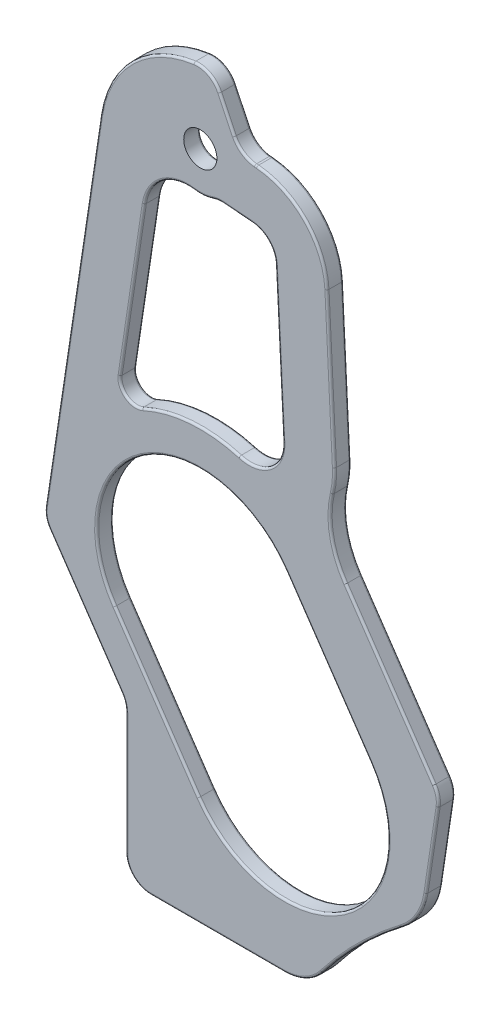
ISO-10303-21;
HEADER;
FILE_DESCRIPTION(('STEP AP214'),'2;1');
FILE_NAME('part.step','',(''),(''),'','','');
FILE_SCHEMA(('AUTOMOTIVE_DESIGN { 1 0 10303 214 1 1 1 1 }'));
ENDSEC;
DATA;
#1=APPLICATION_CONTEXT('core data for automotive mechanical design processes');
#2=APPLICATION_PROTOCOL_DEFINITION('international standard','automotive_design',2000,#1);
#3=PRODUCT_CONTEXT('',#1,'mechanical');
#4=PRODUCT('Part','Part','',(#3));
#5=PRODUCT_RELATED_PRODUCT_CATEGORY('part','',(#4));
#6=PRODUCT_DEFINITION_FORMATION('','',#4);
#7=PRODUCT_DEFINITION_CONTEXT('part definition',#1,'design');
#8=PRODUCT_DEFINITION('design','',#6,#7);
#9=PRODUCT_DEFINITION_SHAPE('','',#8);
#10=(LENGTH_UNIT() NAMED_UNIT(*) SI_UNIT(.MILLI.,.METRE.));
#11=(NAMED_UNIT(*) PLANE_ANGLE_UNIT() SI_UNIT($,.RADIAN.));
#12=(NAMED_UNIT(*) SI_UNIT($,.STERADIAN.) SOLID_ANGLE_UNIT());
#13=UNCERTAINTY_MEASURE_WITH_UNIT(LENGTH_MEASURE(1.E-05),#10,'distance_accuracy_value','');
#14=(GEOMETRIC_REPRESENTATION_CONTEXT(3) GLOBAL_UNCERTAINTY_ASSIGNED_CONTEXT((#13)) GLOBAL_UNIT_ASSIGNED_CONTEXT((#10,
#11,#12)) REPRESENTATION_CONTEXT('',''));
#15=CARTESIAN_POINT('',(0.,0.,0.));
#16=DIRECTION('',(0.,0.,1.));
#17=DIRECTION('',(1.,0.,0.));
#18=AXIS2_PLACEMENT_3D('',#15,#16,#17);
#19=CARTESIAN_POINT('',(14.8756388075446,55.1270465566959,2.));
#20=DIRECTION('',(0.,0.,-1.));
#21=DIRECTION('',(-1.,0.,0.));
#22=AXIS2_PLACEMENT_3D('',#19,#20,#21);
#23=PLANE('',#22);
#24=DIRECTION('',(-0.563248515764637,0.826287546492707,0.));
#25=VECTOR('',#24,1.);
#26=CARTESIAN_POINT('',(17.5581336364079,56.9556003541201,2.));
#27=LINE('',#26,#25);
#28=CARTESIAN_POINT('',(36.9862141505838,28.4545381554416,2.));
#29=VERTEX_POINT('',#28);
#30=CARTESIAN_POINT('',(26.316375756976,44.1072284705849,2.));
#31=VERTEX_POINT('',#30);
#32=EDGE_CURVE('E751',#29,#31,#27,.T.);
#33=ORIENTED_EDGE('',*,*,#32,.T.);
#34=CARTESIAN_POINT('',(35.4738293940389,50.3495132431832,2.));
#35=DIRECTION('',(0.,0.,-1.));
#36=DIRECTION('',(-1.,0.,0.));
#37=AXIS2_PLACEMENT_3D('',#34,#35,#36);
#38=CIRCLE('',#37,11.0826446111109);
#39=CARTESIAN_POINT('',(24.6777741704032,52.8535376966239,2.));
#40=VERTEX_POINT('',#39);
#41=EDGE_CURVE('E755',#31,#40,#38,.T.);
#42=ORIENTED_EDGE('',*,*,#41,.T.);
#43=CARTESIAN_POINT('',(14.8756388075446,55.1270465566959,2.));
#44=DIRECTION('',(0.,0.,-1.));
#45=DIRECTION('',(-1.,0.,0.));
#46=AXIS2_PLACEMENT_3D('',#43,#44,#45);
#47=CIRCLE('',#46,10.0623406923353);
#48=CARTESIAN_POINT('',(24.925539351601,55.6272457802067,2.));
#49=VERTEX_POINT('',#48);
#50=EDGE_CURVE('E753',#40,#49,#47,.F.);
#51=ORIENTED_EDGE('',*,*,#50,.T.);
#52=DIRECTION('',(-0.0497103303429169,0.998763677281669,0.));
#53=VECTOR('',#52,1.);
#54=CARTESIAN_POINT('',(24.9255391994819,55.6272488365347,2.));
#55=LINE('',#54,#53);
#56=CARTESIAN_POINT('',(24.0222189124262,73.7764642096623,1.99999999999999));
#57=VERTEX_POINT('',#56);
#58=EDGE_CURVE('E749',#49,#57,#55,.T.);
#59=ORIENTED_EDGE('',*,*,#58,.T.);
#60=CARTESIAN_POINT('',(15.0446026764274,73.3296343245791,2.));
#61=DIRECTION('',(0.,0.,-1.));
#62=DIRECTION('',(-1.,0.,0.));
#63=AXIS2_PLACEMENT_3D('',#60,#61,#62);
#64=CIRCLE('',#63,8.98872906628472);
#65=CARTESIAN_POINT('',(15.7841011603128,82.287892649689,2.));
#66=VERTEX_POINT('',#65);
#67=EDGE_CURVE('E745',#57,#66,#64,.F.);
#68=ORIENTED_EDGE('',*,*,#67,.T.);
#69=DIRECTION('',(-0.996610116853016,0.0822695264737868,0.));
#70=VECTOR('',#69,1.);
#71=CARTESIAN_POINT('',(17.1087227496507,82.1785459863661,2.));
#72=LINE('',#71,#70);
#73=CARTESIAN_POINT('',(15.5372944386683,82.308266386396,2.));
#74=VERTEX_POINT('',#73);
#75=EDGE_CURVE('E741',#66,#74,#72,.T.);
#76=ORIENTED_EDGE('',*,*,#75,.T.);
#77=CARTESIAN_POINT('',(15.8046703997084,85.5472492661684,2.));
#78=DIRECTION('',(0.,0.,-1.));
#79=DIRECTION('',(-1.,0.,0.));
#80=AXIS2_PLACEMENT_3D('',#77,#78,#79);
#81=CIRCLE('',#80,3.25000000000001);
#82=CARTESIAN_POINT('',(12.876230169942,84.1377323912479,2.));
#83=VERTEX_POINT('',#82);
#84=EDGE_CURVE('E737',#74,#83,#81,.T.);
#85=ORIENTED_EDGE('',*,*,#84,.T.);
#86=DIRECTION('',(-0.433697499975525,0.901058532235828,0.));
#87=VECTOR('',#86,1.);
#88=CARTESIAN_POINT('',(24.5893000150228,59.802426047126,2.));
#89=LINE('',#88,#87);
#90=CARTESIAN_POINT('',(11.1009864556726,87.8260139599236,2.));
#91=VERTEX_POINT('',#90);
#92=EDGE_CURVE('E733',#83,#91,#89,.T.);
#93=ORIENTED_EDGE('',*,*,#92,.T.);
#94=CARTESIAN_POINT('',(8.6230754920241,86.6333458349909,2.));
#95=DIRECTION('',(0.,0.,-1.));
#96=DIRECTION('',(-1.,0.,0.));
#97=AXIS2_PLACEMENT_3D('',#94,#95,#96);
#98=CIRCLE('',#97,2.75000000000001);
#99=CARTESIAN_POINT('',(8.25735540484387,89.3589189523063,2.));
#100=VERTEX_POINT('',#99);
#101=EDGE_CURVE('E729',#91,#100,#98,.F.);
#102=ORIENTED_EDGE('',*,*,#101,.T.);
#103=CARTESIAN_POINT('',(9.9740089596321,76.5653510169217,2.));
#104=DIRECTION('',(0.,0.,-1.));
#105=DIRECTION('',(-1.,0.,0.));
#106=AXIS2_PLACEMENT_3D('',#103,#104,#105);
#107=CIRCLE('',#106,12.9082252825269);
#108=CARTESIAN_POINT('',(-2.79054137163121,78.4859068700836,2.));
#109=VERTEX_POINT('',#108);
#110=EDGE_CURVE('E725',#100,#109,#107,.F.);
#111=ORIENTED_EDGE('',*,*,#110,.T.);
#112=DIRECTION('',(-0.148785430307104,-0.988869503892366,0.));
#113=VECTOR('',#112,1.);
#114=CARTESIAN_POINT('',(-5.83623780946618,58.2433581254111,2.00000000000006));
#115=LINE('',#114,#113);
#116=CARTESIAN_POINT('',(-9.45006341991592,34.2248643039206,2.));
#117=VERTEX_POINT('',#116);
#118=EDGE_CURVE('E721',#109,#117,#115,.T.);
#119=ORIENTED_EDGE('',*,*,#118,.T.);
#120=CARTESIAN_POINT('',(-6.73067228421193,33.815704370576,2.00000000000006));
#121=DIRECTION('',(0.,0.,-1.));
#122=DIRECTION('',(-1.,0.,0.));
#123=AXIS2_PLACEMENT_3D('',#120,#121,#122);
#124=CIRCLE('',#123,2.75);
#125=CARTESIAN_POINT('',(-9.00296303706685,32.2667709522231,2.));
#126=VERTEX_POINT('',#125);
#127=EDGE_CURVE('E717',#117,#126,#124,.F.);
#128=ORIENTED_EDGE('',*,*,#127,.T.);
#129=DIRECTION('',(0.563248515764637,-0.826287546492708,0.));
#130=VECTOR('',#129,1.);
#131=CARTESIAN_POINT('',(-12.0667950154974,36.761423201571,1.99999999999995));
#132=LINE('',#131,#130);
#133=CARTESIAN_POINT('',(-0.314565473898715,19.5208612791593,2.00000000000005));
#134=VERTEX_POINT('',#133);
#135=EDGE_CURVE('E713',#126,#134,#132,.T.);
#136=ORIENTED_EDGE('',*,*,#135,.T.);
#137=CARTESIAN_POINT('',(-3.,17.6903036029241,2.00000000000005));
#138=DIRECTION('',(0.,0.,-1.));
#139=DIRECTION('',(-1.,0.,0.));
#140=AXIS2_PLACEMENT_3D('',#137,#138,#139);
#141=CIRCLE('',#140,3.25);
#142=CARTESIAN_POINT('',(0.25,17.6903036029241,2.));
#143=VERTEX_POINT('',#142);
#144=EDGE_CURVE('E715',#134,#143,#141,.T.);
#145=ORIENTED_EDGE('',*,*,#144,.T.);
#146=DIRECTION('',(0.,-1.,0.));
#147=VECTOR('',#146,1.);
#148=CARTESIAN_POINT('',(0.249999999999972,55.1270465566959,2.00000000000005));
#149=LINE('',#148,#147);
#150=CARTESIAN_POINT('',(0.25,3.00000000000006,2.00000000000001));
#151=VERTEX_POINT('',#150);
#152=EDGE_CURVE('E719',#143,#151,#149,.T.);
#153=ORIENTED_EDGE('',*,*,#152,.T.);
#154=CARTESIAN_POINT('',(3.,3.,2.00000000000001));
#155=DIRECTION('',(0.,0.,-1.));
#156=DIRECTION('',(-1.,0.,0.));
#157=AXIS2_PLACEMENT_3D('',#154,#155,#156);
#158=CIRCLE('',#157,2.75);
#159=CARTESIAN_POINT('',(3.00000000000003,0.249999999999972,2.00000000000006));
#160=VERTEX_POINT('',#159);
#161=EDGE_CURVE('E723',#151,#160,#158,.F.);
#162=ORIENTED_EDGE('',*,*,#161,.T.);
#163=DIRECTION('',(1.,0.,0.));
#164=VECTOR('',#163,1.);
#165=CARTESIAN_POINT('',(14.8756388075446,0.25,2.00000000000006));
#166=LINE('',#165,#164);
#167=CARTESIAN_POINT('',(19.1506031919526,0.249999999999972,2.00000000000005));
#168=VERTEX_POINT('',#167);
#169=EDGE_CURVE('E727',#160,#168,#166,.T.);
#170=ORIENTED_EDGE('',*,*,#169,.T.);
#171=CARTESIAN_POINT('',(19.1506031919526,5.68451189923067,2.));
#172=DIRECTION('',(0.,0.,-1.));
#173=DIRECTION('',(-1.,0.,0.));
#174=AXIS2_PLACEMENT_3D('',#171,#172,#173);
#175=CIRCLE('',#174,5.43451189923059);
#176=CARTESIAN_POINT('',(23.452015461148,2.36310074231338,2.00000000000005));
#177=VERTEX_POINT('',#176);
#178=EDGE_CURVE('E731',#168,#177,#175,.F.);
#179=ORIENTED_EDGE('',*,*,#178,.T.);
#180=CARTESIAN_POINT('',(64.5127813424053,-29.3426920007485,2.));
#181=DIRECTION('',(0.,0.,-1.));
#182=DIRECTION('',(-1.,0.,0.));
#183=AXIS2_PLACEMENT_3D('',#180,#181,#182);
#184=CIRCLE('',#183,51.8771991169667);
#185=CARTESIAN_POINT('',(33.1328614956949,11.9676507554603,2.));
#186=VERTEX_POINT('',#185);
#187=EDGE_CURVE('E735',#177,#186,#184,.T.);
#188=ORIENTED_EDGE('',*,*,#187,.T.);
#189=CARTESIAN_POINT('',(28.6694651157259,17.8435240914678,2.));
#190=DIRECTION('',(0.,0.,-1.));
#191=DIRECTION('',(-1.,0.,0.));
#192=AXIS2_PLACEMENT_3D('',#189,#190,#191);
#193=CIRCLE('',#192,7.37887489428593);
#194=CARTESIAN_POINT('',(35.9662094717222,16.7456550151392,2.));
#195=VERTEX_POINT('',#194);
#196=EDGE_CURVE('E739',#186,#195,#193,.F.);
#197=ORIENTED_EDGE('',*,*,#196,.T.);
#198=DIRECTION('',(0.148785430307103,0.988869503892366,0.));
#199=VECTOR('',#198,1.);
#200=CARTESIAN_POINT('',(41.1463554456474,51.1743512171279,2.));
#201=LINE('',#200,#199);
#202=CARTESIAN_POINT('',(37.4333145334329,26.4964448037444,2.));
#203=VERTEX_POINT('',#202);
#204=EDGE_CURVE('E743',#195,#203,#201,.T.);
#205=ORIENTED_EDGE('',*,*,#204,.T.);
#206=CARTESIAN_POINT('',(34.7139233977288,26.9056047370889,2.));
#207=DIRECTION('',(0.,0.,-1.));
#208=DIRECTION('',(-1.,0.,0.));
#209=AXIS2_PLACEMENT_3D('',#206,#207,#208);
#210=CIRCLE('',#209,2.74999999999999);
#211=EDGE_CURVE('E747',#203,#29,#210,.F.);
#212=ORIENTED_EDGE('',*,*,#211,.T.);
#213=EDGE_LOOP('',(#33,#42,#51,#59,#68,#76,#85,#93,#102,#111,#119,#128,#136,#145,#153,#162,#170,
#179,#188,#197,#205,#212));
#214=FACE_BOUND('',#213,.T.);
#215=DIRECTION('',(-0.563248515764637,0.826287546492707,0.));
#216=VECTOR('',#215,1.);
#217=CARTESIAN_POINT('',(29.6736395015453,27.3082427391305,2.));
#218=LINE('',#217,#216);
#219=CARTESIAN_POINT('',(19.5351662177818,42.1814185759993,2.));
#220=VERTEX_POINT('',#219);
#221=CARTESIAN_POINT('',(29.6736395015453,27.3082427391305,2.));
#222=VERTEX_POINT('',#221);
#223=EDGE_CURVE('E708',#220,#222,#218,.F.);
#224=ORIENTED_EDGE('',*,*,#223,.T.);
#225=CARTESIAN_POINT('',(19.1384732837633,20.1268241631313,2.));
#226=DIRECTION('',(0.,0.,-1.));
#227=DIRECTION('',(-1.,0.,0.));
#228=AXIS2_PLACEMENT_3D('',#225,#226,#227);
#229=CIRCLE('',#228,12.75);
#230=CARTESIAN_POINT('',(8.60330706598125,12.9454055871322,2.));
#231=VERTEX_POINT('',#230);
#232=EDGE_CURVE('E710',#222,#231,#229,.T.);
#233=ORIENTED_EDGE('',*,*,#232,.T.);
#234=DIRECTION('',(0.563248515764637,-0.826287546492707,0.));
#235=VECTOR('',#234,1.);
#236=CARTESIAN_POINT('',(8.60330706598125,12.9454055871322,2.));
#237=LINE('',#236,#235);
#238=CARTESIAN_POINT('',(-1.53516621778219,27.818581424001,2.00000000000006));
#239=VERTEX_POINT('',#238);
#240=EDGE_CURVE('E706',#231,#239,#237,.F.);
#241=ORIENTED_EDGE('',*,*,#240,.T.);
#242=CARTESIAN_POINT('',(8.99999999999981,35.0000000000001,2.00000000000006));
#243=DIRECTION('',(0.,0.,-1.));
#244=DIRECTION('',(-1.,0.,0.));
#245=AXIS2_PLACEMENT_3D('',#242,#243,#244);
#246=CIRCLE('',#245,12.75);
#247=EDGE_CURVE('E704',#239,#220,#246,.T.);
#248=ORIENTED_EDGE('',*,*,#247,.T.);
#249=EDGE_LOOP('',(#224,#233,#241,#248));
#250=FACE_BOUND('',#249,.T.);
#251=DIRECTION('',(-0.148785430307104,-0.988869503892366,0.));
#252=VECTOR('',#251,1.);
#253=CARTESIAN_POINT('',(2.005400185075,71.7905690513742,2.));
#254=LINE('',#253,#252);
#255=CARTESIAN_POINT('',(-0.913295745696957,52.3921011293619,2.00000000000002));
#256=VERTEX_POINT('',#255);
#257=CARTESIAN_POINT('',(2.005400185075,71.7905690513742,2.));
#258=VERTEX_POINT('',#257);
#259=EDGE_CURVE('E699',#256,#258,#254,.F.);
#260=ORIENTED_EDGE('',*,*,#259,.T.);
#261=CARTESIAN_POINT('',(7.53683901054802,70.9583080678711,2.));
#262=DIRECTION('',(0.,0.,-1.));
#263=DIRECTION('',(-1.,0.,0.));
#264=AXIS2_PLACEMENT_3D('',#261,#262,#263);
#265=CIRCLE('',#264,5.59369947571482);
#266=CARTESIAN_POINT('',(8.3473007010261,76.4929829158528,2.));
#267=VERTEX_POINT('',#266);
#268=EDGE_CURVE('E701',#258,#267,#265,.T.);
#269=ORIENTED_EDGE('',*,*,#268,.T.);
#270=CARTESIAN_POINT('',(8.99999999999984,80.9502921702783,2.));
#271=DIRECTION('',(0.,0.,-1.));
#272=DIRECTION('',(-1.,0.,0.));
#273=AXIS2_PLACEMENT_3D('',#270,#271,#272);
#274=CIRCLE('',#273,4.50484429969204);
#275=CARTESIAN_POINT('',(10.46969921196,76.6919349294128,2.));
#276=VERTEX_POINT('',#275);
#277=EDGE_CURVE('E697',#267,#276,#274,.F.);
#278=ORIENTED_EDGE('',*,*,#277,.T.);
#279=CARTESIAN_POINT('',(11.530007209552,73.6197619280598,2.));
#280=DIRECTION('',(0.,0.,-1.));
#281=DIRECTION('',(-1.,0.,0.));
#282=AXIS2_PLACEMENT_3D('',#279,#280,#281);
#283=CIRCLE('',#282,3.25);
#284=CARTESIAN_POINT('',(11.7973831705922,76.858744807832,2.));
#285=VERTEX_POINT('',#284);
#286=EDGE_CURVE('E693',#276,#285,#283,.T.);
#287=ORIENTED_EDGE('',*,*,#286,.T.);
#288=DIRECTION('',(-0.996610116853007,0.0822695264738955,0.));
#289=VECTOR('',#288,1.);
#290=CARTESIAN_POINT('',(15.3119786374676,76.5686172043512,2.));
#291=LINE('',#290,#289);
#292=CARTESIAN_POINT('',(15.3119786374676,76.5686172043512,2.));
#293=VERTEX_POINT('',#292);
#294=EDGE_CURVE('E490',#285,#293,#291,.F.);
#295=ORIENTED_EDGE('',*,*,#294,.T.);
#296=CARTESIAN_POINT('',(15.0446026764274,73.3296343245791,2.));
#297=DIRECTION('',(0.,0.,-1.));
#298=DIRECTION('',(-1.,0.,0.));
#299=AXIS2_PLACEMENT_3D('',#296,#297,#298);
#300=CIRCLE('',#299,3.24999999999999);
#301=CARTESIAN_POINT('',(18.2905846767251,73.491191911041,2.));
#302=VERTEX_POINT('',#301);
#303=EDGE_CURVE('E484',#293,#302,#300,.T.);
#304=ORIENTED_EDGE('',*,*,#303,.T.);
#305=DIRECTION('',(-0.0497103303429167,0.99876367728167,0.));
#306=VECTOR('',#305,1.);
#307=CARTESIAN_POINT('',(18.2905846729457,73.4911919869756,2.));
#308=LINE('',#307,#306);
#309=CARTESIAN_POINT('',(19.1939051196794,55.3419734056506,2.));
#310=VERTEX_POINT('',#309);
#311=EDGE_CURVE('E487',#302,#310,#308,.F.);
#312=ORIENTED_EDGE('',*,*,#311,.T.);
#313=CARTESIAN_POINT('',(14.8756388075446,55.1270465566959,2.));
#314=DIRECTION('',(0.,0.,-1.));
#315=DIRECTION('',(-1.,0.,0.));
#316=AXIS2_PLACEMENT_3D('',#313,#314,#315);
#317=CIRCLE('',#316,4.32361162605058);
#318=CARTESIAN_POINT('',(13.6640298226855,50.9766705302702,2.));
#319=VERTEX_POINT('',#318);
#320=EDGE_CURVE('E495',#310,#319,#317,.T.);
#321=ORIENTED_EDGE('',*,*,#320,.T.);
#322=CARTESIAN_POINT('',(8.99999999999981,35.0000000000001,2.00000000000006));
#323=DIRECTION('',(0.,0.,-1.));
#324=DIRECTION('',(-1.,0.,0.));
#325=AXIS2_PLACEMENT_3D('',#322,#323,#324);
#326=CIRCLE('',#325,16.6435325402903);
#327=CARTESIAN_POINT('',(2.08017201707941,50.1368145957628,2.));
#328=VERTEX_POINT('',#327);
#329=EDGE_CURVE('E691',#319,#328,#326,.F.);
#330=ORIENTED_EDGE('',*,*,#329,.T.);
#331=CARTESIAN_POINT('',(1.19411740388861,52.0750194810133,2.00000000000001));
#332=DIRECTION('',(0.,0.,-1.));
#333=DIRECTION('',(-1.,0.,0.));
#334=AXIS2_PLACEMENT_3D('',#331,#332,#333);
#335=CIRCLE('',#334,2.13113372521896);
#336=EDGE_CURVE('E695',#328,#256,#335,.T.);
#337=ORIENTED_EDGE('',*,*,#336,.T.);
#338=EDGE_LOOP('',(#260,#269,#278,#287,#295,#304,#312,#321,#330,#337));
#339=FACE_BOUND('',#338,.T.);
#340=CARTESIAN_POINT('',(8.99999999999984,80.9502921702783,2.));
#341=DIRECTION('',(0.,0.,1.));
#342=DIRECTION('',(1.,0.,0.));
#343=AXIS2_PLACEMENT_3D('',#340,#341,#342);
#344=CIRCLE('',#343,1.99999999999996);
#345=CARTESIAN_POINT('',(10.9999999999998,80.9502921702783,2.));
#346=VERTEX_POINT('',#345);
#347=EDGE_CURVE('E579',#346,#346,#344,.T.);
#348=ORIENTED_EDGE('',*,*,#347,.F.);
#349=EDGE_LOOP('',(#348));
#350=FACE_BOUND('',#349,.T.);
#351=ADVANCED_FACE('F37',(#214,#250,#339,#350),#23,.F.);
#352=CARTESIAN_POINT('',(14.8756388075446,55.1270465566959,0.));
#353=DIRECTION('',(0.,0.,-1.));
#354=DIRECTION('',(-1.,0.,0.));
#355=AXIS2_PLACEMENT_3D('',#352,#353,#354);
#356=PLANE('',#355);
#357=CARTESIAN_POINT('',(8.99999999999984,80.9502921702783,0.));
#358=DIRECTION('',(0.,0.,-1.));
#359=DIRECTION('',(-1.,0.,0.));
#360=AXIS2_PLACEMENT_3D('',#357,#358,#359);
#361=CIRCLE('',#360,2.24999999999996);
#362=CARTESIAN_POINT('',(6.74999999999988,80.9502921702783,0.));
#363=VERTEX_POINT('',#362);
#364=EDGE_CURVE('E967',#363,#363,#361,.F.);
#365=ORIENTED_EDGE('',*,*,#364,.T.);
#366=EDGE_LOOP('',(#365));
#367=FACE_BOUND('',#366,.T.);
#368=DIRECTION('',(0.563248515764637,-0.826287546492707,0.));
#369=VECTOR('',#368,1.);
#370=CARTESIAN_POINT('',(-9.03835914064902,38.8257917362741,0.));
#371=LINE('',#370,#369);
#372=CARTESIAN_POINT('',(-1.53516621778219,27.818581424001,0.));
#373=VERTEX_POINT('',#372);
#374=CARTESIAN_POINT('',(8.60330706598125,12.9454055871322,0.));
#375=VERTEX_POINT('',#374);
#376=EDGE_CURVE('E52',#373,#375,#371,.T.);
#377=ORIENTED_EDGE('',*,*,#376,.T.);
#378=CARTESIAN_POINT('',(19.1384732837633,20.1268241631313,0.));
#379=DIRECTION('',(0.,0.,-1.));
#380=DIRECTION('',(-1.,0.,0.));
#381=AXIS2_PLACEMENT_3D('',#378,#379,#380);
#382=CIRCLE('',#381,12.75);
#383=CARTESIAN_POINT('',(29.6736395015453,27.3082427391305,0.));
#384=VERTEX_POINT('',#383);
#385=EDGE_CURVE('E965',#375,#384,#382,.F.);
#386=ORIENTED_EDGE('',*,*,#385,.T.);
#387=DIRECTION('',(-0.563248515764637,0.826287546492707,0.));
#388=VECTOR('',#387,1.);
#389=CARTESIAN_POINT('',(12.031973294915,53.1886288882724,0.));
#390=LINE('',#389,#388);
#391=CARTESIAN_POINT('',(19.5351662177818,42.1814185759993,0.));
#392=VERTEX_POINT('',#391);
#393=EDGE_CURVE('E961',#384,#392,#390,.T.);
#394=ORIENTED_EDGE('',*,*,#393,.T.);
#395=CARTESIAN_POINT('',(8.99999999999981,35.0000000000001,0.));
#396=DIRECTION('',(0.,0.,-1.));
#397=DIRECTION('',(-1.,0.,0.));
#398=AXIS2_PLACEMENT_3D('',#395,#396,#397);
#399=CIRCLE('',#398,12.75);
#400=EDGE_CURVE('E57',#392,#373,#399,.F.);
#401=ORIENTED_EDGE('',*,*,#400,.T.);
#402=EDGE_LOOP('',(#377,#386,#394,#401));
#403=FACE_BOUND('',#402,.T.);
#404=CARTESIAN_POINT('',(15.0446026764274,73.3296343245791,0.));
#405=DIRECTION('',(0.,0.,-1.));
#406=DIRECTION('',(-1.,0.,0.));
#407=AXIS2_PLACEMENT_3D('',#404,#405,#406);
#408=CIRCLE('',#407,8.98872906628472);
#409=CARTESIAN_POINT('',(15.7841011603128,82.287892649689,0.));
#410=VERTEX_POINT('',#409);
#411=CARTESIAN_POINT('',(24.0222189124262,73.7764642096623,0.));
#412=VERTEX_POINT('',#411);
#413=EDGE_CURVE('E956',#410,#412,#408,.T.);
#414=ORIENTED_EDGE('',*,*,#413,.T.);
#415=DIRECTION('',(-0.0497103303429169,0.998763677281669,0.));
#416=VECTOR('',#415,1.);
#417=CARTESIAN_POINT('',(24.9255393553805,55.6272457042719,0.));
#418=LINE('',#417,#416);
#419=CARTESIAN_POINT('',(24.9255393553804,55.6272457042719,0.));
#420=VERTEX_POINT('',#419);
#421=EDGE_CURVE('E958',#412,#420,#418,.F.);
#422=ORIENTED_EDGE('',*,*,#421,.T.);
#423=CARTESIAN_POINT('',(14.8756388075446,55.1270465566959,0.));
#424=DIRECTION('',(0.,0.,-1.));
#425=DIRECTION('',(-1.,0.,0.));
#426=AXIS2_PLACEMENT_3D('',#423,#424,#425);
#427=CIRCLE('',#426,10.0623406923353);
#428=CARTESIAN_POINT('',(24.6777741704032,52.8535376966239,0.));
#429=VERTEX_POINT('',#428);
#430=EDGE_CURVE('E916',#420,#429,#427,.T.);
#431=ORIENTED_EDGE('',*,*,#430,.T.);
#432=CARTESIAN_POINT('',(35.4738293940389,50.3495132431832,0.));
#433=DIRECTION('',(0.,0.,-1.));
#434=DIRECTION('',(-1.,0.,0.));
#435=AXIS2_PLACEMENT_3D('',#432,#433,#434);
#436=CIRCLE('',#435,11.0826446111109);
#437=CARTESIAN_POINT('',(26.3163781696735,44.1072301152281,0.));
#438=VERTEX_POINT('',#437);
#439=EDGE_CURVE('E918',#429,#438,#436,.F.);
#440=ORIENTED_EDGE('',*,*,#439,.T.);
#441=DIRECTION('',(-0.563248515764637,0.826287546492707,0.));
#442=VECTOR('',#441,1.);
#443=CARTESIAN_POINT('',(36.9862141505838,28.4545381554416,0.));
#444=LINE('',#443,#442);
#445=CARTESIAN_POINT('',(36.9862141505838,28.4545381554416,0.));
#446=VERTEX_POINT('',#445);
#447=EDGE_CURVE('E920',#438,#446,#444,.F.);
#448=ORIENTED_EDGE('',*,*,#447,.T.);
#449=CARTESIAN_POINT('',(34.7139233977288,26.9056047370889,0.));
#450=DIRECTION('',(0.,0.,-1.));
#451=DIRECTION('',(-1.,0.,0.));
#452=AXIS2_PLACEMENT_3D('',#449,#450,#451);
#453=CIRCLE('',#452,2.74999999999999);
#454=CARTESIAN_POINT('',(37.4333145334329,26.4964448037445,0.));
#455=VERTEX_POINT('',#454);
#456=EDGE_CURVE('E922',#446,#455,#453,.T.);
#457=ORIENTED_EDGE('',*,*,#456,.T.);
#458=DIRECTION('',(0.148785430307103,0.988869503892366,0.));
#459=VECTOR('',#458,1.);
#460=CARTESIAN_POINT('',(37.4333145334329,26.4964448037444,0.));
#461=LINE('',#460,#459);
#462=CARTESIAN_POINT('',(35.9662094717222,16.7456550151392,0.));
#463=VERTEX_POINT('',#462);
#464=EDGE_CURVE('E924',#455,#463,#461,.F.);
#465=ORIENTED_EDGE('',*,*,#464,.T.);
#466=CARTESIAN_POINT('',(28.6694651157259,17.8435240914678,0.));
#467=DIRECTION('',(0.,0.,-1.));
#468=DIRECTION('',(-1.,0.,0.));
#469=AXIS2_PLACEMENT_3D('',#466,#467,#468);
#470=CIRCLE('',#469,7.37887489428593);
#471=CARTESIAN_POINT('',(33.1328614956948,11.9676507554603,0.));
#472=VERTEX_POINT('',#471);
#473=EDGE_CURVE('E926',#463,#472,#470,.T.);
#474=ORIENTED_EDGE('',*,*,#473,.T.);
#475=CARTESIAN_POINT('',(64.5127813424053,-29.3426920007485,0.));
#476=DIRECTION('',(0.,0.,-1.));
#477=DIRECTION('',(-1.,0.,0.));
#478=AXIS2_PLACEMENT_3D('',#475,#476,#477);
#479=CIRCLE('',#478,51.8771991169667);
#480=CARTESIAN_POINT('',(23.452015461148,2.36310074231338,0.));
#481=VERTEX_POINT('',#480);
#482=EDGE_CURVE('E928',#472,#481,#479,.F.);
#483=ORIENTED_EDGE('',*,*,#482,.T.);
#484=CARTESIAN_POINT('',(19.1506031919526,5.68451189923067,0.));
#485=DIRECTION('',(0.,0.,-1.));
#486=DIRECTION('',(-1.,0.,0.));
#487=AXIS2_PLACEMENT_3D('',#484,#485,#486);
#488=CIRCLE('',#487,5.43451189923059);
#489=CARTESIAN_POINT('',(19.1506031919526,0.249999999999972,0.));
#490=VERTEX_POINT('',#489);
#491=EDGE_CURVE('E930',#481,#490,#488,.T.);
#492=ORIENTED_EDGE('',*,*,#491,.T.);
#493=DIRECTION('',(1.,0.,0.));
#494=VECTOR('',#493,1.);
#495=CARTESIAN_POINT('',(19.1506031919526,0.249999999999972,0.));
#496=LINE('',#495,#494);
#497=CARTESIAN_POINT('',(3.,0.249999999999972,0.));
#498=VERTEX_POINT('',#497);
#499=EDGE_CURVE('E932',#490,#498,#496,.F.);
#500=ORIENTED_EDGE('',*,*,#499,.T.);
#501=CARTESIAN_POINT('',(3.,3.,0.));
#502=DIRECTION('',(0.,0.,-1.));
#503=DIRECTION('',(-1.,0.,0.));
#504=AXIS2_PLACEMENT_3D('',#501,#502,#503);
#505=CIRCLE('',#504,2.75);
#506=CARTESIAN_POINT('',(0.25,3.00000000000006,0.));
#507=VERTEX_POINT('',#506);
#508=EDGE_CURVE('E934',#498,#507,#505,.T.);
#509=ORIENTED_EDGE('',*,*,#508,.T.);
#510=DIRECTION('',(0.,-1.,0.));
#511=VECTOR('',#510,1.);
#512=CARTESIAN_POINT('',(0.25,17.6903036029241,0.));
#513=LINE('',#512,#511);
#514=CARTESIAN_POINT('',(0.25,17.6903036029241,0.));
#515=VERTEX_POINT('',#514);
#516=EDGE_CURVE('E936',#507,#515,#513,.F.);
#517=ORIENTED_EDGE('',*,*,#516,.T.);
#518=CARTESIAN_POINT('',(-3.,17.6903036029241,0.));
#519=DIRECTION('',(0.,0.,-1.));
#520=DIRECTION('',(-1.,0.,0.));
#521=AXIS2_PLACEMENT_3D('',#518,#519,#520);
#522=CIRCLE('',#521,3.25);
#523=CARTESIAN_POINT('',(-0.314565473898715,19.5208612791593,0.));
#524=VERTEX_POINT('',#523);
#525=EDGE_CURVE('E938',#515,#524,#522,.F.);
#526=ORIENTED_EDGE('',*,*,#525,.T.);
#527=DIRECTION('',(0.563248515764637,-0.826287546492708,0.));
#528=VECTOR('',#527,1.);
#529=CARTESIAN_POINT('',(-9.00296303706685,32.2667709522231,0.));
#530=LINE('',#529,#528);
#531=CARTESIAN_POINT('',(-9.00296303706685,32.2667709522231,0.));
#532=VERTEX_POINT('',#531);
#533=EDGE_CURVE('E940',#524,#532,#530,.F.);
#534=ORIENTED_EDGE('',*,*,#533,.T.);
#535=CARTESIAN_POINT('',(-6.73067228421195,33.815704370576,0.));
#536=DIRECTION('',(0.,0.,-1.));
#537=DIRECTION('',(-1.,0.,0.));
#538=AXIS2_PLACEMENT_3D('',#535,#536,#537);
#539=CIRCLE('',#538,2.75);
#540=CARTESIAN_POINT('',(-9.45006341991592,34.2248643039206,0.));
#541=VERTEX_POINT('',#540);
#542=EDGE_CURVE('E942',#532,#541,#539,.T.);
#543=ORIENTED_EDGE('',*,*,#542,.T.);
#544=DIRECTION('',(-0.148785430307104,-0.988869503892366,0.));
#545=VECTOR('',#544,1.);
#546=CARTESIAN_POINT('',(-2.79054137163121,78.4859068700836,0.));
#547=LINE('',#546,#545);
#548=CARTESIAN_POINT('',(-2.79054137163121,78.4859068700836,0.));
#549=VERTEX_POINT('',#548);
#550=EDGE_CURVE('E944',#541,#549,#547,.F.);
#551=ORIENTED_EDGE('',*,*,#550,.T.);
#552=CARTESIAN_POINT('',(9.9740089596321,76.5653510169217,0.));
#553=DIRECTION('',(0.,0.,-1.));
#554=DIRECTION('',(-1.,0.,0.));
#555=AXIS2_PLACEMENT_3D('',#552,#553,#554);
#556=CIRCLE('',#555,12.9082252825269);
#557=CARTESIAN_POINT('',(8.25735540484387,89.3589189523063,0.));
#558=VERTEX_POINT('',#557);
#559=EDGE_CURVE('E946',#549,#558,#556,.T.);
#560=ORIENTED_EDGE('',*,*,#559,.T.);
#561=CARTESIAN_POINT('',(8.6230754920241,86.6333458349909,0.));
#562=DIRECTION('',(0.,0.,-1.));
#563=DIRECTION('',(-1.,0.,0.));
#564=AXIS2_PLACEMENT_3D('',#561,#562,#563);
#565=CIRCLE('',#564,2.75000000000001);
#566=CARTESIAN_POINT('',(11.1009864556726,87.8260139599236,0.));
#567=VERTEX_POINT('',#566);
#568=EDGE_CURVE('E948',#558,#567,#565,.T.);
#569=ORIENTED_EDGE('',*,*,#568,.T.);
#570=DIRECTION('',(-0.433697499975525,0.901058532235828,0.));
#571=VECTOR('',#570,1.);
#572=CARTESIAN_POINT('',(12.876230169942,84.1377323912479,0.));
#573=LINE('',#572,#571);
#574=CARTESIAN_POINT('',(12.876230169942,84.1377323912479,0.));
#575=VERTEX_POINT('',#574);
#576=EDGE_CURVE('E950',#567,#575,#573,.F.);
#577=ORIENTED_EDGE('',*,*,#576,.T.);
#578=CARTESIAN_POINT('',(15.8046703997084,85.5472492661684,0.));
#579=DIRECTION('',(0.,0.,-1.));
#580=DIRECTION('',(-1.,0.,0.));
#581=AXIS2_PLACEMENT_3D('',#578,#579,#580);
#582=CIRCLE('',#581,3.25000000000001);
#583=CARTESIAN_POINT('',(15.5372944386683,82.308266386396,0.));
#584=VERTEX_POINT('',#583);
#585=EDGE_CURVE('E952',#575,#584,#582,.F.);
#586=ORIENTED_EDGE('',*,*,#585,.T.);
#587=DIRECTION('',(-0.996610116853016,0.0822695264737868,0.));
#588=VECTOR('',#587,1.);
#589=CARTESIAN_POINT('',(15.7841011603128,82.287892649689,0.));
#590=LINE('',#589,#588);
#591=EDGE_CURVE('E954',#584,#410,#590,.F.);
#592=ORIENTED_EDGE('',*,*,#591,.T.);
#593=EDGE_LOOP('',(#414,#422,#431,#440,#448,#457,#465,#474,#483,#492,#500,#509,#517,#526,#534,
#543,#551,#560,#569,#577,#586,#592));
#594=FACE_BOUND('',#593,.T.);
#595=DIRECTION('',(-0.148785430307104,-0.988869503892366,0.));
#596=VECTOR('',#595,1.);
#597=CARTESIAN_POINT('',(-0.161383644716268,57.3895188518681,0.));
#598=LINE('',#597,#596);
#599=CARTESIAN_POINT('',(2.00540018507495,71.7905690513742,0.));
#600=VERTEX_POINT('',#599);
#601=CARTESIAN_POINT('',(-0.913295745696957,52.3921011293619,0.));
#602=VERTEX_POINT('',#601);
#603=EDGE_CURVE('E911',#600,#602,#598,.T.);
#604=ORIENTED_EDGE('',*,*,#603,.T.);
#605=CARTESIAN_POINT('',(1.19411740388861,52.0750194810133,0.));
#606=DIRECTION('',(0.,0.,-1.));
#607=DIRECTION('',(-1.,0.,0.));
#608=AXIS2_PLACEMENT_3D('',#605,#606,#607);
#609=CIRCLE('',#608,2.13113372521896);
#610=CARTESIAN_POINT('',(2.08017201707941,50.1368145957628,0.));
#611=VERTEX_POINT('',#610);
#612=EDGE_CURVE('E913',#602,#611,#609,.F.);
#613=ORIENTED_EDGE('',*,*,#612,.T.);
#614=CARTESIAN_POINT('',(8.99999999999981,35.0000000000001,0.));
#615=DIRECTION('',(0.,0.,-1.));
#616=DIRECTION('',(-1.,0.,0.));
#617=AXIS2_PLACEMENT_3D('',#614,#615,#616);
#618=CIRCLE('',#617,16.6435325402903);
#619=CARTESIAN_POINT('',(13.6640298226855,50.9766705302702,0.));
#620=VERTEX_POINT('',#619);
#621=EDGE_CURVE('E895',#611,#620,#618,.T.);
#622=ORIENTED_EDGE('',*,*,#621,.T.);
#623=CARTESIAN_POINT('',(14.8756388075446,55.1270465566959,0.));
#624=DIRECTION('',(0.,0.,-1.));
#625=DIRECTION('',(-1.,0.,0.));
#626=AXIS2_PLACEMENT_3D('',#623,#624,#625);
#627=CIRCLE('',#626,4.32361162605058);
#628=CARTESIAN_POINT('',(19.1939051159,55.3419734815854,0.));
#629=VERTEX_POINT('',#628);
#630=EDGE_CURVE('E897',#620,#629,#627,.F.);
#631=ORIENTED_EDGE('',*,*,#630,.T.);
#632=DIRECTION('',(-0.0497103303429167,0.99876367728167,0.));
#633=VECTOR('',#632,1.);
#634=CARTESIAN_POINT('',(19.1939050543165,55.3419747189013,0.));
#635=LINE('',#634,#633);
#636=CARTESIAN_POINT('',(18.2905846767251,73.491191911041,0.));
#637=VERTEX_POINT('',#636);
#638=EDGE_CURVE('E899',#629,#637,#635,.T.);
#639=ORIENTED_EDGE('',*,*,#638,.T.);
#640=CARTESIAN_POINT('',(15.0446026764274,73.3296343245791,0.));
#641=DIRECTION('',(0.,0.,-1.));
#642=DIRECTION('',(-1.,0.,0.));
#643=AXIS2_PLACEMENT_3D('',#640,#641,#642);
#644=CIRCLE('',#643,3.24999999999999);
#645=CARTESIAN_POINT('',(15.3119786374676,76.5686172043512,0.));
#646=VERTEX_POINT('',#645);
#647=EDGE_CURVE('E901',#637,#646,#644,.F.);
#648=ORIENTED_EDGE('',*,*,#647,.T.);
#649=DIRECTION('',(-0.996610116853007,0.0822695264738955,0.));
#650=VECTOR('',#649,1.);
#651=CARTESIAN_POINT('',(16.6366002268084,76.459270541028,0.));
#652=LINE('',#651,#650);
#653=CARTESIAN_POINT('',(11.7973831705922,76.858744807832,0.));
#654=VERTEX_POINT('',#653);
#655=EDGE_CURVE('E903',#646,#654,#652,.T.);
#656=ORIENTED_EDGE('',*,*,#655,.T.);
#657=CARTESIAN_POINT('',(11.530007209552,73.6197619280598,0.));
#658=DIRECTION('',(0.,0.,-1.));
#659=DIRECTION('',(-1.,0.,0.));
#660=AXIS2_PLACEMENT_3D('',#657,#658,#659);
#661=CIRCLE('',#660,3.25);
#662=CARTESIAN_POINT('',(10.46969921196,76.6919349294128,0.));
#663=VERTEX_POINT('',#662);
#664=EDGE_CURVE('E905',#654,#663,#661,.F.);
#665=ORIENTED_EDGE('',*,*,#664,.T.);
#666=CARTESIAN_POINT('',(8.99999999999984,80.9502921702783,0.));
#667=DIRECTION('',(0.,0.,-1.));
#668=DIRECTION('',(-1.,0.,0.));
#669=AXIS2_PLACEMENT_3D('',#666,#667,#668);
#670=CIRCLE('',#669,4.50484429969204);
#671=CARTESIAN_POINT('',(8.3473007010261,76.4929829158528,0.));
#672=VERTEX_POINT('',#671);
#673=EDGE_CURVE('E907',#663,#672,#670,.T.);
#674=ORIENTED_EDGE('',*,*,#673,.T.);
#675=CARTESIAN_POINT('',(7.53683901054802,70.9583080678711,0.));
#676=DIRECTION('',(0.,0.,-1.));
#677=DIRECTION('',(-1.,0.,0.));
#678=AXIS2_PLACEMENT_3D('',#675,#676,#677);
#679=CIRCLE('',#678,5.59369947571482);
#680=EDGE_CURVE('E909',#672,#600,#679,.F.);
#681=ORIENTED_EDGE('',*,*,#680,.T.);
#682=EDGE_LOOP('',(#604,#613,#622,#631,#639,#648,#656,#665,#674,#681));
#683=FACE_BOUND('',#682,.T.);
#684=ADVANCED_FACE('F1154',(#367,#403,#594,#683),#356,.T.);
#685=CARTESIAN_POINT('',(14.8756388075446,55.1270465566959,2.));
#686=DIRECTION('',(0.,0.,-1.));
#687=DIRECTION('',(-1.,0.,0.));
#688=AXIS2_PLACEMENT_3D('',#685,#686,#687);
#689=CYLINDRICAL_SURFACE('',#688,10.3123406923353);
#690=DIRECTION('',(0.,0.,-1.));
#691=VECTOR('',#690,1.);
#692=CARTESIAN_POINT('',(25.1752302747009,55.6396732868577,2.));
#693=LINE('',#692,#691);
#694=CARTESIAN_POINT('',(25.1752302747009,55.6396732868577,1.75));
#695=VERTEX_POINT('',#694);
#696=CARTESIAN_POINT('',(25.1752302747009,55.6396732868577,0.25));
#697=VERTEX_POINT('',#696);
#698=EDGE_CURVE('E506',#695,#697,#693,.T.);
#699=ORIENTED_EDGE('',*,*,#698,.F.);
#700=CARTESIAN_POINT('',(14.8756388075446,55.1270465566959,1.75));
#701=DIRECTION('',(0.,0.,-1.));
#702=DIRECTION('',(-1.,0.,0.));
#703=AXIS2_PLACEMENT_3D('',#700,#701,#702);
#704=CIRCLE('',#703,10.3123406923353);
#705=CARTESIAN_POINT('',(24.9213065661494,52.7970530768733,1.75));
#706=VERTEX_POINT('',#705);
#707=EDGE_CURVE('E765',#695,#706,#704,.T.);
#708=ORIENTED_EDGE('',*,*,#707,.T.);
#709=DIRECTION('',(0.,0.,-1.));
#710=VECTOR('',#709,1.);
#711=CARTESIAN_POINT('',(24.9213065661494,52.7970530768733,2.));
#712=LINE('',#711,#710);
#713=CARTESIAN_POINT('',(24.9213065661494,52.7970530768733,0.25));
#714=VERTEX_POINT('',#713);
#715=EDGE_CURVE('E624',#706,#714,#712,.T.);
#716=ORIENTED_EDGE('',*,*,#715,.T.);
#717=CARTESIAN_POINT('',(14.8756388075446,55.1270465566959,0.250000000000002));
#718=DIRECTION('',(0.,0.,-1.));
#719=DIRECTION('',(-1.,0.,0.));
#720=AXIS2_PLACEMENT_3D('',#717,#718,#719);
#721=CIRCLE('',#720,10.3123406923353);
#722=EDGE_CURVE('E763',#714,#697,#721,.F.);
#723=ORIENTED_EDGE('',*,*,#722,.T.);
#724=EDGE_LOOP('',(#699,#708,#716,#723));
#725=FACE_BOUND('',#724,.T.);
#726=ADVANCED_FACE('F39',(#725),#689,.T.);
#727=CARTESIAN_POINT('',(25.1752302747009,55.6396732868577,2.));
#728=DIRECTION('',(-0.998763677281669,-0.0497103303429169,0.));
#729=DIRECTION('',(0.0497103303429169,-0.998763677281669,0.));
#730=AXIS2_PLACEMENT_3D('',#727,#728,#729);
#731=PLANE('',#730);
#732=DIRECTION('',(0.,0.,-1.));
#733=VECTOR('',#732,1.);
#734=CARTESIAN_POINT('',(24.2719098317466,73.788891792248,1.99999999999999));
#735=LINE('',#734,#733);
#736=CARTESIAN_POINT('',(24.2719098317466,73.788891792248,1.75));
#737=VERTEX_POINT('',#736);
#738=CARTESIAN_POINT('',(24.2719098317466,73.788891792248,0.25));
#739=VERTEX_POINT('',#738);
#740=EDGE_CURVE('E684',#737,#739,#735,.T.);
#741=ORIENTED_EDGE('',*,*,#740,.F.);
#742=DIRECTION('',(-0.0497103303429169,0.998763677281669,0.));
#743=VECTOR('',#742,1.);
#744=CARTESIAN_POINT('',(25.1752302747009,55.6396732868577,1.75));
#745=LINE('',#744,#743);
#746=EDGE_CURVE('E774',#737,#695,#745,.F.);
#747=ORIENTED_EDGE('',*,*,#746,.T.);
#748=ORIENTED_EDGE('',*,*,#698,.T.);
#749=DIRECTION('',(-0.0497103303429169,0.998763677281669,0.));
#750=VECTOR('',#749,1.);
#751=CARTESIAN_POINT('',(25.1752302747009,55.6396732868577,0.25));
#752=LINE('',#751,#750);
#753=EDGE_CURVE('E771',#697,#739,#752,.T.);
#754=ORIENTED_EDGE('',*,*,#753,.T.);
#755=EDGE_LOOP('',(#741,#747,#748,#754));
#756=FACE_BOUND('',#755,.T.);
#757=ADVANCED_FACE('F1328',(#756),#731,.F.);
#758=CARTESIAN_POINT('',(15.0446026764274,73.3296343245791,2.));
#759=DIRECTION('',(0.,0.,-1.));
#760=DIRECTION('',(-1.,0.,0.));
#761=AXIS2_PLACEMENT_3D('',#758,#759,#760);
#762=CYLINDRICAL_SURFACE('',#761,9.23872906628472);
#763=DIRECTION('',(0.,0.,-1.));
#764=VECTOR('',#763,1.);
#765=CARTESIAN_POINT('',(15.8046685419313,82.5370451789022,2.));
#766=LINE('',#765,#764);
#767=CARTESIAN_POINT('',(15.8046685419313,82.5370451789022,1.75));
#768=VERTEX_POINT('',#767);
#769=CARTESIAN_POINT('',(15.8046685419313,82.5370451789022,0.25));
#770=VERTEX_POINT('',#769);
#771=EDGE_CURVE('E681',#768,#770,#766,.T.);
#772=ORIENTED_EDGE('',*,*,#771,.F.);
#773=CARTESIAN_POINT('',(15.0446026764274,73.3296343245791,1.75));
#774=DIRECTION('',(0.,0.,-1.));
#775=DIRECTION('',(-1.,0.,0.));
#776=AXIS2_PLACEMENT_3D('',#773,#774,#775);
#777=CIRCLE('',#776,9.23872906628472);
#778=EDGE_CURVE('E782',#768,#737,#777,.T.);
#779=ORIENTED_EDGE('',*,*,#778,.T.);
#780=ORIENTED_EDGE('',*,*,#740,.T.);
#781=CARTESIAN_POINT('',(15.0446026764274,73.3296343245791,0.25));
#782=DIRECTION('',(0.,0.,-1.));
#783=DIRECTION('',(-1.,0.,0.));
#784=AXIS2_PLACEMENT_3D('',#781,#782,#783);
#785=CIRCLE('',#784,9.23872906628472);
#786=EDGE_CURVE('E780',#739,#770,#785,.F.);
#787=ORIENTED_EDGE('',*,*,#786,.T.);
#788=EDGE_LOOP('',(#772,#779,#780,#787));
#789=FACE_BOUND('',#788,.T.);
#790=ADVANCED_FACE('F1325',(#789),#762,.T.);
#791=CARTESIAN_POINT('',(15.8046685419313,82.5370451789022,2.));
#792=DIRECTION('',(-0.0822695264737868,-0.996610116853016,0.));
#793=DIRECTION('',(0.996610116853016,-0.0822695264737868,0.));
#794=AXIS2_PLACEMENT_3D('',#791,#792,#793);
#795=PLANE('',#794);
#796=DIRECTION('',(0.,0.,-1.));
#797=VECTOR('',#796,1.);
#798=CARTESIAN_POINT('',(15.5578618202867,82.5574189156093,2.));
#799=LINE('',#798,#797);
#800=CARTESIAN_POINT('',(15.5578618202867,82.5574189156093,1.75));
#801=VERTEX_POINT('',#800);
#802=CARTESIAN_POINT('',(15.5578618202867,82.5574189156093,0.25));
#803=VERTEX_POINT('',#802);
#804=EDGE_CURVE('E678',#801,#803,#799,.T.);
#805=ORIENTED_EDGE('',*,*,#804,.F.);
#806=DIRECTION('',(-0.996610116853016,0.0822695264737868,0.));
#807=VECTOR('',#806,1.);
#808=CARTESIAN_POINT('',(15.8046685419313,82.5370451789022,1.75));
#809=LINE('',#808,#807);
#810=EDGE_CURVE('E790',#801,#768,#809,.F.);
#811=ORIENTED_EDGE('',*,*,#810,.T.);
#812=ORIENTED_EDGE('',*,*,#771,.T.);
#813=DIRECTION('',(-0.996610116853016,0.0822695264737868,0.));
#814=VECTOR('',#813,1.);
#815=CARTESIAN_POINT('',(15.8046685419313,82.5370451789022,0.25));
#816=LINE('',#815,#814);
#817=EDGE_CURVE('E788',#770,#803,#816,.T.);
#818=ORIENTED_EDGE('',*,*,#817,.T.);
#819=EDGE_LOOP('',(#805,#811,#812,#818));
#820=FACE_BOUND('',#819,.T.);
#821=ADVANCED_FACE('F1321',(#820),#795,.F.);
#822=CARTESIAN_POINT('',(15.8046703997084,85.5472492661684,2.));
#823=DIRECTION('',(0.,0.,-1.));
#824=DIRECTION('',(-1.,0.,0.));
#825=AXIS2_PLACEMENT_3D('',#822,#823,#824);
#826=CYLINDRICAL_SURFACE('',#825,3.00000000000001);
#827=DIRECTION('',(0.,0.,-1.));
#828=VECTOR('',#827,1.);
#829=CARTESIAN_POINT('',(13.1014948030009,84.2461567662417,2.));
#830=LINE('',#829,#828);
#831=CARTESIAN_POINT('',(13.1014948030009,84.2461567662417,1.75));
#832=VERTEX_POINT('',#831);
#833=CARTESIAN_POINT('',(13.1014948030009,84.2461567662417,0.25));
#834=VERTEX_POINT('',#833);
#835=EDGE_CURVE('E675',#832,#834,#830,.T.);
#836=ORIENTED_EDGE('',*,*,#835,.F.);
#837=CARTESIAN_POINT('',(15.8046703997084,85.5472492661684,1.75));
#838=DIRECTION('',(0.,0.,-1.));
#839=DIRECTION('',(-1.,0.,0.));
#840=AXIS2_PLACEMENT_3D('',#837,#838,#839);
#841=CIRCLE('',#840,3.00000000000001);
#842=EDGE_CURVE('E798',#832,#801,#841,.F.);
#843=ORIENTED_EDGE('',*,*,#842,.T.);
#844=ORIENTED_EDGE('',*,*,#804,.T.);
#845=CARTESIAN_POINT('',(15.8046703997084,85.5472492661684,0.25));
#846=DIRECTION('',(0.,0.,-1.));
#847=DIRECTION('',(-1.,0.,0.));
#848=AXIS2_PLACEMENT_3D('',#845,#846,#847);
#849=CIRCLE('',#848,3.00000000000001);
#850=EDGE_CURVE('E796',#803,#834,#849,.T.);
#851=ORIENTED_EDGE('',*,*,#850,.T.);
#852=EDGE_LOOP('',(#836,#843,#844,#851));
#853=FACE_BOUND('',#852,.T.);
#854=ADVANCED_FACE('F1317',(#853),#826,.F.);
#855=CARTESIAN_POINT('',(13.1014948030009,84.2461567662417,2.));
#856=DIRECTION('',(-0.901058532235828,-0.433697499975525,0.));
#857=DIRECTION('',(0.433697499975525,-0.901058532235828,0.));
#858=AXIS2_PLACEMENT_3D('',#855,#856,#857);
#859=PLANE('',#858);
#860=DIRECTION('',(0.,0.,-1.));
#861=VECTOR('',#860,1.);
#862=CARTESIAN_POINT('',(11.3262510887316,87.9344383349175,2.));
#863=LINE('',#862,#861);
#864=CARTESIAN_POINT('',(11.3262510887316,87.9344383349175,1.75));
#865=VERTEX_POINT('',#864);
#866=CARTESIAN_POINT('',(11.3262510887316,87.9344383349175,0.25));
#867=VERTEX_POINT('',#866);
#868=EDGE_CURVE('E672',#865,#867,#863,.T.);
#869=ORIENTED_EDGE('',*,*,#868,.F.);
#870=DIRECTION('',(-0.433697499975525,0.901058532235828,0.));
#871=VECTOR('',#870,1.);
#872=CARTESIAN_POINT('',(13.1014948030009,84.2461567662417,1.75));
#873=LINE('',#872,#871);
#874=EDGE_CURVE('E806',#865,#832,#873,.F.);
#875=ORIENTED_EDGE('',*,*,#874,.T.);
#876=ORIENTED_EDGE('',*,*,#835,.T.);
#877=DIRECTION('',(-0.433697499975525,0.901058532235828,0.));
#878=VECTOR('',#877,1.);
#879=CARTESIAN_POINT('',(13.1014948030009,84.2461567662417,0.25));
#880=LINE('',#879,#878);
#881=EDGE_CURVE('E804',#834,#867,#880,.T.);
#882=ORIENTED_EDGE('',*,*,#881,.T.);
#883=EDGE_LOOP('',(#869,#875,#876,#882));
#884=FACE_BOUND('',#883,.T.);
#885=ADVANCED_FACE('F1313',(#884),#859,.F.);
#886=CARTESIAN_POINT('',(8.6230754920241,86.6333458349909,2.));
#887=DIRECTION('',(0.,0.,-1.));
#888=DIRECTION('',(-1.,0.,0.));
#889=AXIS2_PLACEMENT_3D('',#886,#887,#888);
#890=CYLINDRICAL_SURFACE('',#889,3.00000000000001);
#891=DIRECTION('',(0.,0.,-1.));
#892=VECTOR('',#891,1.);
#893=CARTESIAN_POINT('',(8.22410812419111,89.6066983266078,2.));
#894=LINE('',#893,#892);
#895=CARTESIAN_POINT('',(8.22410812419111,89.6066983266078,1.75));
#896=VERTEX_POINT('',#895);
#897=CARTESIAN_POINT('',(8.22410812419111,89.6066983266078,0.25));
#898=VERTEX_POINT('',#897);
#899=EDGE_CURVE('E669',#896,#898,#894,.T.);
#900=ORIENTED_EDGE('',*,*,#899,.F.);
#901=CARTESIAN_POINT('',(8.6230754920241,86.6333458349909,1.75));
#902=DIRECTION('',(0.,0.,-1.));
#903=DIRECTION('',(-1.,0.,0.));
#904=AXIS2_PLACEMENT_3D('',#901,#902,#903);
#905=CIRCLE('',#904,3.00000000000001);
#906=EDGE_CURVE('E819',#896,#865,#905,.T.);
#907=ORIENTED_EDGE('',*,*,#906,.T.);
#908=ORIENTED_EDGE('',*,*,#868,.T.);
#909=CARTESIAN_POINT('',(8.6230754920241,86.6333458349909,0.25));
#910=DIRECTION('',(0.,0.,-1.));
#911=DIRECTION('',(-1.,0.,0.));
#912=AXIS2_PLACEMENT_3D('',#909,#910,#911);
#913=CIRCLE('',#912,3.00000000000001);
#914=EDGE_CURVE('E817',#867,#898,#913,.F.);
#915=ORIENTED_EDGE('',*,*,#914,.T.);
#916=EDGE_LOOP('',(#900,#907,#908,#915));
#917=FACE_BOUND('',#916,.T.);
#918=ADVANCED_FACE('F1309',(#917),#890,.T.);
#919=CARTESIAN_POINT('',(9.9740089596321,76.5653510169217,2.));
#920=DIRECTION('',(0.,0.,-1.));
#921=DIRECTION('',(-1.,0.,0.));
#922=AXIS2_PLACEMENT_3D('',#919,#920,#921);
#923=CYLINDRICAL_SURFACE('',#922,13.1582252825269);
#924=DIRECTION('',(0.,0.,-1.));
#925=VECTOR('',#924,1.);
#926=CARTESIAN_POINT('',(-3.03775874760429,78.5231032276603,2.));
#927=LINE('',#926,#925);
#928=CARTESIAN_POINT('',(-3.03775874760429,78.5231032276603,1.75));
#929=VERTEX_POINT('',#928);
#930=CARTESIAN_POINT('',(-3.03775874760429,78.5231032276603,0.250000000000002));
#931=VERTEX_POINT('',#930);
#932=EDGE_CURVE('E666',#929,#931,#927,.T.);
#933=ORIENTED_EDGE('',*,*,#932,.F.);
#934=CARTESIAN_POINT('',(9.9740089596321,76.5653510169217,1.75));
#935=DIRECTION('',(0.,0.,-1.));
#936=DIRECTION('',(-1.,0.,0.));
#937=AXIS2_PLACEMENT_3D('',#934,#935,#936);
#938=CIRCLE('',#937,13.1582252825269);
#939=EDGE_CURVE('E835',#929,#896,#938,.T.);
#940=ORIENTED_EDGE('',*,*,#939,.T.);
#941=ORIENTED_EDGE('',*,*,#899,.T.);
#942=CARTESIAN_POINT('',(9.9740089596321,76.5653510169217,0.25));
#943=DIRECTION('',(0.,0.,-1.));
#944=DIRECTION('',(-1.,0.,0.));
#945=AXIS2_PLACEMENT_3D('',#942,#943,#944);
#946=CIRCLE('',#945,13.1582252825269);
#947=EDGE_CURVE('E833',#898,#931,#946,.F.);
#948=ORIENTED_EDGE('',*,*,#947,.T.);
#949=EDGE_LOOP('',(#933,#940,#941,#948));
#950=FACE_BOUND('',#949,.T.);
#951=ADVANCED_FACE('F1305',(#950),#923,.T.);
#952=CARTESIAN_POINT('',(-3.03775874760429,78.5231032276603,2.));
#953=DIRECTION('',(0.988869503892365,-0.148785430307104,0.));
#954=DIRECTION('',(0.148785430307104,0.988869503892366,0.));
#955=AXIS2_PLACEMENT_3D('',#952,#953,#954);
#956=PLANE('',#955);
#957=DIRECTION('',(0.,0.,-1.));
#958=VECTOR('',#957,1.);
#959=CARTESIAN_POINT('',(-9.69728079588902,34.2620606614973,2.));
#960=LINE('',#959,#958);
#961=CARTESIAN_POINT('',(-9.69728079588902,34.2620606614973,1.75));
#962=VERTEX_POINT('',#961);
#963=CARTESIAN_POINT('',(-9.69728079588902,34.2620606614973,0.25));
#964=VERTEX_POINT('',#963);
#965=EDGE_CURVE('E663',#962,#964,#960,.T.);
#966=ORIENTED_EDGE('',*,*,#965,.F.);
#967=DIRECTION('',(-0.148785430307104,-0.988869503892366,0.));
#968=VECTOR('',#967,1.);
#969=CARTESIAN_POINT('',(-3.03775874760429,78.5231032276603,1.75));
#970=LINE('',#969,#968);
#971=EDGE_CURVE('E852',#962,#929,#970,.F.);
#972=ORIENTED_EDGE('',*,*,#971,.T.);
#973=ORIENTED_EDGE('',*,*,#932,.T.);
#974=DIRECTION('',(-0.148785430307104,-0.988869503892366,0.));
#975=VECTOR('',#974,1.);
#976=CARTESIAN_POINT('',(-3.03775874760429,78.5231032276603,0.250000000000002));
#977=LINE('',#976,#975);
#978=EDGE_CURVE('E850',#931,#964,#977,.T.);
#979=ORIENTED_EDGE('',*,*,#978,.T.);
#980=EDGE_LOOP('',(#966,#972,#973,#979));
#981=FACE_BOUND('',#980,.T.);
#982=ADVANCED_FACE('F1301',(#981),#956,.F.);
#983=CARTESIAN_POINT('',(-6.73067228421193,33.815704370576,2.00000000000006));
#984=DIRECTION('',(0.,0.,-1.));
#985=DIRECTION('',(-1.,0.,0.));
#986=AXIS2_PLACEMENT_3D('',#983,#984,#985);
#987=CYLINDRICAL_SURFACE('',#986,3.);
#988=DIRECTION('',(0.,0.,-1.));
#989=VECTOR('',#988,1.);
#990=CARTESIAN_POINT('',(-9.20953492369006,32.1259588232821,2.));
#991=LINE('',#990,#989);
#992=CARTESIAN_POINT('',(-9.20953492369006,32.1259588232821,1.75));
#993=VERTEX_POINT('',#992);
#994=CARTESIAN_POINT('',(-9.20953492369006,32.1259588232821,0.25));
#995=VERTEX_POINT('',#994);
#996=EDGE_CURVE('E660',#993,#995,#991,.T.);
#997=ORIENTED_EDGE('',*,*,#996,.F.);
#998=CARTESIAN_POINT('',(-6.73067228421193,33.815704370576,1.75000000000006));
#999=DIRECTION('',(0.,0.,-1.));
#1000=DIRECTION('',(-1.,0.,0.));
#1001=AXIS2_PLACEMENT_3D('',#998,#999,#1000);
#1002=CIRCLE('',#1001,3.);
#1003=EDGE_CURVE('E874',#993,#962,#1002,.T.);
#1004=ORIENTED_EDGE('',*,*,#1003,.T.);
#1005=ORIENTED_EDGE('',*,*,#965,.T.);
#1006=CARTESIAN_POINT('',(-6.73067228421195,33.815704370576,0.250000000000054));
#1007=DIRECTION('',(0.,0.,-1.));
#1008=DIRECTION('',(-1.,0.,0.));
#1009=AXIS2_PLACEMENT_3D('',#1006,#1007,#1008);
#1010=CIRCLE('',#1009,3.);
#1011=EDGE_CURVE('E872',#964,#995,#1010,.F.);
#1012=ORIENTED_EDGE('',*,*,#1011,.T.);
#1013=EDGE_LOOP('',(#997,#1004,#1005,#1012));
#1014=FACE_BOUND('',#1013,.T.);
#1015=ADVANCED_FACE('F1297',(#1014),#987,.T.);
#1016=CARTESIAN_POINT('',(-9.20953492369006,32.1259588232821,2.));
#1017=DIRECTION('',(0.826287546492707,0.563248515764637,0.));
#1018=DIRECTION('',(-0.563248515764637,0.826287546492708,0.));
#1019=AXIS2_PLACEMENT_3D('',#1016,#1017,#1018);
#1020=PLANE('',#1019);
#1021=ORIENTED_EDGE('',*,*,#996,.T.);
#1022=DIRECTION('',(0.563248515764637,-0.826287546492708,0.));
#1023=VECTOR('',#1022,1.);
#1024=CARTESIAN_POINT('',(-9.20953492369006,32.1259588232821,0.25));
#1025=LINE('',#1024,#1023);
#1026=CARTESIAN_POINT('',(-0.521137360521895,19.380049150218,0.250000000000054));
#1027=VERTEX_POINT('',#1026);
#1028=EDGE_CURVE('E979',#995,#1027,#1025,.T.);
#1029=ORIENTED_EDGE('',*,*,#1028,.T.);
#1030=DIRECTION('',(0.,0.,-1.));
#1031=VECTOR('',#1030,1.);
#1032=CARTESIAN_POINT('',(-0.521137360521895,19.380049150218,2.00000000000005));
#1033=LINE('',#1032,#1031);
#1034=CARTESIAN_POINT('',(-0.521137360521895,19.380049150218,1.75000000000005));
#1035=VERTEX_POINT('',#1034);
#1036=EDGE_CURVE('E657',#1035,#1027,#1033,.T.);
#1037=ORIENTED_EDGE('',*,*,#1036,.F.);
#1038=DIRECTION('',(0.563248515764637,-0.826287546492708,0.));
#1039=VECTOR('',#1038,1.);
#1040=CARTESIAN_POINT('',(-9.20953492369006,32.1259588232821,1.75));
#1041=LINE('',#1040,#1039);
#1042=EDGE_CURVE('E977',#1035,#993,#1041,.F.);
#1043=ORIENTED_EDGE('',*,*,#1042,.T.);
#1044=EDGE_LOOP('',(#1021,#1029,#1037,#1043));
#1045=FACE_BOUND('',#1044,.T.);
#1046=ADVANCED_FACE('F1293',(#1045),#1020,.F.);
#1047=CARTESIAN_POINT('',(-3.,17.6903036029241,2.00000000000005));
#1048=DIRECTION('',(0.,0.,-1.));
#1049=DIRECTION('',(-1.,0.,0.));
#1050=AXIS2_PLACEMENT_3D('',#1047,#1048,#1049);
#1051=CYLINDRICAL_SURFACE('',#1050,3.);
#1052=DIRECTION('',(0.,0.,-1.));
#1053=VECTOR('',#1052,1.);
#1054=CARTESIAN_POINT('',(0.,17.690303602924,2.));
#1055=LINE('',#1054,#1053);
#1056=CARTESIAN_POINT('',(0.,17.690303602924,1.75000000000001));
#1057=VERTEX_POINT('',#1056);
#1058=CARTESIAN_POINT('',(0.,17.690303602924,0.250000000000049));
#1059=VERTEX_POINT('',#1058);
#1060=EDGE_CURVE('E654',#1057,#1059,#1055,.T.);
#1061=ORIENTED_EDGE('',*,*,#1060,.F.);
#1062=CARTESIAN_POINT('',(-3.,17.6903036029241,1.75000000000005));
#1063=DIRECTION('',(0.,0.,-1.));
#1064=DIRECTION('',(-1.,0.,0.));
#1065=AXIS2_PLACEMENT_3D('',#1062,#1063,#1064);
#1066=CIRCLE('',#1065,3.);
#1067=EDGE_CURVE('E878',#1057,#1035,#1066,.F.);
#1068=ORIENTED_EDGE('',*,*,#1067,.T.);
#1069=ORIENTED_EDGE('',*,*,#1036,.T.);
#1070=CARTESIAN_POINT('',(-3.,17.6903036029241,0.250000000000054));
#1071=DIRECTION('',(0.,0.,-1.));
#1072=DIRECTION('',(-1.,0.,0.));
#1073=AXIS2_PLACEMENT_3D('',#1070,#1071,#1072);
#1074=CIRCLE('',#1073,3.);
#1075=EDGE_CURVE('E876',#1027,#1059,#1074,.T.);
#1076=ORIENTED_EDGE('',*,*,#1075,.T.);
#1077=EDGE_LOOP('',(#1061,#1068,#1069,#1076));
#1078=FACE_BOUND('',#1077,.T.);
#1079=ADVANCED_FACE('F1289',(#1078),#1051,.F.);
#1080=CARTESIAN_POINT('',(0.,17.690303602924,2.));
#1081=DIRECTION('',(1.,0.,0.));
#1082=DIRECTION('',(0.,1.,0.));
#1083=AXIS2_PLACEMENT_3D('',#1080,#1081,#1082);
#1084=PLANE('',#1083);
#1085=DIRECTION('',(0.,0.,-1.));
#1086=VECTOR('',#1085,1.);
#1087=CARTESIAN_POINT('',(0.,3.,2.00000000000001));
#1088=LINE('',#1087,#1086);
#1089=CARTESIAN_POINT('',(0.,3.,1.75000000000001));
#1090=VERTEX_POINT('',#1089);
#1091=CARTESIAN_POINT('',(0.,3.,0.250000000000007));
#1092=VERTEX_POINT('',#1091);
#1093=EDGE_CURVE('E651',#1090,#1092,#1088,.T.);
#1094=ORIENTED_EDGE('',*,*,#1093,.F.);
#1095=DIRECTION('',(0.,-1.,0.));
#1096=VECTOR('',#1095,1.);
#1097=CARTESIAN_POINT('',(0.,17.690303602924,1.75000000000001));
#1098=LINE('',#1097,#1096);
#1099=EDGE_CURVE('E856',#1090,#1057,#1098,.F.);
#1100=ORIENTED_EDGE('',*,*,#1099,.T.);
#1101=ORIENTED_EDGE('',*,*,#1060,.T.);
#1102=DIRECTION('',(0.,-1.,0.));
#1103=VECTOR('',#1102,1.);
#1104=CARTESIAN_POINT('',(0.,17.690303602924,0.250000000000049));
#1105=LINE('',#1104,#1103);
#1106=EDGE_CURVE('E854',#1059,#1092,#1105,.T.);
#1107=ORIENTED_EDGE('',*,*,#1106,.T.);
#1108=EDGE_LOOP('',(#1094,#1100,#1101,#1107));
#1109=FACE_BOUND('',#1108,.T.);
#1110=ADVANCED_FACE('F1285',(#1109),#1084,.F.);
#1111=CARTESIAN_POINT('',(3.,3.,2.00000000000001));
#1112=DIRECTION('',(0.,0.,-1.));
#1113=DIRECTION('',(-1.,0.,0.));
#1114=AXIS2_PLACEMENT_3D('',#1111,#1112,#1113);
#1115=CYLINDRICAL_SURFACE('',#1114,3.);
#1116=DIRECTION('',(0.,0.,-1.));
#1117=VECTOR('',#1116,1.);
#1118=CARTESIAN_POINT('',(3.,0.,2.00000000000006));
#1119=LINE('',#1118,#1117);
#1120=CARTESIAN_POINT('',(3.,0.,1.75000000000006));
#1121=VERTEX_POINT('',#1120);
#1122=CARTESIAN_POINT('',(3.,0.,0.250000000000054));
#1123=VERTEX_POINT('',#1122);
#1124=EDGE_CURVE('E648',#1121,#1123,#1119,.T.);
#1125=ORIENTED_EDGE('',*,*,#1124,.F.);
#1126=CARTESIAN_POINT('',(3.,3.,1.75000000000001));
#1127=DIRECTION('',(0.,0.,-1.));
#1128=DIRECTION('',(-1.,0.,0.));
#1129=AXIS2_PLACEMENT_3D('',#1126,#1127,#1128);
#1130=CIRCLE('',#1129,3.);
#1131=EDGE_CURVE('E839',#1121,#1090,#1130,.T.);
#1132=ORIENTED_EDGE('',*,*,#1131,.T.);
#1133=ORIENTED_EDGE('',*,*,#1093,.T.);
#1134=CARTESIAN_POINT('',(3.,3.,0.250000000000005));
#1135=DIRECTION('',(0.,0.,-1.));
#1136=DIRECTION('',(-1.,0.,0.));
#1137=AXIS2_PLACEMENT_3D('',#1134,#1135,#1136);
#1138=CIRCLE('',#1137,3.);
#1139=EDGE_CURVE('E837',#1092,#1123,#1138,.F.);
#1140=ORIENTED_EDGE('',*,*,#1139,.T.);
#1141=EDGE_LOOP('',(#1125,#1132,#1133,#1140));
#1142=FACE_BOUND('',#1141,.T.);
#1143=ADVANCED_FACE('F1281',(#1142),#1115,.T.);
#1144=CARTESIAN_POINT('',(19.1506031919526,0.,2.00000000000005));
#1145=DIRECTION('',(0.,1.,0.));
#1146=DIRECTION('',(-1.,0.,0.));
#1147=AXIS2_PLACEMENT_3D('',#1144,#1145,#1146);
#1148=PLANE('',#1147);
#1149=DIRECTION('',(0.,0.,-1.));
#1150=VECTOR('',#1149,1.);
#1151=CARTESIAN_POINT('',(19.1506031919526,0.,2.00000000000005));
#1152=LINE('',#1151,#1150);
#1153=CARTESIAN_POINT('',(19.1506031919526,0.,1.75000000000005));
#1154=VERTEX_POINT('',#1153);
#1155=CARTESIAN_POINT('',(19.1506031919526,0.,0.250000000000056));
#1156=VERTEX_POINT('',#1155);
#1157=EDGE_CURVE('E645',#1154,#1156,#1152,.T.);
#1158=ORIENTED_EDGE('',*,*,#1157,.F.);
#1159=DIRECTION('',(1.,0.,0.));
#1160=VECTOR('',#1159,1.);
#1161=CARTESIAN_POINT('',(19.1506031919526,0.,1.75000000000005));
#1162=LINE('',#1161,#1160);
#1163=EDGE_CURVE('E823',#1154,#1121,#1162,.F.);
#1164=ORIENTED_EDGE('',*,*,#1163,.T.);
#1165=ORIENTED_EDGE('',*,*,#1124,.T.);
#1166=DIRECTION('',(1.,0.,0.));
#1167=VECTOR('',#1166,1.);
#1168=CARTESIAN_POINT('',(19.1506031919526,0.,0.250000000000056));
#1169=LINE('',#1168,#1167);
#1170=EDGE_CURVE('E821',#1123,#1156,#1169,.T.);
#1171=ORIENTED_EDGE('',*,*,#1170,.T.);
#1172=EDGE_LOOP('',(#1158,#1164,#1165,#1171));
#1173=FACE_BOUND('',#1172,.T.);
#1174=ADVANCED_FACE('F1277',(#1173),#1148,.F.);
#1175=CARTESIAN_POINT('',(19.1506031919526,5.68451189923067,2.));
#1176=DIRECTION('',(0.,0.,-1.));
#1177=DIRECTION('',(-1.,0.,0.));
#1178=AXIS2_PLACEMENT_3D('',#1175,#1176,#1177);
#1179=CYLINDRICAL_SURFACE('',#1178,5.68451189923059);
#1180=DIRECTION('',(0.,0.,-1.));
#1181=VECTOR('',#1180,1.);
#1182=CARTESIAN_POINT('',(23.6498902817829,2.21030821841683,2.00000000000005));
#1183=LINE('',#1182,#1181);
#1184=CARTESIAN_POINT('',(23.6498902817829,2.21030821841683,1.75000000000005));
#1185=VERTEX_POINT('',#1184);
#1186=CARTESIAN_POINT('',(23.6498902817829,2.21030821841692,0.250000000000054));
#1187=VERTEX_POINT('',#1186);
#1188=EDGE_CURVE('E642',#1185,#1187,#1183,.T.);
#1189=ORIENTED_EDGE('',*,*,#1188,.F.);
#1190=CARTESIAN_POINT('',(19.1506031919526,5.68451189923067,1.75));
#1191=DIRECTION('',(0.,0.,-1.));
#1192=DIRECTION('',(-1.,0.,0.));
#1193=AXIS2_PLACEMENT_3D('',#1190,#1191,#1192);
#1194=CIRCLE('',#1193,5.68451189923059);
#1195=EDGE_CURVE('E810',#1185,#1154,#1194,.T.);
#1196=ORIENTED_EDGE('',*,*,#1195,.T.);
#1197=ORIENTED_EDGE('',*,*,#1157,.T.);
#1198=CARTESIAN_POINT('',(19.1506031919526,5.68451189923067,0.249999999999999));
#1199=DIRECTION('',(0.,0.,-1.));
#1200=DIRECTION('',(-1.,0.,0.));
#1201=AXIS2_PLACEMENT_3D('',#1198,#1199,#1200);
#1202=CIRCLE('',#1201,5.68451189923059);
#1203=EDGE_CURVE('E808',#1156,#1187,#1202,.F.);
#1204=ORIENTED_EDGE('',*,*,#1203,.T.);
#1205=EDGE_LOOP('',(#1189,#1196,#1197,#1204));
#1206=FACE_BOUND('',#1205,.T.);
#1207=ADVANCED_FACE('F1273',(#1206),#1179,.T.);
#1208=CARTESIAN_POINT('',(64.5127813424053,-29.3426920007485,2.));
#1209=DIRECTION('',(0.,0.,-1.));
#1210=DIRECTION('',(-1.,0.,0.));
#1211=AXIS2_PLACEMENT_3D('',#1208,#1209,#1210);
#1212=CYLINDRICAL_SURFACE('',#1211,51.6271991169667);
#1213=DIRECTION('',(0.,0.,-1.));
#1214=VECTOR('',#1213,1.);
#1215=CARTESIAN_POINT('',(33.2840836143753,11.7685732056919,2.));
#1216=LINE('',#1215,#1214);
#1217=CARTESIAN_POINT('',(33.2840836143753,11.7685732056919,1.75));
#1218=VERTEX_POINT('',#1217);
#1219=CARTESIAN_POINT('',(33.2840836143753,11.7685732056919,0.249999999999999));
#1220=VERTEX_POINT('',#1219);
#1221=EDGE_CURVE('E639',#1218,#1220,#1216,.T.);
#1222=ORIENTED_EDGE('',*,*,#1221,.F.);
#1223=CARTESIAN_POINT('',(64.5127813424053,-29.3426920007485,1.75));
#1224=DIRECTION('',(0.,0.,-1.));
#1225=DIRECTION('',(-1.,0.,0.));
#1226=AXIS2_PLACEMENT_3D('',#1223,#1224,#1225);
#1227=CIRCLE('',#1226,51.6271991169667);
#1228=EDGE_CURVE('E802',#1218,#1185,#1227,.F.);
#1229=ORIENTED_EDGE('',*,*,#1228,.T.);
#1230=ORIENTED_EDGE('',*,*,#1188,.T.);
#1231=CARTESIAN_POINT('',(64.5127813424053,-29.3426920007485,0.25));
#1232=DIRECTION('',(0.,0.,-1.));
#1233=DIRECTION('',(-1.,0.,0.));
#1234=AXIS2_PLACEMENT_3D('',#1231,#1232,#1233);
#1235=CIRCLE('',#1234,51.6271991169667);
#1236=EDGE_CURVE('E800',#1187,#1220,#1235,.T.);
#1237=ORIENTED_EDGE('',*,*,#1236,.T.);
#1238=EDGE_LOOP('',(#1222,#1229,#1230,#1237));
#1239=FACE_BOUND('',#1238,.T.);
#1240=ADVANCED_FACE('F1269',(#1239),#1212,.F.);
#1241=CARTESIAN_POINT('',(28.6694651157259,17.8435240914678,2.));
#1242=DIRECTION('',(0.,0.,-1.));
#1243=DIRECTION('',(-1.,0.,0.));
#1244=AXIS2_PLACEMENT_3D('',#1241,#1242,#1243);
#1245=CYLINDRICAL_SURFACE('',#1244,7.62887489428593);
#1246=DIRECTION('',(0.,0.,-1.));
#1247=VECTOR('',#1246,1.);
#1248=CARTESIAN_POINT('',(36.2134268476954,16.7084586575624,2.));
#1249=LINE('',#1248,#1247);
#1250=CARTESIAN_POINT('',(36.2134268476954,16.7084586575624,1.75));
#1251=VERTEX_POINT('',#1250);
#1252=CARTESIAN_POINT('',(36.2134268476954,16.7084586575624,0.25));
#1253=VERTEX_POINT('',#1252);
#1254=EDGE_CURVE('E636',#1251,#1253,#1249,.T.);
#1255=ORIENTED_EDGE('',*,*,#1254,.F.);
#1256=CARTESIAN_POINT('',(28.6694651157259,17.8435240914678,1.75));
#1257=DIRECTION('',(0.,0.,-1.));
#1258=DIRECTION('',(-1.,0.,0.));
#1259=AXIS2_PLACEMENT_3D('',#1256,#1257,#1258);
#1260=CIRCLE('',#1259,7.62887489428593);
#1261=EDGE_CURVE('E794',#1251,#1218,#1260,.T.);
#1262=ORIENTED_EDGE('',*,*,#1261,.T.);
#1263=ORIENTED_EDGE('',*,*,#1221,.T.);
#1264=CARTESIAN_POINT('',(28.6694651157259,17.8435240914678,0.249999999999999));
#1265=DIRECTION('',(0.,0.,-1.));
#1266=DIRECTION('',(-1.,0.,0.));
#1267=AXIS2_PLACEMENT_3D('',#1264,#1265,#1266);
#1268=CIRCLE('',#1267,7.62887489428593);
#1269=EDGE_CURVE('E792',#1220,#1253,#1268,.F.);
#1270=ORIENTED_EDGE('',*,*,#1269,.T.);
#1271=EDGE_LOOP('',(#1255,#1262,#1263,#1270));
#1272=FACE_BOUND('',#1271,.T.);
#1273=ADVANCED_FACE('F1265',(#1272),#1245,.T.);
#1274=CARTESIAN_POINT('',(37.6805319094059,26.4592484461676,2.));
#1275=DIRECTION('',(-0.988869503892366,0.148785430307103,0.));
#1276=DIRECTION('',(-0.148785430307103,-0.988869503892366,0.));
#1277=AXIS2_PLACEMENT_3D('',#1274,#1275,#1276);
#1278=PLANE('',#1277);
#1279=DIRECTION('',(0.,0.,-1.));
#1280=VECTOR('',#1279,1.);
#1281=CARTESIAN_POINT('',(37.6805319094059,26.4592484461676,2.));
#1282=LINE('',#1281,#1280);
#1283=CARTESIAN_POINT('',(37.6805319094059,26.4592484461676,1.75));
#1284=VERTEX_POINT('',#1283);
#1285=CARTESIAN_POINT('',(37.6805319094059,26.4592484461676,0.249999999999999));
#1286=VERTEX_POINT('',#1285);
#1287=EDGE_CURVE('E633',#1284,#1286,#1282,.T.);
#1288=ORIENTED_EDGE('',*,*,#1287,.F.);
#1289=DIRECTION('',(0.148785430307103,0.988869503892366,0.));
#1290=VECTOR('',#1289,1.);
#1291=CARTESIAN_POINT('',(37.6805319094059,26.4592484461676,1.75));
#1292=LINE('',#1291,#1290);
#1293=EDGE_CURVE('E786',#1284,#1251,#1292,.F.);
#1294=ORIENTED_EDGE('',*,*,#1293,.T.);
#1295=ORIENTED_EDGE('',*,*,#1254,.T.);
#1296=DIRECTION('',(0.148785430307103,0.988869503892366,0.));
#1297=VECTOR('',#1296,1.);
#1298=CARTESIAN_POINT('',(37.6805319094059,26.4592484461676,0.249999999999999));
#1299=LINE('',#1298,#1297);
#1300=EDGE_CURVE('E784',#1253,#1286,#1299,.T.);
#1301=ORIENTED_EDGE('',*,*,#1300,.T.);
#1302=EDGE_LOOP('',(#1288,#1294,#1295,#1301));
#1303=FACE_BOUND('',#1302,.T.);
#1304=ADVANCED_FACE('F1261',(#1303),#1278,.F.);
#1305=CARTESIAN_POINT('',(34.7139233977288,26.9056047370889,2.));
#1306=DIRECTION('',(0.,0.,-1.));
#1307=DIRECTION('',(-1.,0.,0.));
#1308=AXIS2_PLACEMENT_3D('',#1305,#1306,#1307);
#1309=CYLINDRICAL_SURFACE('',#1308,2.99999999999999);
#1310=DIRECTION('',(0.,0.,-1.));
#1311=VECTOR('',#1310,1.);
#1312=CARTESIAN_POINT('',(37.1927860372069,28.5953502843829,2.));
#1313=LINE('',#1312,#1311);
#1314=CARTESIAN_POINT('',(37.1927860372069,28.5953502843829,1.75));
#1315=VERTEX_POINT('',#1314);
#1316=CARTESIAN_POINT('',(37.1927860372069,28.5953502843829,0.249999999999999));
#1317=VERTEX_POINT('',#1316);
#1318=EDGE_CURVE('E630',#1315,#1317,#1313,.T.);
#1319=ORIENTED_EDGE('',*,*,#1318,.F.);
#1320=CARTESIAN_POINT('',(34.7139233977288,26.9056047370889,1.75));
#1321=DIRECTION('',(0.,0.,-1.));
#1322=DIRECTION('',(-1.,0.,0.));
#1323=AXIS2_PLACEMENT_3D('',#1320,#1321,#1322);
#1324=CIRCLE('',#1323,2.99999999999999);
#1325=EDGE_CURVE('E778',#1315,#1284,#1324,.T.);
#1326=ORIENTED_EDGE('',*,*,#1325,.T.);
#1327=ORIENTED_EDGE('',*,*,#1287,.T.);
#1328=CARTESIAN_POINT('',(34.7139233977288,26.9056047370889,0.249999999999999));
#1329=DIRECTION('',(0.,0.,-1.));
#1330=DIRECTION('',(-1.,0.,0.));
#1331=AXIS2_PLACEMENT_3D('',#1328,#1329,#1330);
#1332=CIRCLE('',#1331,2.99999999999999);
#1333=EDGE_CURVE('E776',#1286,#1317,#1332,.F.);
#1334=ORIENTED_EDGE('',*,*,#1333,.T.);
#1335=EDGE_LOOP('',(#1319,#1326,#1327,#1334));
#1336=FACE_BOUND('',#1335,.T.);
#1337=ADVANCED_FACE('F1257',(#1336),#1309,.T.);
#1338=CARTESIAN_POINT('',(37.1927860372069,28.5953502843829,2.));
#1339=DIRECTION('',(-0.826287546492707,-0.563248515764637,0.));
#1340=DIRECTION('',(0.563248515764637,-0.826287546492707,0.));
#1341=AXIS2_PLACEMENT_3D('',#1338,#1339,#1340);
#1342=PLANE('',#1341);
#1343=DIRECTION('',(0.,0.,-1.));
#1344=VECTOR('',#1343,1.);
#1345=CARTESIAN_POINT('',(26.5229476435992,44.2480405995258,2.));
#1346=LINE('',#1345,#1344);
#1347=CARTESIAN_POINT('',(26.5229476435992,44.2480405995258,1.75));
#1348=VERTEX_POINT('',#1347);
#1349=CARTESIAN_POINT('',(26.5229476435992,44.2480405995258,0.25));
#1350=VERTEX_POINT('',#1349);
#1351=EDGE_CURVE('E627',#1348,#1350,#1346,.T.);
#1352=ORIENTED_EDGE('',*,*,#1351,.F.);
#1353=DIRECTION('',(-0.563248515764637,0.826287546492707,0.));
#1354=VECTOR('',#1353,1.);
#1355=CARTESIAN_POINT('',(37.1927860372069,28.5953502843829,1.75));
#1356=LINE('',#1355,#1354);
#1357=EDGE_CURVE('E769',#1348,#1315,#1356,.F.);
#1358=ORIENTED_EDGE('',*,*,#1357,.T.);
#1359=ORIENTED_EDGE('',*,*,#1318,.T.);
#1360=DIRECTION('',(-0.563248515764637,0.826287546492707,0.));
#1361=VECTOR('',#1360,1.);
#1362=CARTESIAN_POINT('',(37.192786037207,28.5953502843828,0.249999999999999));
#1363=LINE('',#1362,#1361);
#1364=EDGE_CURVE('E767',#1317,#1350,#1363,.T.);
#1365=ORIENTED_EDGE('',*,*,#1364,.T.);
#1366=EDGE_LOOP('',(#1352,#1358,#1359,#1365));
#1367=FACE_BOUND('',#1366,.T.);
#1368=ADVANCED_FACE('F1253',(#1367),#1342,.F.);
#1369=CARTESIAN_POINT('',(35.4738293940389,50.3495132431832,2.));
#1370=DIRECTION('',(0.,0.,-1.));
#1371=DIRECTION('',(-1.,0.,0.));
#1372=AXIS2_PLACEMENT_3D('',#1369,#1370,#1371);
#1373=CYLINDRICAL_SURFACE('',#1372,10.8326446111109);
#1374=ORIENTED_EDGE('',*,*,#715,.F.);
#1375=CARTESIAN_POINT('',(35.4738293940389,50.3495132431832,1.75));
#1376=DIRECTION('',(0.,0.,-1.));
#1377=DIRECTION('',(-1.,0.,0.));
#1378=AXIS2_PLACEMENT_3D('',#1375,#1376,#1377);
#1379=CIRCLE('',#1378,10.8326446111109);
#1380=EDGE_CURVE('E760',#706,#1348,#1379,.F.);
#1381=ORIENTED_EDGE('',*,*,#1380,.T.);
#1382=ORIENTED_EDGE('',*,*,#1351,.T.);
#1383=CARTESIAN_POINT('',(35.4738293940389,50.3495132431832,0.250000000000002));
#1384=DIRECTION('',(0.,0.,-1.));
#1385=DIRECTION('',(-1.,0.,0.));
#1386=AXIS2_PLACEMENT_3D('',#1383,#1384,#1385);
#1387=CIRCLE('',#1386,10.8326446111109);
#1388=EDGE_CURVE('E758',#1350,#714,#1387,.T.);
#1389=ORIENTED_EDGE('',*,*,#1388,.T.);
#1390=EDGE_LOOP('',(#1374,#1381,#1382,#1389));
#1391=FACE_BOUND('',#1390,.T.);
#1392=ADVANCED_FACE('F1249',(#1391),#1373,.F.);
#1393=CARTESIAN_POINT('',(8.99999999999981,35.0000000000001,2.00000000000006));
#1394=DIRECTION('',(0.,0.,-1.));
#1395=DIRECTION('',(-1.,0.,0.));
#1396=AXIS2_PLACEMENT_3D('',#1393,#1394,#1395);
#1397=CYLINDRICAL_SURFACE('',#1396,12.5);
#1398=DIRECTION('',(0.,0.,-1.));
#1399=VECTOR('',#1398,1.);
#1400=CARTESIAN_POINT('',(-1.32859433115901,27.9593935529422,2.00000000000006));
#1401=LINE('',#1400,#1399);
#1402=CARTESIAN_POINT('',(-1.32859433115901,27.9593935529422,1.75000000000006));
#1403=VERTEX_POINT('',#1402);
#1404=CARTESIAN_POINT('',(-1.32859433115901,27.9593935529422,0.250000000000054));
#1405=VERTEX_POINT('',#1404);
#1406=EDGE_CURVE('E621',#1403,#1405,#1401,.T.);
#1407=ORIENTED_EDGE('',*,*,#1406,.T.);
#1408=CARTESIAN_POINT('',(8.99999999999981,35.0000000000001,0.250000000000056));
#1409=DIRECTION('',(0.,0.,-1.));
#1410=DIRECTION('',(-1.,0.,0.));
#1411=AXIS2_PLACEMENT_3D('',#1408,#1409,#1410);
#1412=CIRCLE('',#1411,12.5);
#1413=CARTESIAN_POINT('',(19.3285943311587,42.040606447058,0.250000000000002));
#1414=VERTEX_POINT('',#1413);
#1415=EDGE_CURVE('E975',#1405,#1414,#1412,.T.);
#1416=ORIENTED_EDGE('',*,*,#1415,.T.);
#1417=DIRECTION('',(0.,0.,-1.));
#1418=VECTOR('',#1417,1.);
#1419=CARTESIAN_POINT('',(19.3285943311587,42.040606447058,2.));
#1420=LINE('',#1419,#1418);
#1421=CARTESIAN_POINT('',(19.3285943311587,42.040606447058,1.75));
#1422=VERTEX_POINT('',#1421);
#1423=EDGE_CURVE('E612',#1422,#1414,#1420,.T.);
#1424=ORIENTED_EDGE('',*,*,#1423,.F.);
#1425=CARTESIAN_POINT('',(8.99999999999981,35.0000000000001,1.75000000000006));
#1426=DIRECTION('',(0.,0.,-1.));
#1427=DIRECTION('',(-1.,0.,0.));
#1428=AXIS2_PLACEMENT_3D('',#1425,#1426,#1427);
#1429=CIRCLE('',#1428,12.5);
#1430=EDGE_CURVE('E973',#1422,#1403,#1429,.F.);
#1431=ORIENTED_EDGE('',*,*,#1430,.T.);
#1432=EDGE_LOOP('',(#1407,#1416,#1424,#1431));
#1433=FACE_BOUND('',#1432,.T.);
#1434=ADVANCED_FACE('F1252',(#1433),#1397,.F.);
#1435=CARTESIAN_POINT('',(8.80987895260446,13.0862177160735,2.));
#1436=DIRECTION('',(0.826287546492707,0.563248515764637,0.));
#1437=DIRECTION('',(-0.563248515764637,0.826287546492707,0.));
#1438=AXIS2_PLACEMENT_3D('',#1435,#1436,#1437);
#1439=PLANE('',#1438);
#1440=ORIENTED_EDGE('',*,*,#1406,.F.);
#1441=DIRECTION('',(0.563248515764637,-0.826287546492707,0.));
#1442=VECTOR('',#1441,1.);
#1443=CARTESIAN_POINT('',(8.80987895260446,13.0862177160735,1.75));
#1444=LINE('',#1443,#1442);
#1445=CARTESIAN_POINT('',(8.80987895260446,13.0862177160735,1.75));
#1446=VERTEX_POINT('',#1445);
#1447=EDGE_CURVE('E886',#1403,#1446,#1444,.T.);
#1448=ORIENTED_EDGE('',*,*,#1447,.T.);
#1449=DIRECTION('',(0.,0.,-1.));
#1450=VECTOR('',#1449,1.);
#1451=CARTESIAN_POINT('',(8.80987895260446,13.0862177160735,2.));
#1452=LINE('',#1451,#1450);
#1453=CARTESIAN_POINT('',(8.80987895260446,13.0862177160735,0.25));
#1454=VERTEX_POINT('',#1453);
#1455=EDGE_CURVE('E618',#1446,#1454,#1452,.T.);
#1456=ORIENTED_EDGE('',*,*,#1455,.T.);
#1457=DIRECTION('',(0.563248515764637,-0.826287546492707,0.));
#1458=VECTOR('',#1457,1.);
#1459=CARTESIAN_POINT('',(8.80987895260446,13.0862177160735,0.25));
#1460=LINE('',#1459,#1458);
#1461=EDGE_CURVE('E884',#1454,#1405,#1460,.F.);
#1462=ORIENTED_EDGE('',*,*,#1461,.T.);
#1463=EDGE_LOOP('',(#1440,#1448,#1456,#1462));
#1464=FACE_BOUND('',#1463,.T.);
#1465=ADVANCED_FACE('F2261',(#1464),#1439,.T.);
#1466=CARTESIAN_POINT('',(19.1384732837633,20.1268241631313,2.));
#1467=DIRECTION('',(0.,0.,-1.));
#1468=DIRECTION('',(-1.,0.,0.));
#1469=AXIS2_PLACEMENT_3D('',#1466,#1467,#1468);
#1470=CYLINDRICAL_SURFACE('',#1469,12.5);
#1471=ORIENTED_EDGE('',*,*,#1455,.F.);
#1472=CARTESIAN_POINT('',(19.1384732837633,20.1268241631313,1.75));
#1473=DIRECTION('',(0.,0.,-1.));
#1474=DIRECTION('',(-1.,0.,0.));
#1475=AXIS2_PLACEMENT_3D('',#1472,#1473,#1474);
#1476=CIRCLE('',#1475,12.5);
#1477=CARTESIAN_POINT('',(29.4670676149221,27.1674306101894,1.75));
#1478=VERTEX_POINT('',#1477);
#1479=EDGE_CURVE('E861',#1446,#1478,#1476,.F.);
#1480=ORIENTED_EDGE('',*,*,#1479,.T.);
#1481=DIRECTION('',(0.,0.,-1.));
#1482=VECTOR('',#1481,1.);
#1483=CARTESIAN_POINT('',(29.4670676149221,27.1674306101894,2.));
#1484=LINE('',#1483,#1482);
#1485=CARTESIAN_POINT('',(29.4670676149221,27.1674306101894,0.249999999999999));
#1486=VERTEX_POINT('',#1485);
#1487=EDGE_CURVE('E615',#1478,#1486,#1484,.T.);
#1488=ORIENTED_EDGE('',*,*,#1487,.T.);
#1489=CARTESIAN_POINT('',(19.1384732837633,20.1268241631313,0.249999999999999));
#1490=DIRECTION('',(0.,0.,-1.));
#1491=DIRECTION('',(-1.,0.,0.));
#1492=AXIS2_PLACEMENT_3D('',#1489,#1490,#1491);
#1493=CIRCLE('',#1492,12.5);
#1494=EDGE_CURVE('E858',#1486,#1454,#1493,.T.);
#1495=ORIENTED_EDGE('',*,*,#1494,.T.);
#1496=EDGE_LOOP('',(#1471,#1480,#1488,#1495));
#1497=FACE_BOUND('',#1496,.T.);
#1498=ADVANCED_FACE('F2252',(#1497),#1470,.F.);
#1499=CARTESIAN_POINT('',(29.4670676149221,27.1674306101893,2.));
#1500=DIRECTION('',(-0.826287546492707,-0.563248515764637,0.));
#1501=DIRECTION('',(0.563248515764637,-0.826287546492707,0.));
#1502=AXIS2_PLACEMENT_3D('',#1499,#1500,#1501);
#1503=PLANE('',#1502);
#1504=ORIENTED_EDGE('',*,*,#1487,.F.);
#1505=DIRECTION('',(-0.563248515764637,0.826287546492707,0.));
#1506=VECTOR('',#1505,1.);
#1507=CARTESIAN_POINT('',(29.4670676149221,27.1674306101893,1.75));
#1508=LINE('',#1507,#1506);
#1509=EDGE_CURVE('E882',#1478,#1422,#1508,.T.);
#1510=ORIENTED_EDGE('',*,*,#1509,.T.);
#1511=ORIENTED_EDGE('',*,*,#1423,.T.);
#1512=DIRECTION('',(-0.563248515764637,0.826287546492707,0.));
#1513=VECTOR('',#1512,1.);
#1514=CARTESIAN_POINT('',(29.4670676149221,27.1674306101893,0.249999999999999));
#1515=LINE('',#1514,#1513);
#1516=EDGE_CURVE('E880',#1414,#1486,#1515,.F.);
#1517=ORIENTED_EDGE('',*,*,#1516,.T.);
#1518=EDGE_LOOP('',(#1504,#1510,#1511,#1517));
#1519=FACE_BOUND('',#1518,.T.);
#1520=ADVANCED_FACE('F2244',(#1519),#1503,.T.);
#1521=CARTESIAN_POINT('',(14.8756388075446,55.1270465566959,2.));
#1522=DIRECTION('',(0.,0.,-1.));
#1523=DIRECTION('',(-1.,0.,0.));
#1524=AXIS2_PLACEMENT_3D('',#1521,#1522,#1523);
#1525=CYLINDRICAL_SURFACE('',#1524,4.07361162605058);
#1526=DIRECTION('',(0.,0.,-1.));
#1527=VECTOR('',#1526,1.);
#1528=CARTESIAN_POINT('',(13.7340875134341,51.2166536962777,2.));
#1529=LINE('',#1528,#1527);
#1530=CARTESIAN_POINT('',(13.7340875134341,51.2166536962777,1.75));
#1531=VERTEX_POINT('',#1530);
#1532=CARTESIAN_POINT('',(13.7340875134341,51.2166536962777,0.25));
#1533=VERTEX_POINT('',#1532);
#1534=EDGE_CURVE('E582',#1531,#1533,#1529,.T.);
#1535=ORIENTED_EDGE('',*,*,#1534,.F.);
#1536=CARTESIAN_POINT('',(14.8756388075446,55.1270465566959,1.75));
#1537=DIRECTION('',(0.,0.,-1.));
#1538=DIRECTION('',(-1.,0.,0.));
#1539=AXIS2_PLACEMENT_3D('',#1536,#1537,#1538);
#1540=CIRCLE('',#1539,4.07361162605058);
#1541=CARTESIAN_POINT('',(18.9442141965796,55.3295458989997,1.75));
#1542=VERTEX_POINT('',#1541);
#1543=EDGE_CURVE('E890',#1531,#1542,#1540,.F.);
#1544=ORIENTED_EDGE('',*,*,#1543,.T.);
#1545=DIRECTION('',(0.,0.,-1.));
#1546=VECTOR('',#1545,1.);
#1547=CARTESIAN_POINT('',(18.9442141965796,55.3295458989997,2.));
#1548=LINE('',#1547,#1546);
#1549=CARTESIAN_POINT('',(18.9442141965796,55.3295458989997,0.25));
#1550=VERTEX_POINT('',#1549);
#1551=EDGE_CURVE('E609',#1542,#1550,#1548,.T.);
#1552=ORIENTED_EDGE('',*,*,#1551,.T.);
#1553=CARTESIAN_POINT('',(14.8756388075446,55.1270465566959,0.250000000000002));
#1554=DIRECTION('',(0.,0.,-1.));
#1555=DIRECTION('',(-1.,0.,0.));
#1556=AXIS2_PLACEMENT_3D('',#1553,#1554,#1555);
#1557=CIRCLE('',#1556,4.07361162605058);
#1558=EDGE_CURVE('E888',#1550,#1533,#1557,.T.);
#1559=ORIENTED_EDGE('',*,*,#1558,.T.);
#1560=EDGE_LOOP('',(#1535,#1544,#1552,#1559));
#1561=FACE_BOUND('',#1560,.T.);
#1562=ADVANCED_FACE('F1010',(#1561),#1525,.F.);
#1563=CARTESIAN_POINT('',(18.0408937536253,73.47876440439,2.));
#1564=DIRECTION('',(-0.99876367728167,-0.0497103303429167,0.));
#1565=DIRECTION('',(0.0497103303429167,-0.99876367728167,0.));
#1566=AXIS2_PLACEMENT_3D('',#1563,#1564,#1565);
#1567=PLANE('',#1566);
#1568=DIRECTION('',(0.,0.,-1.));
#1569=VECTOR('',#1568,1.);
#1570=CARTESIAN_POINT('',(18.0408937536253,73.47876440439,2.));
#1571=LINE('',#1570,#1569);
#1572=CARTESIAN_POINT('',(18.0408937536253,73.47876440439,1.75));
#1573=VERTEX_POINT('',#1572);
#1574=CARTESIAN_POINT('',(18.0408937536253,73.47876440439,0.25));
#1575=VERTEX_POINT('',#1574);
#1576=EDGE_CURVE('E606',#1573,#1575,#1571,.T.);
#1577=ORIENTED_EDGE('',*,*,#1576,.T.);
#1578=DIRECTION('',(-0.0497103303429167,0.99876367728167,0.));
#1579=VECTOR('',#1578,1.);
#1580=CARTESIAN_POINT('',(18.0408937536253,73.47876440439,0.25));
#1581=LINE('',#1580,#1579);
#1582=EDGE_CURVE('E11',#1575,#1550,#1581,.F.);
#1583=ORIENTED_EDGE('',*,*,#1582,.T.);
#1584=ORIENTED_EDGE('',*,*,#1551,.F.);
#1585=DIRECTION('',(-0.0497103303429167,0.99876367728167,0.));
#1586=VECTOR('',#1585,1.);
#1587=CARTESIAN_POINT('',(18.0408937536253,73.47876440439,1.75));
#1588=LINE('',#1587,#1586);
#1589=EDGE_CURVE('E45',#1542,#1573,#1588,.T.);
#1590=ORIENTED_EDGE('',*,*,#1589,.T.);
#1591=EDGE_LOOP('',(#1577,#1583,#1584,#1590));
#1592=FACE_BOUND('',#1591,.T.);
#1593=ADVANCED_FACE('F983',(#1592),#1567,.T.);
#1594=CARTESIAN_POINT('',(15.0446026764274,73.3296343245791,2.));
#1595=DIRECTION('',(0.,0.,-1.));
#1596=DIRECTION('',(-1.,0.,0.));
#1597=AXIS2_PLACEMENT_3D('',#1594,#1595,#1596);
#1598=CYLINDRICAL_SURFACE('',#1597,2.99999999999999);
#1599=ORIENTED_EDGE('',*,*,#1576,.F.);
#1600=CARTESIAN_POINT('',(15.0446026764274,73.3296343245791,1.75));
#1601=DIRECTION('',(0.,0.,-1.));
#1602=DIRECTION('',(-1.,0.,0.));
#1603=AXIS2_PLACEMENT_3D('',#1600,#1601,#1602);
#1604=CIRCLE('',#1603,2.99999999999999);
#1605=CARTESIAN_POINT('',(15.2914112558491,76.3194646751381,1.75));
#1606=VERTEX_POINT('',#1605);
#1607=EDGE_CURVE('E509',#1573,#1606,#1604,.F.);
#1608=ORIENTED_EDGE('',*,*,#1607,.T.);
#1609=DIRECTION('',(0.,0.,-1.));
#1610=VECTOR('',#1609,1.);
#1611=CARTESIAN_POINT('',(15.2914112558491,76.3194646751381,2.));
#1612=LINE('',#1611,#1610);
#1613=CARTESIAN_POINT('',(15.2914112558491,76.3194646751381,0.25));
#1614=VERTEX_POINT('',#1613);
#1615=EDGE_CURVE('E603',#1606,#1614,#1612,.T.);
#1616=ORIENTED_EDGE('',*,*,#1615,.T.);
#1617=CARTESIAN_POINT('',(15.0446026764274,73.3296343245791,0.25));
#1618=DIRECTION('',(0.,0.,-1.));
#1619=DIRECTION('',(-1.,0.,0.));
#1620=AXIS2_PLACEMENT_3D('',#1617,#1618,#1619);
#1621=CIRCLE('',#1620,2.99999999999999);
#1622=EDGE_CURVE('E892',#1614,#1575,#1621,.T.);
#1623=ORIENTED_EDGE('',*,*,#1622,.T.);
#1624=EDGE_LOOP('',(#1599,#1608,#1616,#1623));
#1625=FACE_BOUND('',#1624,.T.);
#1626=ADVANCED_FACE('F986',(#1625),#1598,.F.);
#1627=CARTESIAN_POINT('',(15.2914112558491,76.319464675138,2.));
#1628=DIRECTION('',(-0.0822695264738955,-0.996610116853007,0.));
#1629=DIRECTION('',(0.996610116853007,-0.0822695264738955,0.));
#1630=AXIS2_PLACEMENT_3D('',#1627,#1628,#1629);
#1631=PLANE('',#1630);
#1632=ORIENTED_EDGE('',*,*,#1615,.F.);
#1633=DIRECTION('',(-0.996610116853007,0.0822695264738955,0.));
#1634=VECTOR('',#1633,1.);
#1635=CARTESIAN_POINT('',(15.2914112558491,76.319464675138,1.75));
#1636=LINE('',#1635,#1634);
#1637=CARTESIAN_POINT('',(11.7768157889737,76.6095922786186,1.75));
#1638=VERTEX_POINT('',#1637);
#1639=EDGE_CURVE('E870',#1606,#1638,#1636,.T.);
#1640=ORIENTED_EDGE('',*,*,#1639,.T.);
#1641=DIRECTION('',(0.,0.,-1.));
#1642=VECTOR('',#1641,1.);
#1643=CARTESIAN_POINT('',(11.7768157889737,76.6095922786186,2.));
#1644=LINE('',#1643,#1642);
#1645=CARTESIAN_POINT('',(11.7768157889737,76.6095922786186,0.25));
#1646=VERTEX_POINT('',#1645);
#1647=EDGE_CURVE('E600',#1638,#1646,#1644,.T.);
#1648=ORIENTED_EDGE('',*,*,#1647,.T.);
#1649=DIRECTION('',(-0.996610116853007,0.0822695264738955,0.));
#1650=VECTOR('',#1649,1.);
#1651=CARTESIAN_POINT('',(15.2914112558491,76.319464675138,0.25));
#1652=LINE('',#1651,#1650);
#1653=EDGE_CURVE('E868',#1646,#1614,#1652,.F.);
#1654=ORIENTED_EDGE('',*,*,#1653,.T.);
#1655=EDGE_LOOP('',(#1632,#1640,#1648,#1654));
#1656=FACE_BOUND('',#1655,.T.);
#1657=ADVANCED_FACE('F1227',(#1656),#1631,.T.);
#1658=CARTESIAN_POINT('',(11.530007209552,73.6197619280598,2.));
#1659=DIRECTION('',(0.,0.,-1.));
#1660=DIRECTION('',(-1.,0.,0.));
#1661=AXIS2_PLACEMENT_3D('',#1658,#1659,#1660);
#1662=CYLINDRICAL_SURFACE('',#1661,3.);
#1663=ORIENTED_EDGE('',*,*,#1647,.F.);
#1664=CARTESIAN_POINT('',(11.530007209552,73.6197619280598,1.75));
#1665=DIRECTION('',(0.,0.,-1.));
#1666=DIRECTION('',(-1.,0.,0.));
#1667=AXIS2_PLACEMENT_3D('',#1664,#1665,#1666);
#1668=CIRCLE('',#1667,3.);
#1669=CARTESIAN_POINT('',(10.5512613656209,76.4556139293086,1.75));
#1670=VERTEX_POINT('',#1669);
#1671=EDGE_CURVE('E848',#1638,#1670,#1668,.F.);
#1672=ORIENTED_EDGE('',*,*,#1671,.T.);
#1673=DIRECTION('',(0.,0.,-1.));
#1674=VECTOR('',#1673,1.);
#1675=CARTESIAN_POINT('',(10.5512613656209,76.4556139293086,2.));
#1676=LINE('',#1675,#1674);
#1677=CARTESIAN_POINT('',(10.5512613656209,76.4556139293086,0.25));
#1678=VERTEX_POINT('',#1677);
#1679=EDGE_CURVE('E597',#1670,#1678,#1676,.T.);
#1680=ORIENTED_EDGE('',*,*,#1679,.T.);
#1681=CARTESIAN_POINT('',(11.530007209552,73.6197619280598,0.25));
#1682=DIRECTION('',(0.,0.,-1.));
#1683=DIRECTION('',(-1.,0.,0.));
#1684=AXIS2_PLACEMENT_3D('',#1681,#1682,#1683);
#1685=CIRCLE('',#1684,3.);
#1686=EDGE_CURVE('E846',#1678,#1646,#1685,.T.);
#1687=ORIENTED_EDGE('',*,*,#1686,.T.);
#1688=EDGE_LOOP('',(#1663,#1672,#1680,#1687));
#1689=FACE_BOUND('',#1688,.T.);
#1690=ADVANCED_FACE('F1229',(#1689),#1662,.F.);
#1691=CARTESIAN_POINT('',(8.99999999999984,80.9502921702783,2.));
#1692=DIRECTION('',(0.,0.,-1.));
#1693=DIRECTION('',(-1.,0.,0.));
#1694=AXIS2_PLACEMENT_3D('',#1691,#1692,#1693);
#1695=CYLINDRICAL_SURFACE('',#1694,4.75484429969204);
#1696=ORIENTED_EDGE('',*,*,#1679,.F.);
#1697=CARTESIAN_POINT('',(8.99999999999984,80.9502921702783,1.75));
#1698=DIRECTION('',(0.,0.,-1.));
#1699=DIRECTION('',(-1.,0.,0.));
#1700=AXIS2_PLACEMENT_3D('',#1697,#1698,#1699);
#1701=CIRCLE('',#1700,4.75484429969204);
#1702=CARTESIAN_POINT('',(8.31107862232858,76.2456209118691,1.75));
#1703=VERTEX_POINT('',#1702);
#1704=EDGE_CURVE('E831',#1670,#1703,#1701,.T.);
#1705=ORIENTED_EDGE('',*,*,#1704,.T.);
#1706=DIRECTION('',(0.,0.,-1.));
#1707=VECTOR('',#1706,1.);
#1708=CARTESIAN_POINT('',(8.31107862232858,76.2456209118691,2.));
#1709=LINE('',#1708,#1707);
#1710=CARTESIAN_POINT('',(8.31107862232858,76.2456209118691,0.25));
#1711=VERTEX_POINT('',#1710);
#1712=EDGE_CURVE('E594',#1703,#1711,#1709,.T.);
#1713=ORIENTED_EDGE('',*,*,#1712,.T.);
#1714=CARTESIAN_POINT('',(8.99999999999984,80.9502921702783,0.25));
#1715=DIRECTION('',(0.,0.,-1.));
#1716=DIRECTION('',(-1.,0.,0.));
#1717=AXIS2_PLACEMENT_3D('',#1714,#1715,#1716);
#1718=CIRCLE('',#1717,4.75484429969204);
#1719=EDGE_CURVE('E829',#1711,#1678,#1718,.F.);
#1720=ORIENTED_EDGE('',*,*,#1719,.T.);
#1721=EDGE_LOOP('',(#1696,#1705,#1713,#1720));
#1722=FACE_BOUND('',#1721,.T.);
#1723=ADVANCED_FACE('F1213',(#1722),#1695,.T.);
#1724=CARTESIAN_POINT('',(7.53683901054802,70.9583080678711,2.));
#1725=DIRECTION('',(0.,0.,-1.));
#1726=DIRECTION('',(-1.,0.,0.));
#1727=AXIS2_PLACEMENT_3D('',#1724,#1725,#1726);
#1728=CYLINDRICAL_SURFACE('',#1727,5.34369947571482);
#1729=ORIENTED_EDGE('',*,*,#1712,.F.);
#1730=CARTESIAN_POINT('',(7.53683901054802,70.9583080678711,1.75));
#1731=DIRECTION('',(0.,0.,-1.));
#1732=DIRECTION('',(-1.,0.,0.));
#1733=AXIS2_PLACEMENT_3D('',#1730,#1731,#1732);
#1734=CIRCLE('',#1733,5.34369947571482);
#1735=CARTESIAN_POINT('',(2.25261756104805,71.7533726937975,1.75));
#1736=VERTEX_POINT('',#1735);
#1737=EDGE_CURVE('E814',#1703,#1736,#1734,.F.);
#1738=ORIENTED_EDGE('',*,*,#1737,.T.);
#1739=DIRECTION('',(0.,0.,-1.));
#1740=VECTOR('',#1739,1.);
#1741=CARTESIAN_POINT('',(2.25261756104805,71.7533726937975,2.));
#1742=LINE('',#1741,#1740);
#1743=CARTESIAN_POINT('',(2.25261756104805,71.7533726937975,0.25));
#1744=VERTEX_POINT('',#1743);
#1745=EDGE_CURVE('E591',#1736,#1744,#1742,.T.);
#1746=ORIENTED_EDGE('',*,*,#1745,.T.);
#1747=CARTESIAN_POINT('',(7.53683901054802,70.9583080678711,0.25));
#1748=DIRECTION('',(0.,0.,-1.));
#1749=DIRECTION('',(-1.,0.,0.));
#1750=AXIS2_PLACEMENT_3D('',#1747,#1748,#1749);
#1751=CIRCLE('',#1750,5.34369947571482);
#1752=EDGE_CURVE('E812',#1744,#1711,#1751,.T.);
#1753=ORIENTED_EDGE('',*,*,#1752,.T.);
#1754=EDGE_LOOP('',(#1729,#1738,#1746,#1753));
#1755=FACE_BOUND('',#1754,.T.);
#1756=ADVANCED_FACE('F1179',(#1755),#1728,.F.);
#1757=CARTESIAN_POINT('',(2.25261756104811,71.7533726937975,2.));
#1758=DIRECTION('',(0.988869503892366,-0.148785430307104,0.));
#1759=DIRECTION('',(0.148785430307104,0.988869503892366,0.));
#1760=AXIS2_PLACEMENT_3D('',#1757,#1758,#1759);
#1761=PLANE('',#1760);
#1762=ORIENTED_EDGE('',*,*,#1745,.F.);
#1763=DIRECTION('',(-0.148785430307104,-0.988869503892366,0.));
#1764=VECTOR('',#1763,1.);
#1765=CARTESIAN_POINT('',(2.25261756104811,71.7533726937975,1.75));
#1766=LINE('',#1765,#1764);
#1767=CARTESIAN_POINT('',(-0.666078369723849,52.3549047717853,1.75000000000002));
#1768=VERTEX_POINT('',#1767);
#1769=EDGE_CURVE('E827',#1736,#1768,#1766,.T.);
#1770=ORIENTED_EDGE('',*,*,#1769,.T.);
#1771=DIRECTION('',(0.,0.,-1.));
#1772=VECTOR('',#1771,1.);
#1773=CARTESIAN_POINT('',(-0.666078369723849,52.3549047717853,2.00000000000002));
#1774=LINE('',#1773,#1772);
#1775=CARTESIAN_POINT('',(-0.666078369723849,52.3549047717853,0.250000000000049));
#1776=VERTEX_POINT('',#1775);
#1777=EDGE_CURVE('E588',#1768,#1776,#1774,.T.);
#1778=ORIENTED_EDGE('',*,*,#1777,.T.);
#1779=DIRECTION('',(-0.148785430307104,-0.988869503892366,0.));
#1780=VECTOR('',#1779,1.);
#1781=CARTESIAN_POINT('',(2.25261756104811,71.7533726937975,0.25));
#1782=LINE('',#1781,#1780);
#1783=EDGE_CURVE('E825',#1776,#1744,#1782,.F.);
#1784=ORIENTED_EDGE('',*,*,#1783,.T.);
#1785=EDGE_LOOP('',(#1762,#1770,#1778,#1784));
#1786=FACE_BOUND('',#1785,.T.);
#1787=ADVANCED_FACE('F1169',(#1786),#1761,.T.);
#1788=CARTESIAN_POINT('',(1.19411740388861,52.0750194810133,2.00000000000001));
#1789=DIRECTION('',(0.,0.,-1.));
#1790=DIRECTION('',(-1.,0.,0.));
#1791=AXIS2_PLACEMENT_3D('',#1788,#1789,#1790);
#1792=CYLINDRICAL_SURFACE('',#1791,1.88113372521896);
#1793=ORIENTED_EDGE('',*,*,#1777,.F.);
#1794=CARTESIAN_POINT('',(1.19411740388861,52.0750194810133,1.75000000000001));
#1795=DIRECTION('',(0.,0.,-1.));
#1796=DIRECTION('',(-1.,0.,0.));
#1797=AXIS2_PLACEMENT_3D('',#1794,#1795,#1796);
#1798=CIRCLE('',#1797,1.88113372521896);
#1799=CARTESIAN_POINT('',(1.97623032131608,50.3641824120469,1.75));
#1800=VERTEX_POINT('',#1799);
#1801=EDGE_CURVE('E844',#1768,#1800,#1798,.F.);
#1802=ORIENTED_EDGE('',*,*,#1801,.T.);
#1803=DIRECTION('',(0.,0.,-1.));
#1804=VECTOR('',#1803,1.);
#1805=CARTESIAN_POINT('',(1.97623032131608,50.3641824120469,2.));
#1806=LINE('',#1805,#1804);
#1807=CARTESIAN_POINT('',(1.97623032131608,50.3641824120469,0.25));
#1808=VERTEX_POINT('',#1807);
#1809=EDGE_CURVE('E585',#1800,#1808,#1806,.T.);
#1810=ORIENTED_EDGE('',*,*,#1809,.T.);
#1811=CARTESIAN_POINT('',(1.19411740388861,52.0750194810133,0.250000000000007));
#1812=DIRECTION('',(0.,0.,-1.));
#1813=DIRECTION('',(-1.,0.,0.));
#1814=AXIS2_PLACEMENT_3D('',#1811,#1812,#1813);
#1815=CIRCLE('',#1814,1.88113372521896);
#1816=EDGE_CURVE('E841',#1808,#1776,#1815,.T.);
#1817=ORIENTED_EDGE('',*,*,#1816,.T.);
#1818=EDGE_LOOP('',(#1793,#1802,#1810,#1817));
#1819=FACE_BOUND('',#1818,.T.);
#1820=ADVANCED_FACE('F1166',(#1819),#1792,.F.);
#1821=CARTESIAN_POINT('',(8.99999999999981,35.0000000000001,2.00000000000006));
#1822=DIRECTION('',(0.,0.,-1.));
#1823=DIRECTION('',(-1.,0.,0.));
#1824=AXIS2_PLACEMENT_3D('',#1821,#1822,#1823);
#1825=CYLINDRICAL_SURFACE('',#1824,16.8935325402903);
#1826=ORIENTED_EDGE('',*,*,#1809,.F.);
#1827=CARTESIAN_POINT('',(8.99999999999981,35.0000000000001,1.75000000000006));
#1828=DIRECTION('',(0.,0.,-1.));
#1829=DIRECTION('',(-1.,0.,0.));
#1830=AXIS2_PLACEMENT_3D('',#1827,#1828,#1829);
#1831=CIRCLE('',#1830,16.8935325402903);
#1832=EDGE_CURVE('E866',#1800,#1531,#1831,.T.);
#1833=ORIENTED_EDGE('',*,*,#1832,.T.);
#1834=ORIENTED_EDGE('',*,*,#1534,.T.);
#1835=CARTESIAN_POINT('',(8.99999999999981,35.0000000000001,0.250000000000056));
#1836=DIRECTION('',(0.,0.,-1.));
#1837=DIRECTION('',(-1.,0.,0.));
#1838=AXIS2_PLACEMENT_3D('',#1835,#1836,#1837);
#1839=CIRCLE('',#1838,16.8935325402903);
#1840=EDGE_CURVE('E864',#1533,#1808,#1839,.F.);
#1841=ORIENTED_EDGE('',*,*,#1840,.T.);
#1842=EDGE_LOOP('',(#1826,#1833,#1834,#1841));
#1843=FACE_BOUND('',#1842,.T.);
#1844=ADVANCED_FACE('F1191',(#1843),#1825,.T.);
#1845=CARTESIAN_POINT('',(8.99999999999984,80.9502921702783,2.));
#1846=DIRECTION('',(0.,0.,-1.));
#1847=DIRECTION('',(-1.,0.,0.));
#1848=AXIS2_PLACEMENT_3D('',#1845,#1846,#1847);
#1849=CYLINDRICAL_SURFACE('',#1848,1.99999999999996);
#1850=CARTESIAN_POINT('',(8.99999999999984,80.9502921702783,0.25));
#1851=DIRECTION('',(0.,0.,-1.));
#1852=DIRECTION('',(-1.,0.,0.));
#1853=AXIS2_PLACEMENT_3D('',#1850,#1851,#1852);
#1854=CIRCLE('',#1853,1.99999999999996);
#1855=CARTESIAN_POINT('',(6.99999999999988,80.9502921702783,0.25));
#1856=VERTEX_POINT('',#1855);
#1857=EDGE_CURVE('E970',#1856,#1856,#1854,.T.);
#1858=ORIENTED_EDGE('',*,*,#1857,.T.);
#1859=EDGE_LOOP('',(#1858));
#1860=FACE_BOUND('',#1859,.T.);
#1861=ORIENTED_EDGE('',*,*,#347,.T.);
#1862=EDGE_LOOP('',(#1861));
#1863=FACE_BOUND('',#1862,.T.);
#1864=ADVANCED_FACE('F1693',(#1860,#1863),#1849,.F.);
#1865=CARTESIAN_POINT('',(-12.0667950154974,36.761423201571,1.74999999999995));
#1866=DIRECTION('',(0.563248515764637,-0.826287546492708,0.));
#1867=DIRECTION('',(0.826287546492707,0.563248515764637,0.));
#1868=AXIS2_PLACEMENT_3D('',#1865,#1866,#1867);
#1869=CYLINDRICAL_SURFACE('',#1868,0.25);
#1870=CARTESIAN_POINT('',(-9.00296303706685,32.2667709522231,1.75));
#1871=DIRECTION('',(-0.56324851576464,0.826287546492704,0.));
#1872=DIRECTION('',(-0.826287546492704,-0.56324851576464,0.));
#1873=AXIS2_PLACEMENT_3D('',#1870,#1871,#1872);
#1874=CIRCLE('',#1873,0.25);
#1875=EDGE_CURVE('E573',#993,#126,#1874,.T.);
#1876=ORIENTED_EDGE('',*,*,#1875,.F.);
#1877=ORIENTED_EDGE('',*,*,#1042,.F.);
#1878=CARTESIAN_POINT('',(-0.314565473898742,19.5208612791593,1.75000000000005));
#1879=DIRECTION('',(0.563248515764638,-0.826287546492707,0.));
#1880=DIRECTION('',(0.826287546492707,0.563248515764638,0.));
#1881=AXIS2_PLACEMENT_3D('',#1878,#1879,#1880);
#1882=CIRCLE('',#1881,0.25);
#1883=EDGE_CURVE('E576',#134,#1035,#1882,.T.);
#1884=ORIENTED_EDGE('',*,*,#1883,.F.);
#1885=ORIENTED_EDGE('',*,*,#135,.F.);
#1886=EDGE_LOOP('',(#1876,#1877,#1884,#1885));
#1887=FACE_BOUND('',#1886,.T.);
#1888=ADVANCED_FACE('F1437',(#1887),#1869,.T.);
#1889=CARTESIAN_POINT('',(-3.,17.6903036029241,1.75000000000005));
#1890=DIRECTION('',(0.,0.,-1.));
#1891=DIRECTION('',(-1.,0.,0.));
#1892=AXIS2_PLACEMENT_3D('',#1889,#1890,#1891);
#1893=TOROIDAL_SURFACE('',#1892,3.25,0.25);
#1894=ORIENTED_EDGE('',*,*,#1883,.T.);
#1895=ORIENTED_EDGE('',*,*,#1067,.F.);
#1896=CARTESIAN_POINT('',(0.25,17.6903036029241,1.75000000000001));
#1897=DIRECTION('',(0.,-1.,0.));
#1898=DIRECTION('',(0.,0.,-1.));
#1899=AXIS2_PLACEMENT_3D('',#1896,#1897,#1898);
#1900=CIRCLE('',#1899,0.25);
#1901=EDGE_CURVE('E570',#143,#1057,#1900,.T.);
#1902=ORIENTED_EDGE('',*,*,#1901,.F.);
#1903=ORIENTED_EDGE('',*,*,#144,.F.);
#1904=EDGE_LOOP('',(#1894,#1895,#1902,#1903));
#1905=FACE_BOUND('',#1904,.T.);
#1906=ADVANCED_FACE('F1430',(#1905),#1893,.T.);
#1907=CARTESIAN_POINT('',(-6.73067228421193,33.815704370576,1.75000000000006));
#1908=DIRECTION('',(0.,0.,-1.));
#1909=DIRECTION('',(-1.,0.,0.));
#1910=AXIS2_PLACEMENT_3D('',#1907,#1908,#1909);
#1911=TOROIDAL_SURFACE('',#1910,2.75,0.25);
#1912=ORIENTED_EDGE('',*,*,#1875,.T.);
#1913=ORIENTED_EDGE('',*,*,#127,.F.);
#1914=CARTESIAN_POINT('',(-9.45006341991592,34.2248643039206,1.75));
#1915=DIRECTION('',(0.148785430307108,0.988869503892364,0.));
#1916=DIRECTION('',(-0.988869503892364,0.148785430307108,0.));
#1917=AXIS2_PLACEMENT_3D('',#1914,#1915,#1916);
#1918=CIRCLE('',#1917,0.25);
#1919=EDGE_CURVE('E567',#962,#117,#1918,.T.);
#1920=ORIENTED_EDGE('',*,*,#1919,.F.);
#1921=ORIENTED_EDGE('',*,*,#1003,.F.);
#1922=EDGE_LOOP('',(#1912,#1913,#1920,#1921));
#1923=FACE_BOUND('',#1922,.T.);
#1924=ADVANCED_FACE('F1685',(#1923),#1911,.T.);
#1925=CARTESIAN_POINT('',(0.249999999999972,55.1270465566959,1.75000000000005));
#1926=DIRECTION('',(0.,-1.,0.));
#1927=DIRECTION('',(1.,0.,0.));
#1928=AXIS2_PLACEMENT_3D('',#1925,#1926,#1927);
#1929=CYLINDRICAL_SURFACE('',#1928,0.25);
#1930=ORIENTED_EDGE('',*,*,#1901,.T.);
#1931=ORIENTED_EDGE('',*,*,#1099,.F.);
#1932=CARTESIAN_POINT('',(0.25,3.00000000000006,1.75000000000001));
#1933=DIRECTION('',(0.,-1.,0.));
#1934=DIRECTION('',(0.,0.,-1.));
#1935=AXIS2_PLACEMENT_3D('',#1932,#1933,#1934);
#1936=CIRCLE('',#1935,0.25);
#1937=EDGE_CURVE('E564',#151,#1090,#1936,.T.);
#1938=ORIENTED_EDGE('',*,*,#1937,.F.);
#1939=ORIENTED_EDGE('',*,*,#152,.F.);
#1940=EDGE_LOOP('',(#1930,#1931,#1938,#1939));
#1941=FACE_BOUND('',#1940,.T.);
#1942=ADVANCED_FACE('F1422',(#1941),#1929,.T.);
#1943=CARTESIAN_POINT('',(-5.83623780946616,58.2433581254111,1.75000000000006));
#1944=DIRECTION('',(-0.148785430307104,-0.988869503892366,0.));
#1945=DIRECTION('',(0.988869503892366,-0.148785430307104,0.));
#1946=AXIS2_PLACEMENT_3D('',#1943,#1944,#1945);
#1947=CYLINDRICAL_SURFACE('',#1946,0.25);
#1948=ORIENTED_EDGE('',*,*,#1919,.T.);
#1949=ORIENTED_EDGE('',*,*,#118,.F.);
#1950=CARTESIAN_POINT('',(-2.79054137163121,78.4859068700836,1.75));
#1951=DIRECTION('',(0.148785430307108,0.988869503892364,0.));
#1952=DIRECTION('',(-0.988869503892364,0.148785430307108,0.));
#1953=AXIS2_PLACEMENT_3D('',#1950,#1951,#1952);
#1954=CIRCLE('',#1953,0.25);
#1955=EDGE_CURVE('E561',#929,#109,#1954,.T.);
#1956=ORIENTED_EDGE('',*,*,#1955,.F.);
#1957=ORIENTED_EDGE('',*,*,#971,.F.);
#1958=EDGE_LOOP('',(#1948,#1949,#1956,#1957));
#1959=FACE_BOUND('',#1958,.T.);
#1960=ADVANCED_FACE('F1679',(#1959),#1947,.T.);
#1961=CARTESIAN_POINT('',(3.,3.,1.75000000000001));
#1962=DIRECTION('',(0.,0.,-1.));
#1963=DIRECTION('',(-1.,0.,0.));
#1964=AXIS2_PLACEMENT_3D('',#1961,#1962,#1963);
#1965=TOROIDAL_SURFACE('',#1964,2.75,0.25);
#1966=ORIENTED_EDGE('',*,*,#1937,.T.);
#1967=ORIENTED_EDGE('',*,*,#1131,.F.);
#1968=CARTESIAN_POINT('',(3.,0.249999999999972,1.75000000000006));
#1969=DIRECTION('',(1.,0.,0.));
#1970=DIRECTION('',(0.,0.,-1.));
#1971=AXIS2_PLACEMENT_3D('',#1968,#1969,#1970);
#1972=CIRCLE('',#1971,0.25);
#1973=EDGE_CURVE('E558',#160,#1121,#1972,.T.);
#1974=ORIENTED_EDGE('',*,*,#1973,.F.);
#1975=ORIENTED_EDGE('',*,*,#161,.F.);
#1976=EDGE_LOOP('',(#1966,#1967,#1974,#1975));
#1977=FACE_BOUND('',#1976,.T.);
#1978=ADVANCED_FACE('F1416',(#1977),#1965,.T.);
#1979=CARTESIAN_POINT('',(9.9740089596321,76.5653510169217,1.75));
#1980=DIRECTION('',(0.,0.,-1.));
#1981=DIRECTION('',(-1.,0.,0.));
#1982=AXIS2_PLACEMENT_3D('',#1979,#1980,#1981);
#1983=TOROIDAL_SURFACE('',#1982,12.9082252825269,0.25);
#1984=ORIENTED_EDGE('',*,*,#1955,.T.);
#1985=ORIENTED_EDGE('',*,*,#110,.F.);
#1986=CARTESIAN_POINT('',(8.25735540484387,89.3589189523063,1.75));
#1987=DIRECTION('',(0.991117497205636,0.132989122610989,0.));
#1988=DIRECTION('',(-0.132989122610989,0.991117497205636,0.));
#1989=AXIS2_PLACEMENT_3D('',#1986,#1987,#1988);
#1990=CIRCLE('',#1989,0.25);
#1991=EDGE_CURVE('E555',#896,#100,#1990,.T.);
#1992=ORIENTED_EDGE('',*,*,#1991,.F.);
#1993=ORIENTED_EDGE('',*,*,#939,.F.);
#1994=EDGE_LOOP('',(#1984,#1985,#1992,#1993));
#1995=FACE_BOUND('',#1994,.T.);
#1996=ADVANCED_FACE('F1673',(#1995),#1983,.T.);
#1997=CARTESIAN_POINT('',(14.8756388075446,0.25,1.75000000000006));
#1998=DIRECTION('',(1.,0.,0.));
#1999=DIRECTION('',(0.,1.,0.));
#2000=AXIS2_PLACEMENT_3D('',#1997,#1998,#1999);
#2001=CYLINDRICAL_SURFACE('',#2000,0.25);
#2002=ORIENTED_EDGE('',*,*,#1973,.T.);
#2003=ORIENTED_EDGE('',*,*,#1163,.F.);
#2004=CARTESIAN_POINT('',(19.1506031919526,0.249999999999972,1.75000000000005));
#2005=DIRECTION('',(1.,0.,0.));
#2006=DIRECTION('',(0.,0.,-1.));
#2007=AXIS2_PLACEMENT_3D('',#2004,#2005,#2006);
#2008=CIRCLE('',#2007,0.25);
#2009=EDGE_CURVE('E552',#168,#1154,#2008,.T.);
#2010=ORIENTED_EDGE('',*,*,#2009,.F.);
#2011=ORIENTED_EDGE('',*,*,#169,.F.);
#2012=EDGE_LOOP('',(#2002,#2003,#2010,#2011));
#2013=FACE_BOUND('',#2012,.T.);
#2014=ADVANCED_FACE('F1408',(#2013),#2001,.T.);
#2015=CARTESIAN_POINT('',(8.6230754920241,86.6333458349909,1.75));
#2016=DIRECTION('',(0.,0.,-1.));
#2017=DIRECTION('',(-1.,0.,0.));
#2018=AXIS2_PLACEMENT_3D('',#2015,#2016,#2017);
#2019=TOROIDAL_SURFACE('',#2018,2.75000000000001,0.25);
#2020=ORIENTED_EDGE('',*,*,#1991,.T.);
#2021=ORIENTED_EDGE('',*,*,#101,.F.);
#2022=CARTESIAN_POINT('',(11.1009864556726,87.8260139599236,1.75));
#2023=DIRECTION('',(0.433697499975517,-0.901058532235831,0.));
#2024=DIRECTION('',(0.901058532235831,0.433697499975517,0.));
#2025=AXIS2_PLACEMENT_3D('',#2022,#2023,#2024);
#2026=CIRCLE('',#2025,0.25);
#2027=EDGE_CURVE('E549',#865,#91,#2026,.T.);
#2028=ORIENTED_EDGE('',*,*,#2027,.F.);
#2029=ORIENTED_EDGE('',*,*,#906,.F.);
#2030=EDGE_LOOP('',(#2020,#2021,#2028,#2029));
#2031=FACE_BOUND('',#2030,.T.);
#2032=ADVANCED_FACE('F1667',(#2031),#2019,.T.);
#2033=CARTESIAN_POINT('',(19.1506031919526,5.68451189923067,1.75));
#2034=DIRECTION('',(0.,0.,-1.));
#2035=DIRECTION('',(-1.,0.,0.));
#2036=AXIS2_PLACEMENT_3D('',#2033,#2034,#2035);
#2037=TOROIDAL_SURFACE('',#2036,5.43451189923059,0.25);
#2038=ORIENTED_EDGE('',*,*,#2009,.T.);
#2039=ORIENTED_EDGE('',*,*,#1195,.F.);
#2040=CARTESIAN_POINT('',(23.452015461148,2.36310074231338,1.75000000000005));
#2041=DIRECTION('',(0.611170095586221,0.791499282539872,0.));
#2042=DIRECTION('',(-0.791499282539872,0.611170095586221,0.));
#2043=AXIS2_PLACEMENT_3D('',#2040,#2041,#2042);
#2044=CIRCLE('',#2043,0.25);
#2045=EDGE_CURVE('E546',#177,#1185,#2044,.T.);
#2046=ORIENTED_EDGE('',*,*,#2045,.F.);
#2047=ORIENTED_EDGE('',*,*,#178,.F.);
#2048=EDGE_LOOP('',(#2038,#2039,#2046,#2047));
#2049=FACE_BOUND('',#2048,.T.);
#2050=ADVANCED_FACE('F1402',(#2049),#2037,.T.);
#2051=CARTESIAN_POINT('',(24.5893000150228,59.802426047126,1.75));
#2052=DIRECTION('',(-0.433697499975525,0.901058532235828,0.));
#2053=DIRECTION('',(-0.901058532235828,-0.433697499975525,0.));
#2054=AXIS2_PLACEMENT_3D('',#2051,#2052,#2053);
#2055=CYLINDRICAL_SURFACE('',#2054,0.25);
#2056=ORIENTED_EDGE('',*,*,#2027,.T.);
#2057=ORIENTED_EDGE('',*,*,#92,.F.);
#2058=CARTESIAN_POINT('',(12.876230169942,84.1377323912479,1.75));
#2059=DIRECTION('',(0.433697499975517,-0.901058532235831,0.));
#2060=DIRECTION('',(0.901058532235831,0.433697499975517,0.));
#2061=AXIS2_PLACEMENT_3D('',#2058,#2059,#2060);
#2062=CIRCLE('',#2061,0.25);
#2063=EDGE_CURVE('E543',#832,#83,#2062,.T.);
#2064=ORIENTED_EDGE('',*,*,#2063,.F.);
#2065=ORIENTED_EDGE('',*,*,#874,.F.);
#2066=EDGE_LOOP('',(#2056,#2057,#2064,#2065));
#2067=FACE_BOUND('',#2066,.T.);
#2068=ADVANCED_FACE('F1661',(#2067),#2055,.T.);
#2069=CARTESIAN_POINT('',(64.5127813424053,-29.3426920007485,1.75));
#2070=DIRECTION('',(0.,0.,-1.));
#2071=DIRECTION('',(-1.,0.,0.));
#2072=AXIS2_PLACEMENT_3D('',#2069,#2070,#2071);
#2073=TOROIDAL_SURFACE('',#2072,51.8771991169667,0.25);
#2074=ORIENTED_EDGE('',*,*,#2045,.T.);
#2075=ORIENTED_EDGE('',*,*,#1228,.F.);
#2076=CARTESIAN_POINT('',(33.1328614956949,11.9676507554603,1.75));
#2077=DIRECTION('',(0.796310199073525,0.604888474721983,0.));
#2078=DIRECTION('',(-0.604888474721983,0.796310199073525,0.));
#2079=AXIS2_PLACEMENT_3D('',#2076,#2077,#2078);
#2080=CIRCLE('',#2079,0.25);
#2081=EDGE_CURVE('E540',#186,#1218,#2080,.T.);
#2082=ORIENTED_EDGE('',*,*,#2081,.F.);
#2083=ORIENTED_EDGE('',*,*,#187,.F.);
#2084=EDGE_LOOP('',(#2074,#2075,#2082,#2083));
#2085=FACE_BOUND('',#2084,.T.);
#2086=ADVANCED_FACE('F1394',(#2085),#2073,.T.);
#2087=CARTESIAN_POINT('',(15.8046703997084,85.5472492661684,1.75));
#2088=DIRECTION('',(0.,0.,-1.));
#2089=DIRECTION('',(-1.,0.,0.));
#2090=AXIS2_PLACEMENT_3D('',#2087,#2088,#2089);
#2091=TOROIDAL_SURFACE('',#2090,3.25000000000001,0.25);
#2092=ORIENTED_EDGE('',*,*,#2063,.T.);
#2093=ORIENTED_EDGE('',*,*,#84,.F.);
#2094=CARTESIAN_POINT('',(15.5372944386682,82.308266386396,1.75));
#2095=DIRECTION('',(0.996610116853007,-0.0822695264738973,-1.17432330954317E-13));
#2096=DIRECTION('',(0.0822695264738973,0.996610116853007,0.));
#2097=AXIS2_PLACEMENT_3D('',#2094,#2095,#2096);
#2098=CIRCLE('',#2097,0.25);
#2099=EDGE_CURVE('E537',#801,#74,#2098,.T.);
#2100=ORIENTED_EDGE('',*,*,#2099,.F.);
#2101=ORIENTED_EDGE('',*,*,#842,.F.);
#2102=EDGE_LOOP('',(#2092,#2093,#2100,#2101));
#2103=FACE_BOUND('',#2102,.T.);
#2104=ADVANCED_FACE('F1655',(#2103),#2091,.T.);
#2105=CARTESIAN_POINT('',(28.6694651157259,17.8435240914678,1.75));
#2106=DIRECTION('',(0.,0.,-1.));
#2107=DIRECTION('',(-1.,0.,0.));
#2108=AXIS2_PLACEMENT_3D('',#2105,#2106,#2107);
#2109=TOROIDAL_SURFACE('',#2108,7.37887489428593,0.25);
#2110=ORIENTED_EDGE('',*,*,#2081,.T.);
#2111=ORIENTED_EDGE('',*,*,#1261,.F.);
#2112=CARTESIAN_POINT('',(35.9662094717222,16.7456550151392,1.75));
#2113=DIRECTION('',(0.148785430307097,0.988869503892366,0.));
#2114=DIRECTION('',(-0.988869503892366,0.148785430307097,0.));
#2115=AXIS2_PLACEMENT_3D('',#2112,#2113,#2114);
#2116=CIRCLE('',#2115,0.25);
#2117=EDGE_CURVE('E534',#195,#1251,#2116,.T.);
#2118=ORIENTED_EDGE('',*,*,#2117,.F.);
#2119=ORIENTED_EDGE('',*,*,#196,.F.);
#2120=EDGE_LOOP('',(#2110,#2111,#2118,#2119));
#2121=FACE_BOUND('',#2120,.T.);
#2122=ADVANCED_FACE('F1388',(#2121),#2109,.T.);
#2123=CARTESIAN_POINT('',(17.1087227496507,82.1785459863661,1.75));
#2124=DIRECTION('',(-0.996610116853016,0.0822695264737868,0.));
#2125=DIRECTION('',(-0.0822695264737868,-0.996610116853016,0.));
#2126=AXIS2_PLACEMENT_3D('',#2123,#2124,#2125);
#2127=CYLINDRICAL_SURFACE('',#2126,0.25);
#2128=ORIENTED_EDGE('',*,*,#2099,.T.);
#2129=ORIENTED_EDGE('',*,*,#75,.F.);
#2130=CARTESIAN_POINT('',(15.7841011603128,82.287892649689,1.75));
#2131=DIRECTION('',(0.996610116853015,-0.0822695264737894,1.10774940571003E-13));
#2132=DIRECTION('',(0.0822695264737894,0.996610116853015,0.));
#2133=AXIS2_PLACEMENT_3D('',#2130,#2131,#2132);
#2134=CIRCLE('',#2133,0.25);
#2135=EDGE_CURVE('E531',#768,#66,#2134,.T.);
#2136=ORIENTED_EDGE('',*,*,#2135,.F.);
#2137=ORIENTED_EDGE('',*,*,#810,.F.);
#2138=EDGE_LOOP('',(#2128,#2129,#2136,#2137));
#2139=FACE_BOUND('',#2138,.T.);
#2140=ADVANCED_FACE('F1649',(#2139),#2127,.T.);
#2141=CARTESIAN_POINT('',(41.1463554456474,51.1743512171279,1.75));
#2142=DIRECTION('',(0.148785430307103,0.988869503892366,0.));
#2143=DIRECTION('',(-0.988869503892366,0.148785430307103,0.));
#2144=AXIS2_PLACEMENT_3D('',#2141,#2142,#2143);
#2145=CYLINDRICAL_SURFACE('',#2144,0.25);
#2146=ORIENTED_EDGE('',*,*,#2117,.T.);
#2147=ORIENTED_EDGE('',*,*,#1293,.F.);
#2148=CARTESIAN_POINT('',(37.4333145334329,26.4964448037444,1.75));
#2149=DIRECTION('',(0.148785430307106,0.988869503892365,0.));
#2150=DIRECTION('',(-0.988869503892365,0.148785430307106,0.));
#2151=AXIS2_PLACEMENT_3D('',#2148,#2149,#2150);
#2152=CIRCLE('',#2151,0.25);
#2153=EDGE_CURVE('E528',#203,#1284,#2152,.T.);
#2154=ORIENTED_EDGE('',*,*,#2153,.F.);
#2155=ORIENTED_EDGE('',*,*,#204,.F.);
#2156=EDGE_LOOP('',(#2146,#2147,#2154,#2155));
#2157=FACE_BOUND('',#2156,.T.);
#2158=ADVANCED_FACE('F1380',(#2157),#2145,.T.);
#2159=CARTESIAN_POINT('',(15.0446026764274,73.3296343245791,1.75));
#2160=DIRECTION('',(0.,0.,-1.));
#2161=DIRECTION('',(-1.,0.,0.));
#2162=AXIS2_PLACEMENT_3D('',#2159,#2160,#2161);
#2163=TOROIDAL_SURFACE('',#2162,8.98872906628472,0.25);
#2164=ORIENTED_EDGE('',*,*,#2135,.T.);
#2165=ORIENTED_EDGE('',*,*,#67,.F.);
#2166=CARTESIAN_POINT('',(24.0222189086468,73.7764642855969,1.75));
#2167=DIRECTION('',(0.0497100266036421,-0.998763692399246,-3.04115235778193E-07));
#2168=DIRECTION('',(0.998763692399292,0.0497100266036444,0.));
#2169=AXIS2_PLACEMENT_3D('',#2166,#2167,#2168);
#2170=CIRCLE('',#2169,0.25);
#2171=EDGE_CURVE('E525',#737,#57,#2170,.T.);
#2172=ORIENTED_EDGE('',*,*,#2171,.F.);
#2173=ORIENTED_EDGE('',*,*,#778,.F.);
#2174=EDGE_LOOP('',(#2164,#2165,#2172,#2173));
#2175=FACE_BOUND('',#2174,.T.);
#2176=ADVANCED_FACE('F1344',(#2175),#2163,.T.);
#2177=CARTESIAN_POINT('',(34.7139233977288,26.9056047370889,1.75));
#2178=DIRECTION('',(0.,0.,-1.));
#2179=DIRECTION('',(-1.,0.,0.));
#2180=AXIS2_PLACEMENT_3D('',#2177,#2178,#2179);
#2181=TOROIDAL_SURFACE('',#2180,2.74999999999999,0.25);
#2182=ORIENTED_EDGE('',*,*,#2153,.T.);
#2183=ORIENTED_EDGE('',*,*,#1325,.F.);
#2184=CARTESIAN_POINT('',(36.9862141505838,28.4545381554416,1.75));
#2185=DIRECTION('',(-0.563248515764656,0.826287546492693,0.));
#2186=DIRECTION('',(-0.826287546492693,-0.563248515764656,0.));
#2187=AXIS2_PLACEMENT_3D('',#2184,#2185,#2186);
#2188=CIRCLE('',#2187,0.25);
#2189=EDGE_CURVE('E522',#29,#1315,#2188,.T.);
#2190=ORIENTED_EDGE('',*,*,#2189,.F.);
#2191=ORIENTED_EDGE('',*,*,#211,.F.);
#2192=EDGE_LOOP('',(#2182,#2183,#2190,#2191));
#2193=FACE_BOUND('',#2192,.T.);
#2194=ADVANCED_FACE('F1374',(#2193),#2181,.T.);
#2195=CARTESIAN_POINT('',(24.9255391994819,55.6272488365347,1.75));
#2196=DIRECTION('',(-0.0497103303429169,0.998763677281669,0.));
#2197=DIRECTION('',(-0.998763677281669,-0.0497103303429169,0.));
#2198=AXIS2_PLACEMENT_3D('',#2195,#2196,#2197);
#2199=CYLINDRICAL_SURFACE('',#2198,0.25);
#2200=ORIENTED_EDGE('',*,*,#2171,.T.);
#2201=ORIENTED_EDGE('',*,*,#58,.F.);
#2202=CARTESIAN_POINT('',(24.9255393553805,55.6272457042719,1.75));
#2203=DIRECTION('',(0.0497103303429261,-0.998763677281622,3.041152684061E-07));
#2204=DIRECTION('',(0.998763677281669,0.0497103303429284,0.));
#2205=AXIS2_PLACEMENT_3D('',#2202,#2203,#2204);
#2206=CIRCLE('',#2205,0.25);
#2207=EDGE_CURVE('E519',#695,#49,#2206,.T.);
#2208=ORIENTED_EDGE('',*,*,#2207,.F.);
#2209=ORIENTED_EDGE('',*,*,#746,.F.);
#2210=EDGE_LOOP('',(#2200,#2201,#2208,#2209));
#2211=FACE_BOUND('',#2210,.T.);
#2212=ADVANCED_FACE('F1348',(#2211),#2199,.T.);
#2213=CARTESIAN_POINT('',(17.5581336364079,56.9556003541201,1.75));
#2214=DIRECTION('',(-0.563248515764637,0.826287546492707,0.));
#2215=DIRECTION('',(-0.826287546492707,-0.563248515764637,0.));
#2216=AXIS2_PLACEMENT_3D('',#2213,#2214,#2215);
#2217=CYLINDRICAL_SURFACE('',#2216,0.25);
#2218=ORIENTED_EDGE('',*,*,#2189,.T.);
#2219=ORIENTED_EDGE('',*,*,#1357,.F.);
#2220=CARTESIAN_POINT('',(26.316375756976,44.1072284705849,1.75));
#2221=DIRECTION('',(-0.56324851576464,0.826287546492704,0.));
#2222=DIRECTION('',(-0.826287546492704,-0.56324851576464,0.));
#2223=AXIS2_PLACEMENT_3D('',#2220,#2221,#2222);
#2224=CIRCLE('',#2223,0.25);
#2225=EDGE_CURVE('E512',#31,#1348,#2224,.T.);
#2226=ORIENTED_EDGE('',*,*,#2225,.F.);
#2227=ORIENTED_EDGE('',*,*,#32,.F.);
#2228=EDGE_LOOP('',(#2218,#2219,#2226,#2227));
#2229=FACE_BOUND('',#2228,.T.);
#2230=ADVANCED_FACE('F1366',(#2229),#2217,.T.);
#2231=CARTESIAN_POINT('',(14.8756388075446,55.1270465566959,1.75));
#2232=DIRECTION('',(0.,0.,-1.));
#2233=DIRECTION('',(-1.,0.,0.));
#2234=AXIS2_PLACEMENT_3D('',#2231,#2232,#2233);
#2235=TOROIDAL_SURFACE('',#2234,10.0623406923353,0.25);
#2236=ORIENTED_EDGE('',*,*,#2207,.T.);
#2237=ORIENTED_EDGE('',*,*,#50,.F.);
#2238=CARTESIAN_POINT('',(24.6777742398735,52.8535379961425,1.75));
#2239=DIRECTION('',(-0.225942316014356,-0.974140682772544,-1.22987769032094E-06));
#2240=DIRECTION('',(0.974140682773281,-0.225942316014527,0.));
#2241=AXIS2_PLACEMENT_3D('',#2238,#2239,#2240);
#2242=CIRCLE('',#2241,0.25);
#2243=EDGE_CURVE('E510',#706,#40,#2242,.T.);
#2244=ORIENTED_EDGE('',*,*,#2243,.F.);
#2245=ORIENTED_EDGE('',*,*,#707,.F.);
#2246=EDGE_LOOP('',(#2236,#2237,#2244,#2245));
#2247=FACE_BOUND('',#2246,.T.);
#2248=ADVANCED_FACE('F1353',(#2247),#2235,.T.);
#2249=CARTESIAN_POINT('',(35.4738293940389,50.3495132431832,1.75));
#2250=DIRECTION('',(0.,0.,-1.));
#2251=DIRECTION('',(-1.,0.,0.));
#2252=AXIS2_PLACEMENT_3D('',#2249,#2250,#2251);
#2253=TOROIDAL_SURFACE('',#2252,11.0826446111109,0.25);
#2254=ORIENTED_EDGE('',*,*,#2225,.T.);
#2255=ORIENTED_EDGE('',*,*,#1380,.F.);
#2256=ORIENTED_EDGE('',*,*,#2243,.T.);
#2257=ORIENTED_EDGE('',*,*,#41,.F.);
#2258=EDGE_LOOP('',(#2254,#2255,#2256,#2257));
#2259=FACE_BOUND('',#2258,.T.);
#2260=ADVANCED_FACE('F1360',(#2259),#2253,.T.);
#2261=CARTESIAN_POINT('',(18.2905846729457,73.4911919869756,1.75));
#2262=DIRECTION('',(0.0497103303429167,-0.99876367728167,0.));
#2263=DIRECTION('',(0.99876367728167,0.0497103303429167,0.));
#2264=AXIS2_PLACEMENT_3D('',#2261,#2262,#2263);
#2265=CYLINDRICAL_SURFACE('',#2264,0.25);
#2266=CARTESIAN_POINT('',(19.1939051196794,55.3419734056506,1.75));
#2267=DIRECTION('',(0.0497100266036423,-0.998763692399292,0.));
#2268=DIRECTION('',(0.998763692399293,0.0497100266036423,0.));
#2269=AXIS2_PLACEMENT_3D('',#2266,#2267,#2268);
#2270=CIRCLE('',#2269,0.25);
#2271=EDGE_CURVE('E504',#310,#1542,#2270,.T.);
#2272=ORIENTED_EDGE('',*,*,#2271,.F.);
#2273=ORIENTED_EDGE('',*,*,#311,.F.);
#2274=CARTESIAN_POINT('',(18.2905846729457,73.4911919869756,1.75));
#2275=DIRECTION('',(-0.0497103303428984,0.998763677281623,3.04115240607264E-07));
#2276=DIRECTION('',(-0.99876367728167,-0.0497103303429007,0.));
#2277=AXIS2_PLACEMENT_3D('',#2274,#2275,#2276);
#2278=CIRCLE('',#2277,0.25);
#2279=EDGE_CURVE('E501',#1573,#302,#2278,.T.);
#2280=ORIENTED_EDGE('',*,*,#2279,.F.);
#2281=ORIENTED_EDGE('',*,*,#1589,.F.);
#2282=EDGE_LOOP('',(#2272,#2273,#2280,#2281));
#2283=FACE_BOUND('',#2282,.T.);
#2284=ADVANCED_FACE('F499',(#2283),#2265,.T.);
#2285=CARTESIAN_POINT('',(15.0446026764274,73.3296343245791,1.75));
#2286=DIRECTION('',(0.,0.,-1.));
#2287=DIRECTION('',(-1.,0.,0.));
#2288=AXIS2_PLACEMENT_3D('',#2285,#2286,#2287);
#2289=TOROIDAL_SURFACE('',#2288,3.24999999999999,0.25);
#2290=ORIENTED_EDGE('',*,*,#2279,.T.);
#2291=ORIENTED_EDGE('',*,*,#303,.F.);
#2292=CARTESIAN_POINT('',(15.3119786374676,76.5686172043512,1.75));
#2293=DIRECTION('',(-0.996610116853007,0.0822695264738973,0.));
#2294=DIRECTION('',(-0.0822695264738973,-0.996610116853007,0.));
#2295=AXIS2_PLACEMENT_3D('',#2292,#2293,#2294);
#2296=CIRCLE('',#2295,0.25);
#2297=EDGE_CURVE('E514',#1606,#293,#2296,.T.);
#2298=ORIENTED_EDGE('',*,*,#2297,.F.);
#2299=ORIENTED_EDGE('',*,*,#1607,.F.);
#2300=EDGE_LOOP('',(#2290,#2291,#2298,#2299));
#2301=FACE_BOUND('',#2300,.T.);
#2302=ADVANCED_FACE('F508',(#2301),#2289,.T.);
#2303=CARTESIAN_POINT('',(14.8756388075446,55.1270465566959,1.75));
#2304=DIRECTION('',(0.,0.,-1.));
#2305=DIRECTION('',(-1.,0.,0.));
#2306=AXIS2_PLACEMENT_3D('',#2303,#2304,#2305);
#2307=TOROIDAL_SURFACE('',#2306,4.32361162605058,0.25);
#2308=ORIENTED_EDGE('',*,*,#2271,.T.);
#2309=ORIENTED_EDGE('',*,*,#1543,.F.);
#2310=CARTESIAN_POINT('',(13.6640298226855,50.9766705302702,1.75));
#2311=DIRECTION('',(-0.959932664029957,0.280230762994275,0.));
#2312=DIRECTION('',(-0.280230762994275,-0.959932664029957,0.));
#2313=AXIS2_PLACEMENT_3D('',#2310,#2311,#2312);
#2314=CIRCLE('',#2313,0.25);
#2315=EDGE_CURVE('E1016',#319,#1531,#2314,.T.);
#2316=ORIENTED_EDGE('',*,*,#2315,.F.);
#2317=ORIENTED_EDGE('',*,*,#320,.F.);
#2318=EDGE_LOOP('',(#2308,#2309,#2316,#2317));
#2319=FACE_BOUND('',#2318,.T.);
#2320=ADVANCED_FACE('F1015',(#2319),#2307,.T.);
#2321=CARTESIAN_POINT('',(15.3119786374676,76.5686172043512,1.75));
#2322=DIRECTION('',(0.996610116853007,-0.0822695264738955,0.));
#2323=DIRECTION('',(0.0822695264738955,0.996610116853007,0.));
#2324=AXIS2_PLACEMENT_3D('',#2321,#2322,#2323);
#2325=CYLINDRICAL_SURFACE('',#2324,0.25);
#2326=ORIENTED_EDGE('',*,*,#2297,.T.);
#2327=ORIENTED_EDGE('',*,*,#294,.F.);
#2328=CARTESIAN_POINT('',(11.7973831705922,76.858744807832,1.75));
#2329=DIRECTION('',(-0.996610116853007,0.0822695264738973,0.));
#2330=DIRECTION('',(-0.0822695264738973,-0.996610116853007,0.));
#2331=AXIS2_PLACEMENT_3D('',#2328,#2329,#2330);
#2332=CIRCLE('',#2331,0.25);
#2333=EDGE_CURVE('E1023',#1638,#285,#2332,.T.);
#2334=ORIENTED_EDGE('',*,*,#2333,.F.);
#2335=ORIENTED_EDGE('',*,*,#1639,.F.);
#2336=EDGE_LOOP('',(#2326,#2327,#2334,#2335));
#2337=FACE_BOUND('',#2336,.T.);
#2338=ADVANCED_FACE('F1223',(#2337),#2325,.T.);
#2339=CARTESIAN_POINT('',(8.99999999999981,35.0000000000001,1.75000000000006));
#2340=DIRECTION('',(0.,0.,-1.));
#2341=DIRECTION('',(-1.,0.,0.));
#2342=AXIS2_PLACEMENT_3D('',#2339,#2340,#2341);
#2343=TOROIDAL_SURFACE('',#2342,16.6435325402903,0.25);
#2344=ORIENTED_EDGE('',*,*,#2315,.T.);
#2345=ORIENTED_EDGE('',*,*,#1832,.F.);
#2346=CARTESIAN_POINT('',(2.08017201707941,50.1368145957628,1.75));
#2347=DIRECTION('',(-0.909471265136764,-0.415766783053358,0.));
#2348=DIRECTION('',(0.415766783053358,-0.909471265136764,0.));
#2349=AXIS2_PLACEMENT_3D('',#2346,#2347,#2348);
#2350=CIRCLE('',#2349,0.25);
#2351=EDGE_CURVE('E1026',#328,#1800,#2350,.T.);
#2352=ORIENTED_EDGE('',*,*,#2351,.F.);
#2353=ORIENTED_EDGE('',*,*,#329,.F.);
#2354=EDGE_LOOP('',(#2344,#2345,#2352,#2353));
#2355=FACE_BOUND('',#2354,.T.);
#2356=ADVANCED_FACE('F1020',(#2355),#2343,.T.);
#2357=CARTESIAN_POINT('',(11.530007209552,73.6197619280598,1.75));
#2358=DIRECTION('',(0.,0.,-1.));
#2359=DIRECTION('',(-1.,0.,0.));
#2360=AXIS2_PLACEMENT_3D('',#2357,#2358,#2359);
#2361=TOROIDAL_SURFACE('',#2360,3.25,0.25);
#2362=ORIENTED_EDGE('',*,*,#2333,.T.);
#2363=ORIENTED_EDGE('',*,*,#286,.F.);
#2364=CARTESIAN_POINT('',(10.46969921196,76.6919349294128,1.75));
#2365=DIRECTION('',(-0.945284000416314,-0.326248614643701,0.));
#2366=DIRECTION('',(0.326248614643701,-0.945284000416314,0.));
#2367=AXIS2_PLACEMENT_3D('',#2364,#2365,#2366);
#2368=CIRCLE('',#2367,0.25);
#2369=EDGE_CURVE('E1030',#1670,#276,#2368,.T.);
#2370=ORIENTED_EDGE('',*,*,#2369,.F.);
#2371=ORIENTED_EDGE('',*,*,#1671,.F.);
#2372=EDGE_LOOP('',(#2362,#2363,#2370,#2371));
#2373=FACE_BOUND('',#2372,.T.);
#2374=ADVANCED_FACE('F1220',(#2373),#2361,.T.);
#2375=CARTESIAN_POINT('',(1.19411740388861,52.0750194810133,1.75000000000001));
#2376=DIRECTION('',(0.,0.,-1.));
#2377=DIRECTION('',(-1.,0.,0.));
#2378=AXIS2_PLACEMENT_3D('',#2375,#2376,#2377);
#2379=TOROIDAL_SURFACE('',#2378,2.13113372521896,0.25);
#2380=ORIENTED_EDGE('',*,*,#2351,.T.);
#2381=ORIENTED_EDGE('',*,*,#1801,.F.);
#2382=CARTESIAN_POINT('',(-0.913295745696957,52.3921011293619,1.75000000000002));
#2383=DIRECTION('',(0.148785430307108,0.988869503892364,0.));
#2384=DIRECTION('',(-0.988869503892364,0.148785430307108,0.));
#2385=AXIS2_PLACEMENT_3D('',#2382,#2383,#2384);
#2386=CIRCLE('',#2385,0.25);
#2387=EDGE_CURVE('E1033',#256,#1768,#2386,.T.);
#2388=ORIENTED_EDGE('',*,*,#2387,.F.);
#2389=ORIENTED_EDGE('',*,*,#336,.F.);
#2390=EDGE_LOOP('',(#2380,#2381,#2388,#2389));
#2391=FACE_BOUND('',#2390,.T.);
#2392=ADVANCED_FACE('F1189',(#2391),#2379,.T.);
#2393=CARTESIAN_POINT('',(8.99999999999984,80.9502921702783,1.75));
#2394=DIRECTION('',(0.,0.,-1.));
#2395=DIRECTION('',(-1.,0.,0.));
#2396=AXIS2_PLACEMENT_3D('',#2393,#2394,#2395);
#2397=TOROIDAL_SURFACE('',#2396,4.50484429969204,0.25);
#2398=ORIENTED_EDGE('',*,*,#2369,.T.);
#2399=ORIENTED_EDGE('',*,*,#277,.F.);
#2400=CARTESIAN_POINT('',(8.3473007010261,76.4929829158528,1.75));
#2401=DIRECTION('',(-0.989448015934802,0.144888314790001,0.));
#2402=DIRECTION('',(-0.144888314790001,-0.989448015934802,0.));
#2403=AXIS2_PLACEMENT_3D('',#2400,#2401,#2402);
#2404=CIRCLE('',#2403,0.25);
#2405=EDGE_CURVE('E1036',#1703,#267,#2404,.T.);
#2406=ORIENTED_EDGE('',*,*,#2405,.F.);
#2407=ORIENTED_EDGE('',*,*,#1704,.F.);
#2408=EDGE_LOOP('',(#2398,#2399,#2406,#2407));
#2409=FACE_BOUND('',#2408,.T.);
#2410=ADVANCED_FACE('F1217',(#2409),#2397,.T.);
#2411=CARTESIAN_POINT('',(2.005400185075,71.7905690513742,1.75));
#2412=DIRECTION('',(0.148785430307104,0.988869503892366,0.));
#2413=DIRECTION('',(-0.988869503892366,0.148785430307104,0.));
#2414=AXIS2_PLACEMENT_3D('',#2411,#2412,#2413);
#2415=CYLINDRICAL_SURFACE('',#2414,0.25);
#2416=ORIENTED_EDGE('',*,*,#2387,.T.);
#2417=ORIENTED_EDGE('',*,*,#1769,.F.);
#2418=CARTESIAN_POINT('',(2.005400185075,71.7905690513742,1.75));
#2419=DIRECTION('',(0.148785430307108,0.988869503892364,0.));
#2420=DIRECTION('',(-0.988869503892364,0.148785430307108,0.));
#2421=AXIS2_PLACEMENT_3D('',#2418,#2419,#2420);
#2422=CIRCLE('',#2421,0.25);
#2423=EDGE_CURVE('E1038',#258,#1736,#2422,.T.);
#2424=ORIENTED_EDGE('',*,*,#2423,.F.);
#2425=ORIENTED_EDGE('',*,*,#259,.F.);
#2426=EDGE_LOOP('',(#2416,#2417,#2424,#2425));
#2427=FACE_BOUND('',#2426,.T.);
#2428=ADVANCED_FACE('F1173',(#2427),#2415,.T.);
#2429=CARTESIAN_POINT('',(7.53683901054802,70.9583080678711,1.75));
#2430=DIRECTION('',(0.,0.,-1.));
#2431=DIRECTION('',(-1.,0.,0.));
#2432=AXIS2_PLACEMENT_3D('',#2429,#2430,#2431);
#2433=TOROIDAL_SURFACE('',#2432,5.59369947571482,0.25);
#2434=ORIENTED_EDGE('',*,*,#2405,.T.);
#2435=ORIENTED_EDGE('',*,*,#268,.F.);
#2436=ORIENTED_EDGE('',*,*,#2423,.T.);
#2437=ORIENTED_EDGE('',*,*,#1737,.F.);
#2438=EDGE_LOOP('',(#2434,#2435,#2436,#2437));
#2439=FACE_BOUND('',#2438,.T.);
#2440=ADVANCED_FACE('F1183',(#2439),#2433,.T.);
#2441=CARTESIAN_POINT('',(8.99999999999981,35.0000000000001,1.75000000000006));
#2442=DIRECTION('',(0.,0.,-1.));
#2443=DIRECTION('',(-1.,0.,0.));
#2444=AXIS2_PLACEMENT_3D('',#2441,#2442,#2443);
#2445=TOROIDAL_SURFACE('',#2444,12.75,0.25);
#2446=CARTESIAN_POINT('',(19.5351662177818,42.1814185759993,1.75));
#2447=DIRECTION('',(0.56324851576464,-0.826287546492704,0.));
#2448=DIRECTION('',(0.826287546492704,0.56324851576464,0.));
#2449=AXIS2_PLACEMENT_3D('',#2446,#2447,#2448);
#2450=CIRCLE('',#2449,0.25);
#2451=EDGE_CURVE('E1043',#220,#1422,#2450,.T.);
#2452=ORIENTED_EDGE('',*,*,#2451,.F.);
#2453=ORIENTED_EDGE('',*,*,#247,.F.);
#2454=CARTESIAN_POINT('',(-1.53516621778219,27.818581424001,1.75000000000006));
#2455=DIRECTION('',(0.563248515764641,-0.826287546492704,0.));
#2456=DIRECTION('',(0.826287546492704,0.563248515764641,0.));
#2457=AXIS2_PLACEMENT_3D('',#2454,#2455,#2456);
#2458=CIRCLE('',#2457,0.25);
#2459=EDGE_CURVE('E1040',#1403,#239,#2458,.T.);
#2460=ORIENTED_EDGE('',*,*,#2459,.F.);
#2461=ORIENTED_EDGE('',*,*,#1430,.F.);
#2462=EDGE_LOOP('',(#2452,#2453,#2460,#2461));
#2463=FACE_BOUND('',#2462,.T.);
#2464=ADVANCED_FACE('F1610',(#2463),#2445,.T.);
#2465=CARTESIAN_POINT('',(8.60330706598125,12.9454055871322,1.75));
#2466=DIRECTION('',(-0.563248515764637,0.826287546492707,0.));
#2467=DIRECTION('',(-0.826287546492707,-0.563248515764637,0.));
#2468=AXIS2_PLACEMENT_3D('',#2465,#2466,#2467);
#2469=CYLINDRICAL_SURFACE('',#2468,0.25);
#2470=ORIENTED_EDGE('',*,*,#2459,.T.);
#2471=ORIENTED_EDGE('',*,*,#240,.F.);
#2472=CARTESIAN_POINT('',(8.60330706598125,12.9454055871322,1.75));
#2473=DIRECTION('',(0.563248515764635,-0.826287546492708,0.));
#2474=DIRECTION('',(0.826287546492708,0.563248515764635,0.));
#2475=AXIS2_PLACEMENT_3D('',#2472,#2473,#2474);
#2476=CIRCLE('',#2475,0.25);
#2477=EDGE_CURVE('E1046',#1446,#231,#2476,.T.);
#2478=ORIENTED_EDGE('',*,*,#2477,.F.);
#2479=ORIENTED_EDGE('',*,*,#1447,.F.);
#2480=EDGE_LOOP('',(#2470,#2471,#2478,#2479));
#2481=FACE_BOUND('',#2480,.T.);
#2482=ADVANCED_FACE('F1606',(#2481),#2469,.T.);
#2483=CARTESIAN_POINT('',(29.6736395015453,27.3082427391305,1.75));
#2484=DIRECTION('',(0.563248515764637,-0.826287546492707,0.));
#2485=DIRECTION('',(0.826287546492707,0.563248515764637,0.));
#2486=AXIS2_PLACEMENT_3D('',#2483,#2484,#2485);
#2487=CYLINDRICAL_SURFACE('',#2486,0.25);
#2488=ORIENTED_EDGE('',*,*,#2451,.T.);
#2489=ORIENTED_EDGE('',*,*,#1509,.F.);
#2490=CARTESIAN_POINT('',(29.6736395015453,27.3082427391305,1.75));
#2491=DIRECTION('',(0.56324851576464,-0.826287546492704,0.));
#2492=DIRECTION('',(0.826287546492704,0.56324851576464,0.));
#2493=AXIS2_PLACEMENT_3D('',#2490,#2491,#2492);
#2494=CIRCLE('',#2493,0.25);
#2495=EDGE_CURVE('E1048',#222,#1478,#2494,.T.);
#2496=ORIENTED_EDGE('',*,*,#2495,.F.);
#2497=ORIENTED_EDGE('',*,*,#223,.F.);
#2498=EDGE_LOOP('',(#2488,#2489,#2496,#2497));
#2499=FACE_BOUND('',#2498,.T.);
#2500=ADVANCED_FACE('F1602',(#2499),#2487,.T.);
#2501=CARTESIAN_POINT('',(19.1384732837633,20.1268241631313,1.75));
#2502=DIRECTION('',(0.,0.,-1.));
#2503=DIRECTION('',(-1.,0.,0.));
#2504=AXIS2_PLACEMENT_3D('',#2501,#2502,#2503);
#2505=TOROIDAL_SURFACE('',#2504,12.75,0.25);
#2506=ORIENTED_EDGE('',*,*,#2477,.T.);
#2507=ORIENTED_EDGE('',*,*,#232,.F.);
#2508=ORIENTED_EDGE('',*,*,#2495,.T.);
#2509=ORIENTED_EDGE('',*,*,#1479,.F.);
#2510=EDGE_LOOP('',(#2506,#2507,#2508,#2509));
#2511=FACE_BOUND('',#2510,.T.);
#2512=ADVANCED_FACE('F1598',(#2511),#2505,.T.);
#2513=CARTESIAN_POINT('',(8.99999999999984,80.9502921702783,0.25));
#2514=DIRECTION('',(0.,0.,-1.));
#2515=DIRECTION('',(-1.,0.,0.));
#2516=AXIS2_PLACEMENT_3D('',#2513,#2514,#2515);
#2517=TOROIDAL_SURFACE('',#2516,2.24999999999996,0.25);
#2518=ORIENTED_EDGE('',*,*,#1857,.F.);
#2519=EDGE_LOOP('',(#2518));
#2520=FACE_BOUND('',#2519,.T.);
#2521=ORIENTED_EDGE('',*,*,#364,.F.);
#2522=EDGE_LOOP('',(#2521));
#2523=FACE_BOUND('',#2522,.T.);
#2524=ADVANCED_FACE('F1594',(#2520,#2523),#2517,.T.);
#2525=CARTESIAN_POINT('',(8.99999999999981,35.0000000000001,0.250000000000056));
#2526=DIRECTION('',(0.,0.,-1.));
#2527=DIRECTION('',(-1.,0.,0.));
#2528=AXIS2_PLACEMENT_3D('',#2525,#2526,#2527);
#2529=TOROIDAL_SURFACE('',#2528,12.75,0.25);
#2530=CARTESIAN_POINT('',(19.5351662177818,42.1814185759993,0.250000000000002));
#2531=DIRECTION('',(0.56324851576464,-0.826287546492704,0.));
#2532=DIRECTION('',(0.826287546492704,0.56324851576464,0.));
#2533=AXIS2_PLACEMENT_3D('',#2530,#2531,#2532);
#2534=CIRCLE('',#2533,0.25);
#2535=EDGE_CURVE('E1053',#1414,#392,#2534,.T.);
#2536=ORIENTED_EDGE('',*,*,#2535,.F.);
#2537=ORIENTED_EDGE('',*,*,#1415,.F.);
#2538=CARTESIAN_POINT('',(-1.53516621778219,27.818581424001,0.250000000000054));
#2539=DIRECTION('',(0.563248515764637,-0.826287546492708,0.));
#2540=DIRECTION('',(0.826287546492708,0.563248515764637,0.));
#2541=AXIS2_PLACEMENT_3D('',#2538,#2539,#2540);
#2542=CIRCLE('',#2541,0.25);
#2543=EDGE_CURVE('E1050',#373,#1405,#2542,.T.);
#2544=ORIENTED_EDGE('',*,*,#2543,.F.);
#2545=ORIENTED_EDGE('',*,*,#400,.F.);
#2546=EDGE_LOOP('',(#2536,#2537,#2544,#2545));
#2547=FACE_BOUND('',#2546,.T.);
#2548=ADVANCED_FACE('F1590',(#2547),#2529,.T.);
#2549=CARTESIAN_POINT('',(-9.03835914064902,38.8257917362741,0.249999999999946));
#2550=DIRECTION('',(0.563248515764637,-0.826287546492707,0.));
#2551=DIRECTION('',(0.826287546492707,0.563248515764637,0.));
#2552=AXIS2_PLACEMENT_3D('',#2549,#2550,#2551);
#2553=CYLINDRICAL_SURFACE('',#2552,0.25);
#2554=ORIENTED_EDGE('',*,*,#2543,.T.);
#2555=ORIENTED_EDGE('',*,*,#1461,.F.);
#2556=CARTESIAN_POINT('',(8.60330706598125,12.9454055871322,0.25));
#2557=DIRECTION('',(0.563248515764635,-0.826287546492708,0.));
#2558=DIRECTION('',(0.826287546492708,0.563248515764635,0.));
#2559=AXIS2_PLACEMENT_3D('',#2556,#2557,#2558);
#2560=CIRCLE('',#2559,0.25);
#2561=EDGE_CURVE('E1056',#375,#1454,#2560,.T.);
#2562=ORIENTED_EDGE('',*,*,#2561,.F.);
#2563=ORIENTED_EDGE('',*,*,#376,.F.);
#2564=EDGE_LOOP('',(#2554,#2555,#2562,#2563));
#2565=FACE_BOUND('',#2564,.T.);
#2566=ADVANCED_FACE('F1586',(#2565),#2553,.T.);
#2567=CARTESIAN_POINT('',(12.031973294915,53.1886288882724,0.25));
#2568=DIRECTION('',(-0.563248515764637,0.826287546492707,0.));
#2569=DIRECTION('',(-0.826287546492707,-0.563248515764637,0.));
#2570=AXIS2_PLACEMENT_3D('',#2567,#2568,#2569);
#2571=CYLINDRICAL_SURFACE('',#2570,0.25);
#2572=ORIENTED_EDGE('',*,*,#2535,.T.);
#2573=ORIENTED_EDGE('',*,*,#393,.F.);
#2574=CARTESIAN_POINT('',(29.6736395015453,27.3082427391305,0.249999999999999));
#2575=DIRECTION('',(0.56324851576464,-0.826287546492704,0.));
#2576=DIRECTION('',(0.826287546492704,0.56324851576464,0.));
#2577=AXIS2_PLACEMENT_3D('',#2574,#2575,#2576);
#2578=CIRCLE('',#2577,0.25);
#2579=EDGE_CURVE('E1058',#1486,#384,#2578,.T.);
#2580=ORIENTED_EDGE('',*,*,#2579,.F.);
#2581=ORIENTED_EDGE('',*,*,#1516,.F.);
#2582=EDGE_LOOP('',(#2572,#2573,#2580,#2581));
#2583=FACE_BOUND('',#2582,.T.);
#2584=ADVANCED_FACE('F1582',(#2583),#2571,.T.);
#2585=CARTESIAN_POINT('',(19.1384732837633,20.1268241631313,0.249999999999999));
#2586=DIRECTION('',(0.,0.,-1.));
#2587=DIRECTION('',(-1.,0.,0.));
#2588=AXIS2_PLACEMENT_3D('',#2585,#2586,#2587);
#2589=TOROIDAL_SURFACE('',#2588,12.75,0.25);
#2590=ORIENTED_EDGE('',*,*,#2561,.T.);
#2591=ORIENTED_EDGE('',*,*,#1494,.F.);
#2592=ORIENTED_EDGE('',*,*,#2579,.T.);
#2593=ORIENTED_EDGE('',*,*,#385,.F.);
#2594=EDGE_LOOP('',(#2590,#2591,#2592,#2593));
#2595=FACE_BOUND('',#2594,.T.);
#2596=ADVANCED_FACE('F1579',(#2595),#2589,.T.);
#2597=CARTESIAN_POINT('',(0.25,17.6903036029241,0.250000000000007));
#2598=DIRECTION('',(0.,1.,0.));
#2599=DIRECTION('',(-1.,0.,0.));
#2600=AXIS2_PLACEMENT_3D('',#2597,#2598,#2599);
#2601=CYLINDRICAL_SURFACE('',#2600,0.25);
#2602=CARTESIAN_POINT('',(0.25,17.6903036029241,0.250000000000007));
#2603=DIRECTION('',(0.,1.,0.));
#2604=DIRECTION('',(0.,0.,1.));
#2605=AXIS2_PLACEMENT_3D('',#2602,#2603,#2604);
#2606=CIRCLE('',#2605,0.25);
#2607=EDGE_CURVE('E1063',#515,#1059,#2606,.T.);
#2608=ORIENTED_EDGE('',*,*,#2607,.F.);
#2609=ORIENTED_EDGE('',*,*,#516,.F.);
#2610=CARTESIAN_POINT('',(0.25,3.00000000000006,0.250000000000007));
#2611=DIRECTION('',(0.,-1.,0.));
#2612=DIRECTION('',(0.,0.,-1.));
#2613=AXIS2_PLACEMENT_3D('',#2610,#2611,#2612);
#2614=CIRCLE('',#2613,0.25);
#2615=EDGE_CURVE('E1060',#1092,#507,#2614,.T.);
#2616=ORIENTED_EDGE('',*,*,#2615,.F.);
#2617=ORIENTED_EDGE('',*,*,#1106,.F.);
#2618=EDGE_LOOP('',(#2608,#2609,#2616,#2617));
#2619=FACE_BOUND('',#2618,.T.);
#2620=ADVANCED_FACE('F1466',(#2619),#2601,.T.);
#2621=CARTESIAN_POINT('',(3.,3.,0.250000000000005));
#2622=DIRECTION('',(0.,0.,-1.));
#2623=DIRECTION('',(-1.,0.,0.));
#2624=AXIS2_PLACEMENT_3D('',#2621,#2622,#2623);
#2625=TOROIDAL_SURFACE('',#2624,2.75,0.25);
#2626=ORIENTED_EDGE('',*,*,#2615,.T.);
#2627=ORIENTED_EDGE('',*,*,#508,.F.);
#2628=CARTESIAN_POINT('',(3.,0.249999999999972,0.250000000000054));
#2629=DIRECTION('',(1.,0.,0.));
#2630=DIRECTION('',(0.,0.,-1.));
#2631=AXIS2_PLACEMENT_3D('',#2628,#2629,#2630);
#2632=CIRCLE('',#2631,0.25);
#2633=EDGE_CURVE('E1066',#1123,#498,#2632,.T.);
#2634=ORIENTED_EDGE('',*,*,#2633,.F.);
#2635=ORIENTED_EDGE('',*,*,#1139,.F.);
#2636=EDGE_LOOP('',(#2626,#2627,#2634,#2635));
#2637=FACE_BOUND('',#2636,.T.);
#2638=ADVANCED_FACE('F1470',(#2637),#2625,.T.);
#2639=CARTESIAN_POINT('',(-3.,17.6903036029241,0.250000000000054));
#2640=DIRECTION('',(0.,0.,-1.));
#2641=DIRECTION('',(-1.,0.,0.));
#2642=AXIS2_PLACEMENT_3D('',#2639,#2640,#2641);
#2643=TOROIDAL_SURFACE('',#2642,3.25,0.25);
#2644=ORIENTED_EDGE('',*,*,#2607,.T.);
#2645=ORIENTED_EDGE('',*,*,#1075,.F.);
#2646=CARTESIAN_POINT('',(-0.314565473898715,19.5208612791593,0.250000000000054));
#2647=DIRECTION('',(-0.563248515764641,0.826287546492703,0.));
#2648=DIRECTION('',(-0.826287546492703,-0.563248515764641,0.));
#2649=AXIS2_PLACEMENT_3D('',#2646,#2647,#2648);
#2650=CIRCLE('',#2649,0.25);
#2651=EDGE_CURVE('E1069',#524,#1027,#2650,.T.);
#2652=ORIENTED_EDGE('',*,*,#2651,.F.);
#2653=ORIENTED_EDGE('',*,*,#525,.F.);
#2654=EDGE_LOOP('',(#2644,#2645,#2652,#2653));
#2655=FACE_BOUND('',#2654,.T.);
#2656=ADVANCED_FACE('F1462',(#2655),#2643,.T.);
#2657=CARTESIAN_POINT('',(19.1506031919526,0.249999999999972,0.250000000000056));
#2658=DIRECTION('',(-1.,0.,0.));
#2659=DIRECTION('',(0.,-1.,0.));
#2660=AXIS2_PLACEMENT_3D('',#2657,#2658,#2659);
#2661=CYLINDRICAL_SURFACE('',#2660,0.25);
#2662=ORIENTED_EDGE('',*,*,#2633,.T.);
#2663=ORIENTED_EDGE('',*,*,#499,.F.);
#2664=CARTESIAN_POINT('',(19.1506031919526,0.249999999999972,0.250000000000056));
#2665=DIRECTION('',(1.,0.,0.));
#2666=DIRECTION('',(0.,0.,-1.));
#2667=AXIS2_PLACEMENT_3D('',#2664,#2665,#2666);
#2668=CIRCLE('',#2667,0.25);
#2669=EDGE_CURVE('E1072',#1156,#490,#2668,.T.);
#2670=ORIENTED_EDGE('',*,*,#2669,.F.);
#2671=ORIENTED_EDGE('',*,*,#1170,.F.);
#2672=EDGE_LOOP('',(#2662,#2663,#2670,#2671));
#2673=FACE_BOUND('',#2672,.T.);
#2674=ADVANCED_FACE('F1475',(#2673),#2661,.T.);
#2675=CARTESIAN_POINT('',(-9.00296303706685,32.2667709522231,0.25));
#2676=DIRECTION('',(-0.563248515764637,0.826287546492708,0.));
#2677=DIRECTION('',(-0.826287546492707,-0.563248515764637,0.));
#2678=AXIS2_PLACEMENT_3D('',#2675,#2676,#2677);
#2679=CYLINDRICAL_SURFACE('',#2678,0.25);
#2680=ORIENTED_EDGE('',*,*,#2651,.T.);
#2681=ORIENTED_EDGE('',*,*,#1028,.F.);
#2682=CARTESIAN_POINT('',(-9.00296303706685,32.2667709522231,0.25));
#2683=DIRECTION('',(-0.56324851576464,0.826287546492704,0.));
#2684=DIRECTION('',(-0.826287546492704,-0.56324851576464,0.));
#2685=AXIS2_PLACEMENT_3D('',#2682,#2683,#2684);
#2686=CIRCLE('',#2685,0.25);
#2687=EDGE_CURVE('E1075',#532,#995,#2686,.T.);
#2688=ORIENTED_EDGE('',*,*,#2687,.F.);
#2689=ORIENTED_EDGE('',*,*,#533,.F.);
#2690=EDGE_LOOP('',(#2680,#2681,#2688,#2689));
#2691=FACE_BOUND('',#2690,.T.);
#2692=ADVANCED_FACE('F1460',(#2691),#2679,.T.);
#2693=CARTESIAN_POINT('',(19.1506031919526,5.68451189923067,0.249999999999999));
#2694=DIRECTION('',(0.,0.,-1.));
#2695=DIRECTION('',(-1.,0.,0.));
#2696=AXIS2_PLACEMENT_3D('',#2693,#2694,#2695);
#2697=TOROIDAL_SURFACE('',#2696,5.43451189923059,0.25);
#2698=ORIENTED_EDGE('',*,*,#2669,.T.);
#2699=ORIENTED_EDGE('',*,*,#491,.F.);
#2700=CARTESIAN_POINT('',(23.452015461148,2.36310074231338,0.250000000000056));
#2701=DIRECTION('',(0.611170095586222,0.791499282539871,0.));
#2702=DIRECTION('',(-0.791499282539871,0.611170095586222,0.));
#2703=AXIS2_PLACEMENT_3D('',#2700,#2701,#2702);
#2704=CIRCLE('',#2703,0.25);
#2705=EDGE_CURVE('E1078',#1187,#481,#2704,.T.);
#2706=ORIENTED_EDGE('',*,*,#2705,.F.);
#2707=ORIENTED_EDGE('',*,*,#1203,.F.);
#2708=EDGE_LOOP('',(#2698,#2699,#2706,#2707));
#2709=FACE_BOUND('',#2708,.T.);
#2710=ADVANCED_FACE('F1478',(#2709),#2697,.T.);
#2711=CARTESIAN_POINT('',(-6.73067228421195,33.815704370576,0.250000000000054));
#2712=DIRECTION('',(0.,0.,-1.));
#2713=DIRECTION('',(-1.,0.,0.));
#2714=AXIS2_PLACEMENT_3D('',#2711,#2712,#2713);
#2715=TOROIDAL_SURFACE('',#2714,2.75,0.25);
#2716=ORIENTED_EDGE('',*,*,#2687,.T.);
#2717=ORIENTED_EDGE('',*,*,#1011,.F.);
#2718=CARTESIAN_POINT('',(-9.45006341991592,34.2248643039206,0.25));
#2719=DIRECTION('',(0.148785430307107,0.988869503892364,0.));
#2720=DIRECTION('',(-0.988869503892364,0.148785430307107,0.));
#2721=AXIS2_PLACEMENT_3D('',#2718,#2719,#2720);
#2722=CIRCLE('',#2721,0.25);
#2723=EDGE_CURVE('E1081',#541,#964,#2722,.T.);
#2724=ORIENTED_EDGE('',*,*,#2723,.F.);
#2725=ORIENTED_EDGE('',*,*,#542,.F.);
#2726=EDGE_LOOP('',(#2716,#2717,#2724,#2725));
#2727=FACE_BOUND('',#2726,.T.);
#2728=ADVANCED_FACE('F1445',(#2727),#2715,.T.);
#2729=CARTESIAN_POINT('',(64.5127813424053,-29.3426920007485,0.25));
#2730=DIRECTION('',(0.,0.,-1.));
#2731=DIRECTION('',(-1.,0.,0.));
#2732=AXIS2_PLACEMENT_3D('',#2729,#2730,#2731);
#2733=TOROIDAL_SURFACE('',#2732,51.8771991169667,0.25);
#2734=ORIENTED_EDGE('',*,*,#2705,.T.);
#2735=ORIENTED_EDGE('',*,*,#482,.F.);
#2736=CARTESIAN_POINT('',(33.1328614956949,11.9676507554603,0.249999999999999));
#2737=DIRECTION('',(0.796310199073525,0.604888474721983,0.));
#2738=DIRECTION('',(-0.604888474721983,0.796310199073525,0.));
#2739=AXIS2_PLACEMENT_3D('',#2736,#2737,#2738);
#2740=CIRCLE('',#2739,0.25);
#2741=EDGE_CURVE('E1084',#1220,#472,#2740,.T.);
#2742=ORIENTED_EDGE('',*,*,#2741,.F.);
#2743=ORIENTED_EDGE('',*,*,#1236,.F.);
#2744=EDGE_LOOP('',(#2734,#2735,#2742,#2743));
#2745=FACE_BOUND('',#2744,.T.);
#2746=ADVANCED_FACE('F1483',(#2745),#2733,.T.);
#2747=CARTESIAN_POINT('',(-2.79054137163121,78.4859068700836,0.25));
#2748=DIRECTION('',(0.148785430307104,0.988869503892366,0.));
#2749=DIRECTION('',(-0.988869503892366,0.148785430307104,0.));
#2750=AXIS2_PLACEMENT_3D('',#2747,#2748,#2749);
#2751=CYLINDRICAL_SURFACE('',#2750,0.25);
#2752=ORIENTED_EDGE('',*,*,#2723,.T.);
#2753=ORIENTED_EDGE('',*,*,#978,.F.);
#2754=CARTESIAN_POINT('',(-2.79054137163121,78.4859068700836,0.25));
#2755=DIRECTION('',(0.148785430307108,0.988869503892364,0.));
#2756=DIRECTION('',(-0.988869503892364,0.148785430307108,0.));
#2757=AXIS2_PLACEMENT_3D('',#2754,#2755,#2756);
#2758=CIRCLE('',#2757,0.25);
#2759=EDGE_CURVE('E1087',#549,#931,#2758,.T.);
#2760=ORIENTED_EDGE('',*,*,#2759,.F.);
#2761=ORIENTED_EDGE('',*,*,#550,.F.);
#2762=EDGE_LOOP('',(#2752,#2753,#2760,#2761));
#2763=FACE_BOUND('',#2762,.T.);
#2764=ADVANCED_FACE('F1451',(#2763),#2751,.T.);
#2765=CARTESIAN_POINT('',(28.6694651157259,17.8435240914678,0.249999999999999));
#2766=DIRECTION('',(0.,0.,-1.));
#2767=DIRECTION('',(-1.,0.,0.));
#2768=AXIS2_PLACEMENT_3D('',#2765,#2766,#2767);
#2769=TOROIDAL_SURFACE('',#2768,7.37887489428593,0.25);
#2770=ORIENTED_EDGE('',*,*,#2741,.T.);
#2771=ORIENTED_EDGE('',*,*,#473,.F.);
#2772=CARTESIAN_POINT('',(35.9662094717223,16.7456550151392,0.249999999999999));
#2773=DIRECTION('',(0.148785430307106,0.988869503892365,0.));
#2774=DIRECTION('',(-0.988869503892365,0.148785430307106,0.));
#2775=AXIS2_PLACEMENT_3D('',#2772,#2773,#2774);
#2776=CIRCLE('',#2775,0.25);
#2777=EDGE_CURVE('E1090',#1253,#463,#2776,.T.);
#2778=ORIENTED_EDGE('',*,*,#2777,.F.);
#2779=ORIENTED_EDGE('',*,*,#1269,.F.);
#2780=EDGE_LOOP('',(#2770,#2771,#2778,#2779));
#2781=FACE_BOUND('',#2780,.T.);
#2782=ADVANCED_FACE('F1486',(#2781),#2769,.T.);
#2783=CARTESIAN_POINT('',(9.9740089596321,76.5653510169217,0.25));
#2784=DIRECTION('',(0.,0.,-1.));
#2785=DIRECTION('',(-1.,0.,0.));
#2786=AXIS2_PLACEMENT_3D('',#2783,#2784,#2785);
#2787=TOROIDAL_SURFACE('',#2786,12.9082252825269,0.25);
#2788=ORIENTED_EDGE('',*,*,#2759,.T.);
#2789=ORIENTED_EDGE('',*,*,#947,.F.);
#2790=CARTESIAN_POINT('',(8.25735540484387,89.3589189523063,0.25));
#2791=DIRECTION('',(0.991117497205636,0.132989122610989,0.));
#2792=DIRECTION('',(-0.132989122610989,0.991117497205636,0.));
#2793=AXIS2_PLACEMENT_3D('',#2790,#2791,#2792);
#2794=CIRCLE('',#2793,0.25);
#2795=EDGE_CURVE('E1093',#558,#898,#2794,.T.);
#2796=ORIENTED_EDGE('',*,*,#2795,.F.);
#2797=ORIENTED_EDGE('',*,*,#559,.F.);
#2798=EDGE_LOOP('',(#2788,#2789,#2796,#2797));
#2799=FACE_BOUND('',#2798,.T.);
#2800=ADVANCED_FACE('F1550',(#2799),#2787,.T.);
#2801=CARTESIAN_POINT('',(37.4333145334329,26.4964448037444,0.249999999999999));
#2802=DIRECTION('',(-0.148785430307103,-0.988869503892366,0.));
#2803=DIRECTION('',(0.988869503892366,-0.148785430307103,0.));
#2804=AXIS2_PLACEMENT_3D('',#2801,#2802,#2803);
#2805=CYLINDRICAL_SURFACE('',#2804,0.25);
#2806=ORIENTED_EDGE('',*,*,#2777,.T.);
#2807=ORIENTED_EDGE('',*,*,#464,.F.);
#2808=CARTESIAN_POINT('',(37.4333145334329,26.4964448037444,0.249999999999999));
#2809=DIRECTION('',(0.148785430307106,0.988869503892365,0.));
#2810=DIRECTION('',(-0.988869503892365,0.148785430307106,0.));
#2811=AXIS2_PLACEMENT_3D('',#2808,#2809,#2810);
#2812=CIRCLE('',#2811,0.25);
#2813=EDGE_CURVE('E1096',#1286,#455,#2812,.T.);
#2814=ORIENTED_EDGE('',*,*,#2813,.F.);
#2815=ORIENTED_EDGE('',*,*,#1300,.F.);
#2816=EDGE_LOOP('',(#2806,#2807,#2814,#2815));
#2817=FACE_BOUND('',#2816,.T.);
#2818=ADVANCED_FACE('F1491',(#2817),#2805,.T.);
#2819=CARTESIAN_POINT('',(8.6230754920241,86.6333458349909,0.25));
#2820=DIRECTION('',(0.,0.,-1.));
#2821=DIRECTION('',(-1.,0.,0.));
#2822=AXIS2_PLACEMENT_3D('',#2819,#2820,#2821);
#2823=TOROIDAL_SURFACE('',#2822,2.75000000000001,0.25);
#2824=ORIENTED_EDGE('',*,*,#2795,.T.);
#2825=ORIENTED_EDGE('',*,*,#914,.F.);
#2826=CARTESIAN_POINT('',(11.1009864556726,87.8260139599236,0.25));
#2827=DIRECTION('',(0.433697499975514,-0.901058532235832,0.));
#2828=DIRECTION('',(0.901058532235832,0.433697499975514,0.));
#2829=AXIS2_PLACEMENT_3D('',#2826,#2827,#2828);
#2830=CIRCLE('',#2829,0.25);
#2831=EDGE_CURVE('E1099',#567,#867,#2830,.T.);
#2832=ORIENTED_EDGE('',*,*,#2831,.F.);
#2833=ORIENTED_EDGE('',*,*,#568,.F.);
#2834=EDGE_LOOP('',(#2824,#2825,#2832,#2833));
#2835=FACE_BOUND('',#2834,.T.);
#2836=ADVANCED_FACE('F1543',(#2835),#2823,.T.);
#2837=CARTESIAN_POINT('',(34.7139233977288,26.9056047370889,0.249999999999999));
#2838=DIRECTION('',(0.,0.,-1.));
#2839=DIRECTION('',(-1.,0.,0.));
#2840=AXIS2_PLACEMENT_3D('',#2837,#2838,#2839);
#2841=TOROIDAL_SURFACE('',#2840,2.74999999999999,0.25);
#2842=ORIENTED_EDGE('',*,*,#2813,.T.);
#2843=ORIENTED_EDGE('',*,*,#456,.F.);
#2844=CARTESIAN_POINT('',(36.9862141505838,28.4545381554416,0.249999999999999));
#2845=DIRECTION('',(-0.563248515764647,0.826287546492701,0.));
#2846=DIRECTION('',(-0.826287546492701,-0.563248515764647,0.));
#2847=AXIS2_PLACEMENT_3D('',#2844,#2845,#2846);
#2848=CIRCLE('',#2847,0.25);
#2849=EDGE_CURVE('E1102',#1317,#446,#2848,.T.);
#2850=ORIENTED_EDGE('',*,*,#2849,.F.);
#2851=ORIENTED_EDGE('',*,*,#1333,.F.);
#2852=EDGE_LOOP('',(#2842,#2843,#2850,#2851));
#2853=FACE_BOUND('',#2852,.T.);
#2854=ADVANCED_FACE('F1494',(#2853),#2841,.T.);
#2855=CARTESIAN_POINT('',(12.876230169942,84.1377323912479,0.25));
#2856=DIRECTION('',(0.433697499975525,-0.901058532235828,0.));
#2857=DIRECTION('',(0.901058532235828,0.433697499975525,0.));
#2858=AXIS2_PLACEMENT_3D('',#2855,#2856,#2857);
#2859=CYLINDRICAL_SURFACE('',#2858,0.25);
#2860=ORIENTED_EDGE('',*,*,#2831,.T.);
#2861=ORIENTED_EDGE('',*,*,#881,.F.);
#2862=CARTESIAN_POINT('',(12.876230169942,84.1377323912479,0.25));
#2863=DIRECTION('',(0.433697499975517,-0.901058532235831,0.));
#2864=DIRECTION('',(0.901058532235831,0.433697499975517,0.));
#2865=AXIS2_PLACEMENT_3D('',#2862,#2863,#2864);
#2866=CIRCLE('',#2865,0.25);
#2867=EDGE_CURVE('E1105',#575,#834,#2866,.T.);
#2868=ORIENTED_EDGE('',*,*,#2867,.F.);
#2869=ORIENTED_EDGE('',*,*,#576,.F.);
#2870=EDGE_LOOP('',(#2860,#2861,#2868,#2869));
#2871=FACE_BOUND('',#2870,.T.);
#2872=ADVANCED_FACE('F1537',(#2871),#2859,.T.);
#2873=CARTESIAN_POINT('',(36.9862141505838,28.4545381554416,0.249999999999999));
#2874=DIRECTION('',(0.563248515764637,-0.826287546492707,0.));
#2875=DIRECTION('',(0.826287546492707,0.563248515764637,0.));
#2876=AXIS2_PLACEMENT_3D('',#2873,#2874,#2875);
#2877=CYLINDRICAL_SURFACE('',#2876,0.25);
#2878=ORIENTED_EDGE('',*,*,#2849,.T.);
#2879=ORIENTED_EDGE('',*,*,#447,.F.);
#2880=CARTESIAN_POINT('',(26.316375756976,44.1072284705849,0.25));
#2881=DIRECTION('',(-0.56324851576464,0.826287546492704,0.));
#2882=DIRECTION('',(-0.826287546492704,-0.56324851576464,0.));
#2883=AXIS2_PLACEMENT_3D('',#2880,#2881,#2882);
#2884=CIRCLE('',#2883,0.25);
#2885=EDGE_CURVE('E1108',#1350,#438,#2884,.T.);
#2886=ORIENTED_EDGE('',*,*,#2885,.F.);
#2887=ORIENTED_EDGE('',*,*,#1364,.F.);
#2888=EDGE_LOOP('',(#2878,#2879,#2886,#2887));
#2889=FACE_BOUND('',#2888,.T.);
#2890=ADVANCED_FACE('F1499',(#2889),#2877,.T.);
#2891=CARTESIAN_POINT('',(15.8046703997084,85.5472492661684,0.25));
#2892=DIRECTION('',(0.,0.,-1.));
#2893=DIRECTION('',(-1.,0.,0.));
#2894=AXIS2_PLACEMENT_3D('',#2891,#2892,#2893);
#2895=TOROIDAL_SURFACE('',#2894,3.25000000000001,0.25);
#2896=ORIENTED_EDGE('',*,*,#2867,.T.);
#2897=ORIENTED_EDGE('',*,*,#850,.F.);
#2898=CARTESIAN_POINT('',(15.5372944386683,82.308266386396,0.25));
#2899=DIRECTION('',(0.996610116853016,-0.082269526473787,0.));
#2900=DIRECTION('',(0.082269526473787,0.996610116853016,0.));
#2901=AXIS2_PLACEMENT_3D('',#2898,#2899,#2900);
#2902=CIRCLE('',#2901,0.25);
#2903=EDGE_CURVE('E1111',#584,#803,#2902,.T.);
#2904=ORIENTED_EDGE('',*,*,#2903,.F.);
#2905=ORIENTED_EDGE('',*,*,#585,.F.);
#2906=EDGE_LOOP('',(#2896,#2897,#2904,#2905));
#2907=FACE_BOUND('',#2906,.T.);
#2908=ADVANCED_FACE('F1529',(#2907),#2895,.T.);
#2909=CARTESIAN_POINT('',(35.4738293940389,50.3495132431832,0.250000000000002));
#2910=DIRECTION('',(0.,0.,-1.));
#2911=DIRECTION('',(-1.,0.,0.));
#2912=AXIS2_PLACEMENT_3D('',#2909,#2910,#2911);
#2913=TOROIDAL_SURFACE('',#2912,11.0826446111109,0.25);
#2914=ORIENTED_EDGE('',*,*,#2885,.T.);
#2915=ORIENTED_EDGE('',*,*,#439,.F.);
#2916=CARTESIAN_POINT('',(24.6777713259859,52.8535383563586,0.25));
#2917=DIRECTION('',(0.225941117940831,0.974140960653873,0.));
#2918=DIRECTION('',(-0.974140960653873,0.225941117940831,0.));
#2919=AXIS2_PLACEMENT_3D('',#2916,#2917,#2918);
#2920=CIRCLE('',#2919,0.25);
#2921=EDGE_CURVE('E1114',#714,#429,#2920,.T.);
#2922=ORIENTED_EDGE('',*,*,#2921,.F.);
#2923=ORIENTED_EDGE('',*,*,#1388,.F.);
#2924=EDGE_LOOP('',(#2914,#2915,#2922,#2923));
#2925=FACE_BOUND('',#2924,.T.);
#2926=ADVANCED_FACE('F1502',(#2925),#2913,.T.);
#2927=CARTESIAN_POINT('',(15.7841011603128,82.287892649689,0.25));
#2928=DIRECTION('',(0.996610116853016,-0.0822695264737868,0.));
#2929=DIRECTION('',(0.0822695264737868,0.996610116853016,0.));
#2930=AXIS2_PLACEMENT_3D('',#2927,#2928,#2929);
#2931=CYLINDRICAL_SURFACE('',#2930,0.25);
#2932=ORIENTED_EDGE('',*,*,#2903,.T.);
#2933=ORIENTED_EDGE('',*,*,#817,.F.);
#2934=CARTESIAN_POINT('',(15.7841011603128,82.287892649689,0.25));
#2935=DIRECTION('',(0.996610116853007,-0.0822695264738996,0.));
#2936=DIRECTION('',(0.0822695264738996,0.996610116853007,0.));
#2937=AXIS2_PLACEMENT_3D('',#2934,#2935,#2936);
#2938=CIRCLE('',#2937,0.25);
#2939=EDGE_CURVE('E1117',#410,#770,#2938,.T.);
#2940=ORIENTED_EDGE('',*,*,#2939,.F.);
#2941=ORIENTED_EDGE('',*,*,#591,.F.);
#2942=EDGE_LOOP('',(#2932,#2933,#2940,#2941));
#2943=FACE_BOUND('',#2942,.T.);
#2944=ADVANCED_FACE('F1523',(#2943),#2931,.T.);
#2945=CARTESIAN_POINT('',(14.8756388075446,55.1270465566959,0.250000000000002));
#2946=DIRECTION('',(0.,0.,-1.));
#2947=DIRECTION('',(-1.,0.,0.));
#2948=AXIS2_PLACEMENT_3D('',#2945,#2946,#2947);
#2949=TOROIDAL_SURFACE('',#2948,10.0623406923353,0.25);
#2950=ORIENTED_EDGE('',*,*,#2921,.T.);
#2951=ORIENTED_EDGE('',*,*,#430,.F.);
#2952=CARTESIAN_POINT('',(24.925539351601,55.6272457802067,0.25));
#2953=DIRECTION('',(-0.0497100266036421,0.998763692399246,-3.04115263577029E-07));
#2954=DIRECTION('',(-0.998763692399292,-0.0497100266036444,0.));
#2955=AXIS2_PLACEMENT_3D('',#2952,#2953,#2954);
#2956=CIRCLE('',#2955,0.25);
#2957=EDGE_CURVE('E1120',#697,#420,#2956,.T.);
#2958=ORIENTED_EDGE('',*,*,#2957,.F.);
#2959=ORIENTED_EDGE('',*,*,#722,.F.);
#2960=EDGE_LOOP('',(#2950,#2951,#2958,#2959));
#2961=FACE_BOUND('',#2960,.T.);
#2962=ADVANCED_FACE('F1507',(#2961),#2949,.T.);
#2963=CARTESIAN_POINT('',(15.0446026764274,73.3296343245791,0.25));
#2964=DIRECTION('',(0.,0.,-1.));
#2965=DIRECTION('',(-1.,0.,0.));
#2966=AXIS2_PLACEMENT_3D('',#2963,#2964,#2965);
#2967=TOROIDAL_SURFACE('',#2966,8.98872906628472,0.25);
#2968=ORIENTED_EDGE('',*,*,#2939,.T.);
#2969=ORIENTED_EDGE('',*,*,#786,.F.);
#2970=CARTESIAN_POINT('',(24.0222189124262,73.7764642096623,0.25));
#2971=DIRECTION('',(0.0497103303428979,-0.99876367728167,0.));
#2972=DIRECTION('',(0.99876367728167,0.0497103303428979,0.));
#2973=AXIS2_PLACEMENT_3D('',#2970,#2971,#2972);
#2974=CIRCLE('',#2973,0.25);
#2975=EDGE_CURVE('E1122',#412,#739,#2974,.T.);
#2976=ORIENTED_EDGE('',*,*,#2975,.F.);
#2977=ORIENTED_EDGE('',*,*,#413,.F.);
#2978=EDGE_LOOP('',(#2968,#2969,#2976,#2977));
#2979=FACE_BOUND('',#2978,.T.);
#2980=ADVANCED_FACE('F1515',(#2979),#2967,.T.);
#2981=CARTESIAN_POINT('',(24.9255393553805,55.6272457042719,0.25));
#2982=DIRECTION('',(0.0497103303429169,-0.998763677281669,0.));
#2983=DIRECTION('',(0.998763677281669,0.0497103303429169,0.));
#2984=AXIS2_PLACEMENT_3D('',#2981,#2982,#2983);
#2985=CYLINDRICAL_SURFACE('',#2984,0.25);
#2986=ORIENTED_EDGE('',*,*,#2957,.T.);
#2987=ORIENTED_EDGE('',*,*,#421,.F.);
#2988=ORIENTED_EDGE('',*,*,#2975,.T.);
#2989=ORIENTED_EDGE('',*,*,#753,.F.);
#2990=EDGE_LOOP('',(#2986,#2987,#2988,#2989));
#2991=FACE_BOUND('',#2990,.T.);
#2992=ADVANCED_FACE('F1510',(#2991),#2985,.T.);
#2993=CARTESIAN_POINT('',(16.6366002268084,76.459270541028,0.25));
#2994=DIRECTION('',(-0.996610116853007,0.0822695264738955,0.));
#2995=DIRECTION('',(-0.0822695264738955,-0.996610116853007,0.));
#2996=AXIS2_PLACEMENT_3D('',#2993,#2994,#2995);
#2997=CYLINDRICAL_SURFACE('',#2996,0.25);
#2998=CARTESIAN_POINT('',(15.3119786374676,76.5686172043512,0.25));
#2999=DIRECTION('',(0.996610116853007,-0.0822695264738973,0.));
#3000=DIRECTION('',(0.0822695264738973,0.996610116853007,0.));
#3001=AXIS2_PLACEMENT_3D('',#2998,#2999,#3000);
#3002=CIRCLE('',#3001,0.25);
#3003=EDGE_CURVE('E994',#1614,#646,#3002,.T.);
#3004=ORIENTED_EDGE('',*,*,#3003,.F.);
#3005=ORIENTED_EDGE('',*,*,#1653,.F.);
#3006=CARTESIAN_POINT('',(11.7973831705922,76.858744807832,0.25));
#3007=DIRECTION('',(-0.996610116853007,0.0822695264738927,0.));
#3008=DIRECTION('',(-0.0822695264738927,-0.996610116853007,0.));
#3009=AXIS2_PLACEMENT_3D('',#3006,#3007,#3008);
#3010=CIRCLE('',#3009,0.25);
#3011=EDGE_CURVE('E1124',#654,#1646,#3010,.T.);
#3012=ORIENTED_EDGE('',*,*,#3011,.F.);
#3013=ORIENTED_EDGE('',*,*,#655,.F.);
#3014=EDGE_LOOP('',(#3004,#3005,#3012,#3013));
#3015=FACE_BOUND('',#3014,.T.);
#3016=ADVANCED_FACE('F1197',(#3015),#2997,.T.);
#3017=CARTESIAN_POINT('',(11.530007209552,73.6197619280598,0.25));
#3018=DIRECTION('',(0.,0.,-1.));
#3019=DIRECTION('',(-1.,0.,0.));
#3020=AXIS2_PLACEMENT_3D('',#3017,#3018,#3019);
#3021=TOROIDAL_SURFACE('',#3020,3.25,0.25);
#3022=ORIENTED_EDGE('',*,*,#3011,.T.);
#3023=ORIENTED_EDGE('',*,*,#1686,.F.);
#3024=CARTESIAN_POINT('',(10.46969921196,76.6919349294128,0.25));
#3025=DIRECTION('',(-0.945284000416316,-0.326248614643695,0.));
#3026=DIRECTION('',(0.326248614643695,-0.945284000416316,0.));
#3027=AXIS2_PLACEMENT_3D('',#3024,#3025,#3026);
#3028=CIRCLE('',#3027,0.25);
#3029=EDGE_CURVE('E1000',#663,#1678,#3028,.T.);
#3030=ORIENTED_EDGE('',*,*,#3029,.F.);
#3031=ORIENTED_EDGE('',*,*,#664,.F.);
#3032=EDGE_LOOP('',(#3022,#3023,#3030,#3031));
#3033=FACE_BOUND('',#3032,.T.);
#3034=ADVANCED_FACE('F1203',(#3033),#3021,.T.);
#3035=CARTESIAN_POINT('',(15.0446026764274,73.3296343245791,0.25));
#3036=DIRECTION('',(0.,0.,-1.));
#3037=DIRECTION('',(-1.,0.,0.));
#3038=AXIS2_PLACEMENT_3D('',#3035,#3036,#3037);
#3039=TOROIDAL_SURFACE('',#3038,3.24999999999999,0.25);
#3040=ORIENTED_EDGE('',*,*,#3003,.T.);
#3041=ORIENTED_EDGE('',*,*,#647,.F.);
#3042=CARTESIAN_POINT('',(18.2905846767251,73.491191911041,0.25));
#3043=DIRECTION('',(0.0497100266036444,-0.998763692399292,0.));
#3044=DIRECTION('',(0.998763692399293,0.0497100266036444,0.));
#3045=AXIS2_PLACEMENT_3D('',#3042,#3043,#3044);
#3046=CIRCLE('',#3045,0.25);
#3047=EDGE_CURVE('E996',#1575,#637,#3046,.T.);
#3048=ORIENTED_EDGE('',*,*,#3047,.F.);
#3049=ORIENTED_EDGE('',*,*,#1622,.F.);
#3050=EDGE_LOOP('',(#3040,#3041,#3048,#3049));
#3051=FACE_BOUND('',#3050,.T.);
#3052=ADVANCED_FACE('F992',(#3051),#3039,.T.);
#3053=CARTESIAN_POINT('',(8.99999999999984,80.9502921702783,0.25));
#3054=DIRECTION('',(0.,0.,-1.));
#3055=DIRECTION('',(-1.,0.,0.));
#3056=AXIS2_PLACEMENT_3D('',#3053,#3054,#3055);
#3057=TOROIDAL_SURFACE('',#3056,4.50484429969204,0.25);
#3058=ORIENTED_EDGE('',*,*,#3029,.T.);
#3059=ORIENTED_EDGE('',*,*,#1719,.F.);
#3060=CARTESIAN_POINT('',(8.3473007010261,76.4929829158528,0.25));
#3061=DIRECTION('',(-0.989448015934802,0.144888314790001,0.));
#3062=DIRECTION('',(-0.144888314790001,-0.989448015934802,0.));
#3063=AXIS2_PLACEMENT_3D('',#3060,#3061,#3062);
#3064=CIRCLE('',#3063,0.25);
#3065=EDGE_CURVE('E1001',#672,#1711,#3064,.T.);
#3066=ORIENTED_EDGE('',*,*,#3065,.F.);
#3067=ORIENTED_EDGE('',*,*,#673,.F.);
#3068=EDGE_LOOP('',(#3058,#3059,#3066,#3067));
#3069=FACE_BOUND('',#3068,.T.);
#3070=ADVANCED_FACE('F1208',(#3069),#3057,.T.);
#3071=CARTESIAN_POINT('',(19.1939050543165,55.3419747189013,0.25));
#3072=DIRECTION('',(-0.0497103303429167,0.99876367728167,0.));
#3073=DIRECTION('',(-0.99876367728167,-0.0497103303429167,0.));
#3074=AXIS2_PLACEMENT_3D('',#3071,#3072,#3073);
#3075=CYLINDRICAL_SURFACE('',#3074,0.25);
#3076=ORIENTED_EDGE('',*,*,#3047,.T.);
#3077=ORIENTED_EDGE('',*,*,#638,.F.);
#3078=CARTESIAN_POINT('',(19.1939051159,55.3419734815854,0.25));
#3079=DIRECTION('',(0.0497103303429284,-0.998763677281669,0.));
#3080=DIRECTION('',(0.998763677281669,0.0497103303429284,0.));
#3081=AXIS2_PLACEMENT_3D('',#3078,#3079,#3080);
#3082=CIRCLE('',#3081,0.25);
#3083=EDGE_CURVE('E1006',#1550,#629,#3082,.T.);
#3084=ORIENTED_EDGE('',*,*,#3083,.F.);
#3085=ORIENTED_EDGE('',*,*,#1582,.F.);
#3086=EDGE_LOOP('',(#3076,#3077,#3084,#3085));
#3087=FACE_BOUND('',#3086,.T.);
#3088=ADVANCED_FACE('F1004',(#3087),#3075,.T.);
#3089=CARTESIAN_POINT('',(7.53683901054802,70.9583080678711,0.25));
#3090=DIRECTION('',(0.,0.,-1.));
#3091=DIRECTION('',(-1.,0.,0.));
#3092=AXIS2_PLACEMENT_3D('',#3089,#3090,#3091);
#3093=TOROIDAL_SURFACE('',#3092,5.59369947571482,0.25);
#3094=ORIENTED_EDGE('',*,*,#3065,.T.);
#3095=ORIENTED_EDGE('',*,*,#1752,.F.);
#3096=CARTESIAN_POINT('',(2.00540018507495,71.7905690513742,0.25));
#3097=DIRECTION('',(-0.148785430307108,-0.988869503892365,0.));
#3098=DIRECTION('',(0.988869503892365,-0.148785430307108,0.));
#3099=AXIS2_PLACEMENT_3D('',#3096,#3097,#3098);
#3100=CIRCLE('',#3099,0.25);
#3101=EDGE_CURVE('E1133',#600,#1744,#3100,.T.);
#3102=ORIENTED_EDGE('',*,*,#3101,.F.);
#3103=ORIENTED_EDGE('',*,*,#680,.F.);
#3104=EDGE_LOOP('',(#3094,#3095,#3102,#3103));
#3105=FACE_BOUND('',#3104,.T.);
#3106=ADVANCED_FACE('F1210',(#3105),#3093,.T.);
#3107=CARTESIAN_POINT('',(14.8756388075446,55.1270465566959,0.250000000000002));
#3108=DIRECTION('',(0.,0.,-1.));
#3109=DIRECTION('',(-1.,0.,0.));
#3110=AXIS2_PLACEMENT_3D('',#3107,#3108,#3109);
#3111=TOROIDAL_SURFACE('',#3110,4.32361162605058,0.25);
#3112=ORIENTED_EDGE('',*,*,#3083,.T.);
#3113=ORIENTED_EDGE('',*,*,#630,.F.);
#3114=CARTESIAN_POINT('',(13.6640298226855,50.9766705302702,0.25));
#3115=DIRECTION('',(-0.959932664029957,0.280230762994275,0.));
#3116=DIRECTION('',(-0.280230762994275,-0.959932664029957,0.));
#3117=AXIS2_PLACEMENT_3D('',#3114,#3115,#3116);
#3118=CIRCLE('',#3117,0.25);
#3119=EDGE_CURVE('E1136',#1533,#620,#3118,.T.);
#3120=ORIENTED_EDGE('',*,*,#3119,.F.);
#3121=ORIENTED_EDGE('',*,*,#1558,.F.);
#3122=EDGE_LOOP('',(#3112,#3113,#3120,#3121));
#3123=FACE_BOUND('',#3122,.T.);
#3124=ADVANCED_FACE('F1193',(#3123),#3111,.T.);
#3125=CARTESIAN_POINT('',(-0.161383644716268,57.3895188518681,0.250000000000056));
#3126=DIRECTION('',(-0.148785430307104,-0.988869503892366,0.));
#3127=DIRECTION('',(0.988869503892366,-0.148785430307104,0.));
#3128=AXIS2_PLACEMENT_3D('',#3125,#3126,#3127);
#3129=CYLINDRICAL_SURFACE('',#3128,0.25);
#3130=ORIENTED_EDGE('',*,*,#3101,.T.);
#3131=ORIENTED_EDGE('',*,*,#1783,.F.);
#3132=CARTESIAN_POINT('',(-0.913295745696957,52.3921011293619,0.250000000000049));
#3133=DIRECTION('',(-0.148785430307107,-0.988869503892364,0.));
#3134=DIRECTION('',(0.988869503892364,-0.148785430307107,0.));
#3135=AXIS2_PLACEMENT_3D('',#3132,#3133,#3134);
#3136=CIRCLE('',#3135,0.25);
#3137=EDGE_CURVE('E1139',#602,#1776,#3136,.T.);
#3138=ORIENTED_EDGE('',*,*,#3137,.F.);
#3139=ORIENTED_EDGE('',*,*,#603,.F.);
#3140=EDGE_LOOP('',(#3130,#3131,#3138,#3139));
#3141=FACE_BOUND('',#3140,.T.);
#3142=ADVANCED_FACE('F1161',(#3141),#3129,.T.);
#3143=CARTESIAN_POINT('',(8.99999999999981,35.0000000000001,0.250000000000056));
#3144=DIRECTION('',(0.,0.,-1.));
#3145=DIRECTION('',(-1.,0.,0.));
#3146=AXIS2_PLACEMENT_3D('',#3143,#3144,#3145);
#3147=TOROIDAL_SURFACE('',#3146,16.6435325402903,0.25);
#3148=ORIENTED_EDGE('',*,*,#3119,.T.);
#3149=ORIENTED_EDGE('',*,*,#621,.F.);
#3150=CARTESIAN_POINT('',(2.08017201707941,50.1368145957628,0.25));
#3151=DIRECTION('',(-0.909471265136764,-0.415766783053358,0.));
#3152=DIRECTION('',(0.415766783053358,-0.909471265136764,0.));
#3153=AXIS2_PLACEMENT_3D('',#3150,#3151,#3152);
#3154=CIRCLE('',#3153,0.25);
#3155=EDGE_CURVE('E1141',#1808,#611,#3154,.T.);
#3156=ORIENTED_EDGE('',*,*,#3155,.F.);
#3157=ORIENTED_EDGE('',*,*,#1840,.F.);
#3158=EDGE_LOOP('',(#3148,#3149,#3156,#3157));
#3159=FACE_BOUND('',#3158,.T.);
#3160=ADVANCED_FACE('F1150',(#3159),#3147,.T.);
#3161=CARTESIAN_POINT('',(1.19411740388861,52.0750194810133,0.250000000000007));
#3162=DIRECTION('',(0.,0.,-1.));
#3163=DIRECTION('',(-1.,0.,0.));
#3164=AXIS2_PLACEMENT_3D('',#3161,#3162,#3163);
#3165=TOROIDAL_SURFACE('',#3164,2.13113372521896,0.25);
#3166=ORIENTED_EDGE('',*,*,#3137,.T.);
#3167=ORIENTED_EDGE('',*,*,#1816,.F.);
#3168=ORIENTED_EDGE('',*,*,#3155,.T.);
#3169=ORIENTED_EDGE('',*,*,#612,.F.);
#3170=EDGE_LOOP('',(#3166,#3167,#3168,#3169));
#3171=FACE_BOUND('',#3170,.T.);
#3172=ADVANCED_FACE('F1147',(#3171),#3165,.T.);
#3173=CLOSED_SHELL('',(#351,#684,#726,#757,#790,#821,#854,#885,#918,#951,#982,#1015,#1046,#1079,
#1110,#1143,#1174,#1207,#1240,#1273,#1304,#1337,#1368,#1392,#1434,#1465,#1498,#1520,#1562,#1593,
#1626,#1657,#1690,#1723,#1756,#1787,#1820,#1844,#1864,#1888,#1906,#1924,#1942,#1960,#1978,#1996,
#2014,#2032,#2050,#2068,#2086,#2104,#2122,#2140,#2158,#2176,#2194,#2212,#2230,#2248,#2260,#2284,
#2302,#2320,#2338,#2356,#2374,#2392,#2410,#2428,#2440,#2464,#2482,#2500,#2512,#2524,#2548,#2566,
#2584,#2596,#2620,#2638,#2656,#2674,#2692,#2710,#2728,#2746,#2764,#2782,#2800,#2818,#2836,#2854,
#2872,#2890,#2908,#2926,#2944,#2962,#2980,#2992,#3016,#3034,#3052,#3070,#3088,#3106,#3124,#3142,
#3160,#3172));
#3174=MANIFOLD_SOLID_BREP('B2',#3173);
#3175=ADVANCED_BREP_SHAPE_REPRESENTATION('',(#18,#3174),#14);
#3176=SHAPE_DEFINITION_REPRESENTATION(#9,#3175);
ENDSEC;
END-ISO-10303-21;
